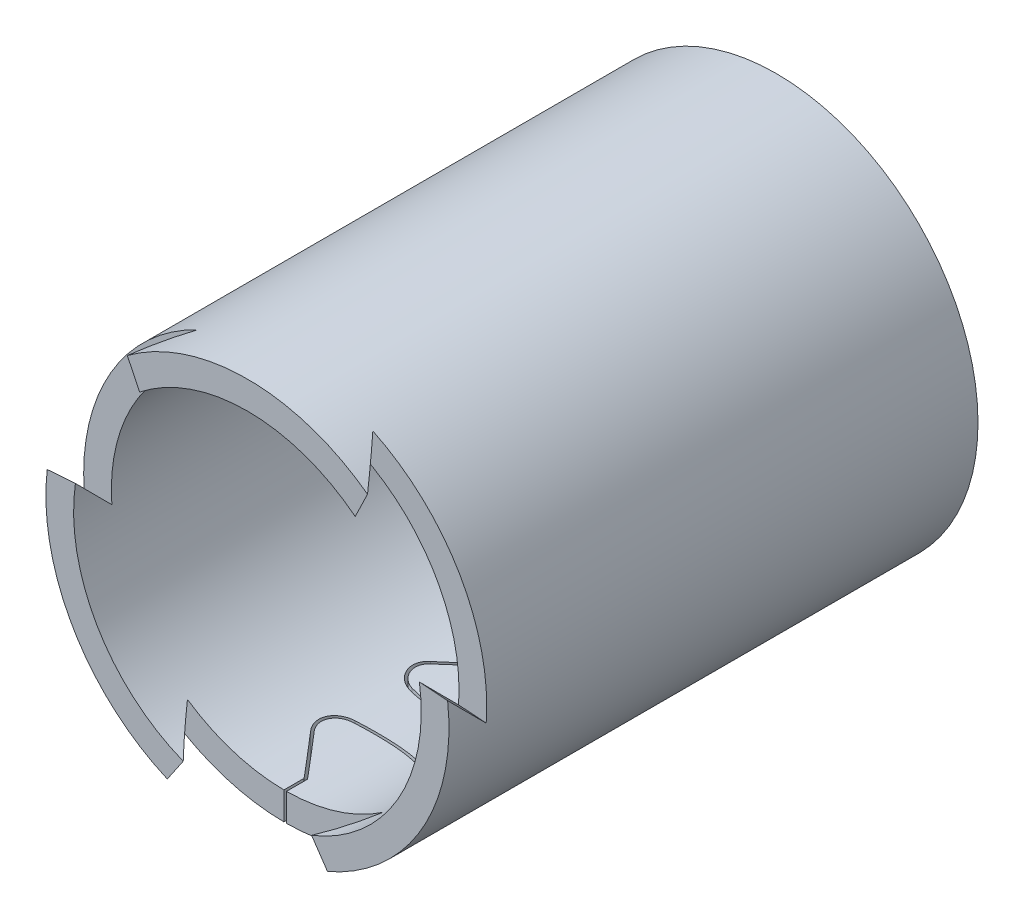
ISO-10303-21;
HEADER;
FILE_DESCRIPTION(('STEP AP214'),'2;1');
FILE_NAME('part.step','',(''),(''),'','','');
FILE_SCHEMA(('AUTOMOTIVE_DESIGN { 1 0 10303 214 1 1 1 1 }'));
ENDSEC;
DATA;
#1=APPLICATION_CONTEXT('core data for automotive mechanical design processes');
#2=APPLICATION_PROTOCOL_DEFINITION('international standard','automotive_design',2000,#1);
#3=PRODUCT_CONTEXT('',#1,'mechanical');
#4=PRODUCT('Part','Part','',(#3));
#5=PRODUCT_RELATED_PRODUCT_CATEGORY('part','',(#4));
#6=PRODUCT_DEFINITION_FORMATION('','',#4);
#7=PRODUCT_DEFINITION_CONTEXT('part definition',#1,'design');
#8=PRODUCT_DEFINITION('design','',#6,#7);
#9=PRODUCT_DEFINITION_SHAPE('','',#8);
#10=(LENGTH_UNIT() NAMED_UNIT(*) SI_UNIT(.MILLI.,.METRE.));
#11=(NAMED_UNIT(*) PLANE_ANGLE_UNIT() SI_UNIT($,.RADIAN.));
#12=(NAMED_UNIT(*) SI_UNIT($,.STERADIAN.) SOLID_ANGLE_UNIT());
#13=UNCERTAINTY_MEASURE_WITH_UNIT(LENGTH_MEASURE(1.E-05),#10,'distance_accuracy_value','');
#14=(GEOMETRIC_REPRESENTATION_CONTEXT(3) GLOBAL_UNCERTAINTY_ASSIGNED_CONTEXT((#13)) GLOBAL_UNIT_ASSIGNED_CONTEXT((#10,
#11,#12)) REPRESENTATION_CONTEXT('',''));
#15=CARTESIAN_POINT('',(0.,0.,0.));
#16=DIRECTION('',(0.,0.,1.));
#17=DIRECTION('',(1.,0.,0.));
#18=AXIS2_PLACEMENT_3D('',#15,#16,#17);
#19=CARTESIAN_POINT('',(-8.032710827,-7.390878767,10.5));
#20=DIRECTION('',(0.,0.,1.));
#21=DIRECTION('',(1.,0.,0.));
#22=AXIS2_PLACEMENT_3D('',#19,#20,#21);
#23=PLANE('',#22);
#24=DIRECTION('',(-0.997277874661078,-0.0737349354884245,0.));
#25=VECTOR('',#24,1.);
#26=CARTESIAN_POINT('',(-6.82725223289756,0.999313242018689,10.5));
#27=LINE('',#26,#25);
#28=CARTESIAN_POINT('',(-6.82725223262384,0.999313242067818,10.5));
#29=VERTEX_POINT('',#28);
#30=CARTESIAN_POINT('',(-7.9473284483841,0.916499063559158,10.5000000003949));
#31=VERTEX_POINT('',#30);
#32=EDGE_CURVE('E281',#29,#31,#27,.T.);
#33=ORIENTED_EDGE('',*,*,#32,.T.);
#34=CARTESIAN_POINT('',(0.,0.,10.5));
#35=DIRECTION('',(0.,0.,-1.));
#36=DIRECTION('',(-1.,0.,0.));
#37=AXIS2_PLACEMENT_3D('',#34,#35,#36);
#38=CIRCLE('',#37,8.);
#39=CARTESIAN_POINT('',(-3.17995275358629,-7.34083785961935,10.5));
#40=VERTEX_POINT('',#39);
#41=EDGE_CURVE('E284',#31,#40,#38,.F.);
#42=ORIENTED_EDGE('',*,*,#41,.T.);
#43=DIRECTION('',(0.562495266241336,0.826800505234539,0.));
#44=VECTOR('',#43,1.);
#45=CARTESIAN_POINT('',(-3.17995275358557,-7.34083785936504,10.5));
#46=LINE('',#45,#44);
#47=CARTESIAN_POINT('',(-2.54819546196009,-6.41223049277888,10.5));
#48=VERTEX_POINT('',#47);
#49=EDGE_CURVE('E21',#40,#48,#46,.T.);
#50=ORIENTED_EDGE('',*,*,#49,.T.);
#51=CARTESIAN_POINT('',(0.,0.,10.5));
#52=DIRECTION('',(0.,0.,-1.));
#53=DIRECTION('',(-1.,0.,0.));
#54=AXIS2_PLACEMENT_3D('',#51,#52,#53);
#55=CIRCLE('',#54,6.9);
#56=EDGE_CURVE('E270',#29,#48,#55,.F.);
#57=ORIENTED_EDGE('',*,*,#56,.F.);
#58=EDGE_LOOP('',(#33,#42,#50,#57));
#59=FACE_BOUND('',#58,.T.);
#60=ADVANCED_FACE('F17',(#59),#23,.T.);
#61=CARTESIAN_POINT('',(-4.714716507,-7.350653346,9.236577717));
#62=DIRECTION('',(-0.584636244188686,0.397744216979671,0.707106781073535));
#63=DIRECTION('',(0.770691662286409,0.,0.637208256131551));
#64=AXIS2_PLACEMENT_3D('',#61,#62,#63);
#65=PLANE('',#64);
#66=CARTESIAN_POINT('',(0.,0.,8.99999999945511));
#67=DIRECTION('',(-0.584636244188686,0.397744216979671,0.707106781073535));
#68=DIRECTION('',(-0.584636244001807,0.397744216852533,-0.70710678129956));
#69=AXIS2_PLACEMENT_3D('',#66,#67,#68);
#70=ELLIPSE('',#69,9.75807358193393,6.9);
#71=CARTESIAN_POINT('',(-3.8812173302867,-5.70492349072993,9.0000000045));
#72=VERTEX_POINT('',#71);
#73=EDGE_CURVE('E283',#48,#72,#70,.F.);
#74=ORIENTED_EDGE('',*,*,#73,.F.);
#75=ORIENTED_EDGE('',*,*,#49,.F.);
#76=CARTESIAN_POINT('',(0.,0.,8.99999999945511));
#77=DIRECTION('',(-0.584636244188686,0.397744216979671,0.707106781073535));
#78=DIRECTION('',(-0.584636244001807,0.397744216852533,-0.70710678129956));
#79=AXIS2_PLACEMENT_3D('',#76,#77,#78);
#80=ELLIPSE('',#79,11.313708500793,8.);
#81=CARTESIAN_POINT('',(-4.49996212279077,-6.61440404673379,9.0000000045));
#82=VERTEX_POINT('',#81);
#83=EDGE_CURVE('E655',#40,#82,#80,.F.);
#84=ORIENTED_EDGE('',*,*,#83,.T.);
#85=DIRECTION('',(-0.562495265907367,-0.826800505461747,0.));
#86=VECTOR('',#85,1.);
#87=CARTESIAN_POINT('',(-3.88121733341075,-5.70492348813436,9.));
#88=LINE('',#87,#86);
#89=EDGE_CURVE('E296',#72,#82,#88,.T.);
#90=ORIENTED_EDGE('',*,*,#89,.F.);
#91=EDGE_LOOP('',(#74,#75,#84,#90));
#92=FACE_BOUND('',#91,.T.);
#93=ADVANCED_FACE('F775',(#92),#65,.F.);
#94=CARTESIAN_POINT('',(-4.5266619,-8.01361327,9.));
#95=DIRECTION('',(0.,0.,1.));
#96=DIRECTION('',(1.,0.,0.));
#97=AXIS2_PLACEMENT_3D('',#94,#95,#96);
#98=PLANE('',#97);
#99=ORIENTED_EDGE('',*,*,#89,.T.);
#100=CARTESIAN_POINT('',(0.,0.,9.000000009));
#101=DIRECTION('',(0.,0.,-1.));
#102=DIRECTION('',(-1.,0.,0.));
#103=AXIS2_PLACEMENT_3D('',#100,#101,#102);
#104=CIRCLE('',#103,8.);
#105=CARTESIAN_POINT('',(-0.0499999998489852,-7.99984374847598,9.0000000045));
#106=VERTEX_POINT('',#105);
#107=EDGE_CURVE('E323',#82,#106,#104,.F.);
#108=ORIENTED_EDGE('',*,*,#107,.T.);
#109=DIRECTION('',(0.,1.,0.));
#110=VECTOR('',#109,1.);
#111=CARTESIAN_POINT('',(-0.05,-7.449831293,9.));
#112=LINE('',#111,#110);
#113=CARTESIAN_POINT('',(-0.0500000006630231,-6.89981883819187,9.0000000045));
#114=VERTEX_POINT('',#113);
#115=EDGE_CURVE('E297',#106,#114,#112,.T.);
#116=ORIENTED_EDGE('',*,*,#115,.T.);
#117=CARTESIAN_POINT('',(0.,0.,9.000000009));
#118=DIRECTION('',(0.,0.,-1.));
#119=DIRECTION('',(-1.,0.,0.));
#120=AXIS2_PLACEMENT_3D('',#117,#118,#119);
#121=CIRCLE('',#120,6.9);
#122=EDGE_CURVE('E722',#72,#114,#121,.F.);
#123=ORIENTED_EDGE('',*,*,#122,.F.);
#124=EDGE_LOOP('',(#99,#108,#116,#123));
#125=FACE_BOUND('',#124,.T.);
#126=ADVANCED_FACE('F773',(#125),#98,.T.);
#127=CARTESIAN_POINT('',(-0.05,-7.999843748,8.2));
#128=DIRECTION('',(-1.,0.,0.));
#129=DIRECTION('',(0.,0.,1.));
#130=AXIS2_PLACEMENT_3D('',#127,#128,#129);
#131=PLANE('',#130);
#132=ORIENTED_EDGE('',*,*,#115,.F.);
#133=DIRECTION('',(0.,0.,1.));
#134=VECTOR('',#133,1.);
#135=CARTESIAN_POINT('',(-0.0499999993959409,-7.99984374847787,0.));
#136=LINE('',#135,#134);
#137=CARTESIAN_POINT('',(-0.0499999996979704,-7.99984374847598,8.20000000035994));
#138=VERTEX_POINT('',#137);
#139=EDGE_CURVE('E319',#106,#138,#136,.F.);
#140=ORIENTED_EDGE('',*,*,#139,.T.);
#141=DIRECTION('',(0.,1.,0.));
#142=VECTOR('',#141,1.);
#143=CARTESIAN_POINT('',(-0.05,-7.376824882,8.2));
#144=LINE('',#143,#142);
#145=CARTESIAN_POINT('',(-0.0500000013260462,-6.89981883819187,8.19999999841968));
#146=VERTEX_POINT('',#145);
#147=EDGE_CURVE('E304',#138,#146,#144,.T.);
#148=ORIENTED_EDGE('',*,*,#147,.T.);
#149=DIRECTION('',(0.,0.,1.));
#150=VECTOR('',#149,1.);
#151=CARTESIAN_POINT('',(-0.0500000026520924,-6.89981883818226,0.));
#152=LINE('',#151,#150);
#153=EDGE_CURVE('E312',#114,#146,#152,.F.);
#154=ORIENTED_EDGE('',*,*,#153,.F.);
#155=EDGE_LOOP('',(#132,#140,#148,#154));
#156=FACE_BOUND('',#155,.T.);
#157=ADVANCED_FACE('F771',(#156),#131,.F.);
#158=CARTESIAN_POINT('',(-1.412835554,-8.007319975,6.575835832));
#159=DIRECTION('',(-0.766044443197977,0.,0.642787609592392));
#160=DIRECTION('',(0.642787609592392,0.,0.766044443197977));
#161=AXIS2_PLACEMENT_3D('',#158,#159,#160);
#162=PLANE('',#161);
#163=ORIENTED_EDGE('',*,*,#147,.F.);
#164=CARTESIAN_POINT('',(0.,0.,8.25958767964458));
#165=DIRECTION('',(-0.766044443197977,0.,0.642787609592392));
#166=DIRECTION('',(-0.642787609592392,0.,-0.766044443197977));
#167=AXIS2_PLACEMENT_3D('',#164,#165,#166);
#168=ELLIPSE('',#167,12.4457906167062,8.);
#169=CARTESIAN_POINT('',(-1.41283555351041,-7.87425524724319,6.57583583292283));
#170=VERTEX_POINT('',#169);
#171=EDGE_CURVE('E322',#138,#170,#168,.F.);
#172=ORIENTED_EDGE('',*,*,#171,.T.);
#173=DIRECTION('',(0.,1.,0.));
#174=VECTOR('',#173,1.);
#175=CARTESIAN_POINT('',(-1.41283555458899,-7.32713821,6.57583583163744));
#176=LINE('',#175,#174);
#177=CARTESIAN_POINT('',(-1.41283555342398,-6.75380601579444,6.57583583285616));
#178=VERTEX_POINT('',#177);
#179=EDGE_CURVE('E308',#178,#170,#176,.F.);
#180=ORIENTED_EDGE('',*,*,#179,.F.);
#181=CARTESIAN_POINT('',(0.,0.,8.25958767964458));
#182=DIRECTION('',(-0.766044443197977,0.,0.642787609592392));
#183=DIRECTION('',(-0.642787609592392,0.,-0.766044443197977));
#184=AXIS2_PLACEMENT_3D('',#181,#182,#183);
#185=ELLIPSE('',#184,10.7344944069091,6.9);
#186=EDGE_CURVE('E717',#146,#178,#185,.F.);
#187=ORIENTED_EDGE('',*,*,#186,.F.);
#188=EDGE_LOOP('',(#163,#172,#180,#187));
#189=FACE_BOUND('',#188,.T.);
#190=ADVANCED_FACE('F769',(#189),#162,.F.);
#191=CARTESIAN_POINT('',(-0.8,-7.949863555,6.061605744));
#192=DIRECTION('',(0.,1.,0.));
#193=DIRECTION('',(-1.,0.,0.));
#194=AXIS2_PLACEMENT_3D('',#191,#192,#193);
#195=CYLINDRICAL_SURFACE('',#194,0.799999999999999);
#196=CARTESIAN_POINT('',(-1.4128355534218,-7.8742552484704,6.57583583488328));
#197=CARTESIAN_POINT('',(-1.44144806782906,-7.86911725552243,6.54179474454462));
#198=CARTESIAN_POINT('',(-1.46719259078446,-7.86434066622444,6.50529013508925));
#199=CARTESIAN_POINT('',(-1.51232148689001,-7.85578960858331,6.42844026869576));
#200=CARTESIAN_POINT('',(-1.5317065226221,-7.85201503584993,6.38809541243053));
#201=CARTESIAN_POINT('',(-1.56351340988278,-7.84574319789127,6.30460476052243));
#202=CARTESIAN_POINT('',(-1.57592871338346,-7.84324713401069,6.26145637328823));
#203=CARTESIAN_POINT('',(-1.59337666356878,-7.83972144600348,6.17365355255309));
#204=CARTESIAN_POINT('',(-1.59841283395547,-7.83869112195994,6.12899984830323));
#205=CARTESIAN_POINT('',(-1.6009321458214,-7.83817692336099,6.03999261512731));
#206=CARTESIAN_POINT('',(-1.59850252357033,-7.83867518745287,5.99564164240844));
#207=CARTESIAN_POINT('',(-1.58635754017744,-7.84114197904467,5.90798255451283));
#208=CARTESIAN_POINT('',(-1.57664067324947,-7.84311081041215,5.86467465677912));
#209=CARTESIAN_POINT('',(-1.55025680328,-7.84836815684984,5.7804321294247));
#210=CARTESIAN_POINT('',(-1.53360633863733,-7.85165353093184,5.73949211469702));
#211=CARTESIAN_POINT('',(-1.4938609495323,-7.85931212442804,5.6609904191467));
#212=CARTESIAN_POINT('',(-1.47076659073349,-7.86368524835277,5.62342844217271));
#213=CARTESIAN_POINT('',(-1.41842472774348,-7.87329583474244,5.55216174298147));
#214=CARTESIAN_POINT('',(-1.38909475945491,-7.87854465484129,5.51851914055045));
#215=CARTESIAN_POINT('',(-1.32529025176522,-7.88952796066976,5.4565869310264));
#216=CARTESIAN_POINT('',(-1.29081280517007,-7.89526272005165,5.42830036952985));
#217=CARTESIAN_POINT('',(-1.21703617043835,-7.90697427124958,5.37740936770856));
#218=CARTESIAN_POINT('',(-1.1776642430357,-7.91295352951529,5.35491103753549));
#219=CARTESIAN_POINT('',(-1.09572489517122,-7.92471365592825,5.31690557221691));
#220=CARTESIAN_POINT('',(-1.05316399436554,-7.93049489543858,5.3013846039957));
#221=CARTESIAN_POINT('',(-0.992421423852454,-7.93822457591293,5.28488527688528));
#222=CARTESIAN_POINT('',(-0.975073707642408,-7.94037519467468,5.28079048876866));
#223=CARTESIAN_POINT('',(-0.957611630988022,-7.94247945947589,5.27728529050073));
#224=B_SPLINE_CURVE_WITH_KNOTS('',3,(#196,#197,#198,#199,#200,#201,#202,#203,#204,#205,#206,
#207,#208,#209,#210,#211,#212,#213,#214,#215,#216,#217,#218,#219,#220,#221,#222,#223),
.UNSPECIFIED.,.F.,.F.,(4,2,2,2,2,2,2,2,2,2,2,2,2,4),(0.,0.134139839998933,0.268265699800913,
0.402517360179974,0.536704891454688,0.669330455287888,0.801983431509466,0.934321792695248,
1.06664854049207,1.20084821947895,1.3351239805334,1.47170947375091,1.60802297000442,
1.66184150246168),.UNSPECIFIED.);
#225=CARTESIAN_POINT('',(-0.957611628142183,-7.94247945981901,5.27728529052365));
#226=VERTEX_POINT('',#225);
#227=EDGE_CURVE('E646',#170,#226,#224,.T.);
#228=ORIENTED_EDGE('',*,*,#227,.T.);
#229=DIRECTION('',(0.,1.,0.));
#230=VECTOR('',#229,1.);
#231=CARTESIAN_POINT('',(-0.957611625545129,-7.332877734,5.27728529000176));
#232=LINE('',#231,#230);
#233=CARTESIAN_POINT('',(-0.957611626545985,-6.83322617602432,5.27728528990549));
#234=VERTEX_POINT('',#233);
#235=EDGE_CURVE('E760',#234,#226,#232,.F.);
#236=ORIENTED_EDGE('',*,*,#235,.F.);
#237=CARTESIAN_POINT('',(-1.41283555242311,-6.75380601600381,6.57583583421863));
#238=CARTESIAN_POINT('',(-1.44132915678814,-6.74784082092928,6.54193576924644));
#239=CARTESIAN_POINT('',(-1.46699068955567,-6.74228831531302,6.50557822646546));
#240=CARTESIAN_POINT('',(-1.51202079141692,-6.73233563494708,6.42900699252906));
#241=CARTESIAN_POINT('',(-1.53138855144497,-6.72793560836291,6.38879280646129));
#242=CARTESIAN_POINT('',(-1.5632122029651,-6.72061249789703,6.30553040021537));
#243=CARTESIAN_POINT('',(-1.57566043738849,-6.71769105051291,6.26247909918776));
#244=CARTESIAN_POINT('',(-1.59320277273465,-6.71355259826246,6.17484738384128));
#245=CARTESIAN_POINT('',(-1.59830114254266,-6.71233460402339,6.13026787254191));
#246=CARTESIAN_POINT('',(-1.60095973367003,-6.71170092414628,6.04157622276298));
#247=CARTESIAN_POINT('',(-1.59863734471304,-6.71225717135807,5.99746777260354));
#248=CARTESIAN_POINT('',(-1.5867881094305,-6.71506812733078,5.91027648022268));
#249=CARTESIAN_POINT('',(-1.57725965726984,-6.71732321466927,5.86719386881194));
#250=CARTESIAN_POINT('',(-1.55135077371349,-6.72335373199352,5.78341824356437));
#251=CARTESIAN_POINT('',(-1.53499355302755,-6.72712401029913,5.74271766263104));
#252=CARTESIAN_POINT('',(-1.49593458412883,-6.73591705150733,5.66464142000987));
#253=CARTESIAN_POINT('',(-1.47323325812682,-6.74093973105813,5.62726553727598));
#254=CARTESIAN_POINT('',(-1.42164834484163,-6.75200882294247,5.55611494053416));
#255=CARTESIAN_POINT('',(-1.39265504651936,-6.75807294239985,5.5224225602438));
#256=CARTESIAN_POINT('',(-1.32954898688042,-6.77077051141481,5.46032493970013));
#257=CARTESIAN_POINT('',(-1.29543325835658,-6.77740428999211,5.43192278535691));
#258=CARTESIAN_POINT('',(-1.22217355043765,-6.79100227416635,5.3805641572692));
#259=CARTESIAN_POINT('',(-1.18293177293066,-6.79797057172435,5.35774834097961));
#260=CARTESIAN_POINT('',(-1.10118649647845,-6.81168790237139,5.31909451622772));
#261=CARTESIAN_POINT('',(-1.05868937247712,-6.81843732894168,5.30324325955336));
#262=CARTESIAN_POINT('',(-0.996157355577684,-6.82774127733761,5.28577365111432));
#263=CARTESIAN_POINT('',(-0.976956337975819,-6.83051685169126,5.28116793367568));
#264=CARTESIAN_POINT('',(-0.95761162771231,-6.83322617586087,5.27728528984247));
#265=B_SPLINE_CURVE_WITH_KNOTS('',3,(#237,#238,#239,#240,#241,#242,#243,#244,#245,#246,#247,
#248,#249,#250,#251,#252,#253,#254,#255,#256,#257,#258,#259,#260,#261,#262,#263,#264),
.UNSPECIFIED.,.F.,.F.,(4,2,2,2,2,2,2,2,2,2,2,2,2,4),(0.,0.133907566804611,0.267832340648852,
0.401905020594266,0.535899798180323,0.667785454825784,0.799700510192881,0.931170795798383,
1.06263233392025,1.19660259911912,1.3306507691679,1.46778963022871,1.60466647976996,
1.66442864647),.UNSPECIFIED.);
#266=EDGE_CURVE('E460',#178,#234,#265,.T.);
#267=ORIENTED_EDGE('',*,*,#266,.F.);
#268=ORIENTED_EDGE('',*,*,#179,.T.);
#269=EDGE_LOOP('',(#228,#236,#267,#268));
#270=FACE_BOUND('',#269,.T.);
#271=ADVANCED_FACE('F636',(#270),#195,.F.);
#272=CARTESIAN_POINT('',(-0.05,-8.00955196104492,9.793819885));
#273=DIRECTION('',(0.,1.,0.));
#274=DIRECTION('',(0.,0.,1.));
#275=AXIS2_PLACEMENT_3D('',#272,#273,#274);
#276=CYLINDRICAL_SURFACE('',#275,4.606825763);
#277=CARTESIAN_POINT('',(-0.957611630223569,-7.94247945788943,5.27728529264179));
#278=CARTESIAN_POINT('',(-0.844680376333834,-7.95611691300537,5.25457116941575));
#279=CARTESIAN_POINT('',(-0.730606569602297,-7.96740619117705,5.23607417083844));
#280=CARTESIAN_POINT('',(-0.501022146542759,-7.98511996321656,5.20767195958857));
#281=CARTESIAN_POINT('',(-0.385511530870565,-7.99154445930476,5.19776674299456));
#282=CARTESIAN_POINT('',(-0.157200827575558,-7.99924891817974,5.18686317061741));
#283=CARTESIAN_POINT('',(-0.0444172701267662,-8.00067022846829,5.18561910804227));
#284=CARTESIAN_POINT('',(0.180883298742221,-7.99874779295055,5.19140405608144));
#285=CARTESIAN_POINT('',(0.293400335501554,-7.99540451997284,5.19843224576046));
#286=CARTESIAN_POINT('',(0.524450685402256,-7.98368085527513,5.22138476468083));
#287=CARTESIAN_POINT('',(0.642915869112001,-7.97499606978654,5.23784221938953));
#288=CARTESIAN_POINT('',(0.877775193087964,-7.95257432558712,5.27980665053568));
#289=CARTESIAN_POINT('',(0.994168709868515,-7.93883587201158,5.30531630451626));
#290=CARTESIAN_POINT('',(1.22761488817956,-7.90615354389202,5.3660064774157));
#291=CARTESIAN_POINT('',(1.34457418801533,-7.88706022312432,5.40146465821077));
#292=CARTESIAN_POINT('',(1.57453693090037,-7.84439839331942,5.48121431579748));
#293=CARTESIAN_POINT('',(1.68754233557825,-7.82083214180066,5.52550133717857));
#294=CARTESIAN_POINT('',(1.79821436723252,-7.79528223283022,5.57399201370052));
#295=B_SPLINE_CURVE_WITH_KNOTS('',3,(#277,#278,#279,#280,#281,#282,#283,#284,#285,#286,#287,
#288,#289,#290,#291,#292,#293,#294),.UNSPECIFIED.,.F.,.F.,(4,2,2,2,2,2,2,2,4),(0.,
0.347904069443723,0.695807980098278,1.03380051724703,1.37175951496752,1.73103370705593,
2.09041425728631,2.46104143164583,2.83148204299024),.UNSPECIFIED.);
#296=CARTESIAN_POINT('',(1.79821436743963,-7.79528223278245,5.57399201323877));
#297=VERTEX_POINT('',#296);
#298=EDGE_CURVE('E640',#226,#297,#295,.T.);
#299=ORIENTED_EDGE('',*,*,#298,.T.);
#300=DIRECTION('',(0.,-1.,0.));
#301=VECTOR('',#300,1.);
#302=CARTESIAN_POINT('',(1.7982143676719,-7.132219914,5.5739920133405));
#303=LINE('',#302,#301);
#304=CARTESIAN_POINT('',(1.79821436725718,-6.66156326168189,5.57399201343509));
#305=VERTEX_POINT('',#304);
#306=EDGE_CURVE('E758',#297,#305,#303,.F.);
#307=ORIENTED_EDGE('',*,*,#306,.T.);
#308=CARTESIAN_POINT('',(-0.957611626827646,-6.83322617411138,5.27728529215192));
#309=CARTESIAN_POINT('',(-0.850459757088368,-6.84826309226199,5.25573347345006));
#310=CARTESIAN_POINT('',(-0.742191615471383,-6.86084597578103,5.23796277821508));
#311=CARTESIAN_POINT('',(-0.524193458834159,-6.88092497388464,5.21015182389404));
#312=CARTESIAN_POINT('',(-0.414463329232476,-6.88842068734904,5.20011217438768));
#313=CARTESIAN_POINT('',(-0.194505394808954,-6.89813642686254,5.18794470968));
#314=CARTESIAN_POINT('',(-0.084278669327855,-6.90036488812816,5.1858042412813));
#315=CARTESIAN_POINT('',(0.136010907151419,-6.89953814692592,5.18943346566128));
#316=CARTESIAN_POINT('',(0.246073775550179,-6.89648355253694,5.19520224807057));
#317=CARTESIAN_POINT('',(0.465304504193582,-6.88516877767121,5.21458157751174));
#318=CARTESIAN_POINT('',(0.574471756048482,-6.87690531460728,5.22819706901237));
#319=CARTESIAN_POINT('',(0.791123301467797,-6.85536143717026,5.26310247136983));
#320=CARTESIAN_POINT('',(0.898606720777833,-6.84207850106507,5.28439623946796));
#321=CARTESIAN_POINT('',(1.11091939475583,-6.81082612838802,5.33433757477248));
#322=CARTESIAN_POINT('',(1.21575340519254,-6.79286585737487,5.36297075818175));
#323=CARTESIAN_POINT('',(1.42237788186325,-6.75262281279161,5.42728238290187));
#324=CARTESIAN_POINT('',(1.52416882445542,-6.73034071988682,5.46295971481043));
#325=CARTESIAN_POINT('',(1.65349482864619,-6.69901994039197,5.51340610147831));
#326=CARTESIAN_POINT('',(1.68267863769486,-6.69174799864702,5.52513672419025));
#327=CARTESIAN_POINT('',(1.74069967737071,-6.6768899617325,5.54915002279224));
#328=CARTESIAN_POINT('',(1.76953723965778,-6.66930420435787,5.56143210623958));
#329=CARTESIAN_POINT('',(1.79821436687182,-6.66156326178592,5.57399201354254));
#330=B_SPLINE_CURVE_WITH_KNOTS('',3,(#308,#309,#310,#311,#312,#313,#314,#315,#316,#317,#318,
#319,#320,#321,#322,#323,#324,#325,#326,#327,#328,#329),.UNSPECIFIED.,.F.,.F.,(4,2,2,2,2,2,2,2,
2,2,4),(0.,0.330902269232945,0.661830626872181,0.992228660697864,1.32258866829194,
1.65315707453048,1.98389177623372,2.31398319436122,2.64402266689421,2.7408661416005,
2.83760795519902),.UNSPECIFIED.);
#331=EDGE_CURVE('E453',#234,#305,#330,.T.);
#332=ORIENTED_EDGE('',*,*,#331,.F.);
#333=ORIENTED_EDGE('',*,*,#235,.T.);
#334=EDGE_LOOP('',(#299,#307,#332,#333));
#335=FACE_BOUND('',#334,.T.);
#336=ADVANCED_FACE('F631',(#335),#276,.F.);
#337=CARTESIAN_POINT('',(2.4,-7.80323898,4.2));
#338=DIRECTION('',(0.,1.,0.));
#339=DIRECTION('',(-1.,0.,0.));
#340=AXIS2_PLACEMENT_3D('',#337,#338,#339);
#341=CYLINDRICAL_SURFACE('',#340,1.5);
#342=CARTESIAN_POINT('',(1.79821436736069,-7.7952822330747,5.57399201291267));
#343=CARTESIAN_POINT('',(1.83773265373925,-7.78616714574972,5.59129841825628));
#344=CARTESIAN_POINT('',(1.87787621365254,-7.77658863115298,5.60684876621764));
#345=CARTESIAN_POINT('',(1.959150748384,-7.7565122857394,5.63439795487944));
#346=CARTESIAN_POINT('',(2.00028193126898,-7.74601425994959,5.64639603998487));
#347=CARTESIAN_POINT('',(2.12395223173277,-7.7133653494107,5.67680008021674));
#348=CARTESIAN_POINT('',(2.20752561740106,-7.68988678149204,5.68994397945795));
#349=CARTESIAN_POINT('',(2.327373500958,-7.65407086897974,5.69868830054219));
#350=CARTESIAN_POINT('',(2.36371730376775,-7.6429257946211,5.70000354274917));
#351=CARTESIAN_POINT('',(2.48956164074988,-7.60334332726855,5.69999125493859));
#352=CARTESIAN_POINT('',(2.5787509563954,-7.57354549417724,5.69194689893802));
#353=CARTESIAN_POINT('',(2.75370066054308,-7.51171088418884,5.66042425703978));
#354=CARTESIAN_POINT('',(2.83945190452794,-7.47966868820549,5.63690737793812));
#355=CARTESIAN_POINT('',(3.00500126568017,-7.41470498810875,5.57540797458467));
#356=CARTESIAN_POINT('',(3.08481240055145,-7.38178563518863,5.53745826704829));
#357=CARTESIAN_POINT('',(3.23669168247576,-7.31646548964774,5.44808332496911));
#358=CARTESIAN_POINT('',(3.30876228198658,-7.28406453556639,5.39666237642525));
#359=CARTESIAN_POINT('',(3.44456077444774,-7.22085289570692,5.28029430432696));
#360=CARTESIAN_POINT('',(3.50810737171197,-7.19008329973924,5.21511213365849));
#361=CARTESIAN_POINT('',(3.62309228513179,-7.13283509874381,5.07314318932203));
#362=CARTESIAN_POINT('',(3.67453346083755,-7.10635548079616,4.99635916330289));
#363=CARTESIAN_POINT('',(3.76022192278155,-7.06136913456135,4.83824835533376));
#364=CARTESIAN_POINT('',(3.79535102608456,-7.04246401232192,4.7575162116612));
#365=CARTESIAN_POINT('',(3.85112201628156,-7.01212420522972,4.5898967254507));
#366=CARTESIAN_POINT('',(3.8717814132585,-7.00068049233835,4.50301696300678));
#367=CARTESIAN_POINT('',(3.89579284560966,-6.98734275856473,4.33700276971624));
#368=CARTESIAN_POINT('',(3.90093703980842,-6.98446052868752,4.25820363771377));
#369=CARTESIAN_POINT('',(3.89878337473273,-6.98566335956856,4.10083981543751));
#370=CARTESIAN_POINT('',(3.89148936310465,-6.98974626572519,4.02227506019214));
#371=CARTESIAN_POINT('',(3.86567745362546,-7.00405111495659,3.87256573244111));
#372=CARTESIAN_POINT('',(3.84786481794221,-7.01388696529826,3.80125972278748));
#373=CARTESIAN_POINT('',(3.80240180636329,-7.03863667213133,3.66280215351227));
#374=CARTESIAN_POINT('',(3.774749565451,-7.05355149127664,3.59565138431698));
#375=CARTESIAN_POINT('',(3.70884906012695,-7.08843404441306,3.46333626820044));
#376=CARTESIAN_POINT('',(3.67010341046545,-7.10863378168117,3.39848214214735));
#377=CARTESIAN_POINT('',(3.58402358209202,-7.15241953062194,3.27604380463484));
#378=CARTESIAN_POINT('',(3.536686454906,-7.17600670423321,3.21846210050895));
#379=CARTESIAN_POINT('',(3.42880899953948,-7.22822575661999,3.10531546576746));
#380=CARTESIAN_POINT('',(3.36737990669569,-7.25712635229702,3.0507212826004));
#381=CARTESIAN_POINT('',(3.23684173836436,-7.31628287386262,2.95245075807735));
#382=CARTESIAN_POINT('',(3.16772519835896,-7.34654009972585,2.90878516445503));
#383=CARTESIAN_POINT('',(3.01701201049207,-7.40978301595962,2.82990798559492));
#384=CARTESIAN_POINT('',(2.93485243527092,-7.44277514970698,2.79577444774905));
#385=CARTESIAN_POINT('',(2.76544353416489,-7.50736284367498,2.74250102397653));
#386=CARTESIAN_POINT('',(2.67820629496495,-7.53896142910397,2.72332698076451));
#387=CARTESIAN_POINT('',(2.55831498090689,-7.57998235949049,2.7080425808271));
#388=CARTESIAN_POINT('',(2.52682284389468,-7.59053845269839,2.7050352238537));
#389=CARTESIAN_POINT('',(2.46357930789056,-7.6112998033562,2.70101303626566));
#390=CARTESIAN_POINT('',(2.43182779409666,-7.62150489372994,2.69999914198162));
#391=CARTESIAN_POINT('',(2.31631451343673,-7.65782974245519,2.70000225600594));
#392=CARTESIAN_POINT('',(2.23210168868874,-7.68278827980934,2.70701982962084));
#393=CARTESIAN_POINT('',(2.06515523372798,-7.7293362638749,2.7354052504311));
#394=CARTESIAN_POINT('',(1.98242115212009,-7.75092675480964,2.75676863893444));
#395=CARTESIAN_POINT('',(1.8843362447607,-7.77493451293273,2.79129944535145));
#396=CARTESIAN_POINT('',(1.8669405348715,-7.77912920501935,2.79778955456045));
#397=CARTESIAN_POINT('',(1.83239618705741,-7.78733821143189,2.81141479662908));
#398=CARTESIAN_POINT('',(1.8152471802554,-7.79135281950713,2.81854881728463));
#399=CARTESIAN_POINT('',(1.79821436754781,-7.79528223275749,2.82600798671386));
#400=B_SPLINE_CURVE_WITH_KNOTS('',3,(#342,#343,#344,#345,#346,#347,#348,#349,#350,#351,#352,
#353,#354,#355,#356,#357,#358,#359,#360,#361,#362,#363,#364,#365,#366,#367,#368,#369,#370,#371,
#372,#373,#374,#375,#376,#377,#378,#379,#380,#381,#382,#383,#384,#385,#386,#387,#388,#389,#390,
#391,#392,#393,#394,#395,#396,#397,#398,#399),.UNSPECIFIED.,.F.,.F.,(4,2,2,2,2,2,2,2,2,2,2,2,2,
2,2,2,2,2,2,2,2,2,2,2,2,2,2,2,4),(0.,0.132176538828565,0.264381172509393,0.526291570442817,
0.640356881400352,0.921920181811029,1.2041884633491,1.48581873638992,1.76735951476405,
2.05416726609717,2.34090719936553,2.60950822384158,2.87778364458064,3.11358809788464,
3.34931962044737,3.57079874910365,3.79231987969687,4.02597345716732,4.25970737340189,
4.51997104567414,4.78048967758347,5.06386850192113,5.34659837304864,5.44660128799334,
5.54665116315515,5.80971442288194,6.07269596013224,6.12979319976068,6.1867936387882),.UNSPECIFIED.);
#401=CARTESIAN_POINT('',(1.79821436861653,-7.79528223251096,2.82600798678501));
#402=VERTEX_POINT('',#401);
#403=EDGE_CURVE('E618',#297,#402,#400,.T.);
#404=ORIENTED_EDGE('',*,*,#403,.T.);
#405=DIRECTION('',(0.,1.,0.));
#406=VECTOR('',#405,1.);
#407=CARTESIAN_POINT('',(1.79821436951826,-7.331062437,2.82600798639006));
#408=LINE('',#407,#406);
#409=CARTESIAN_POINT('',(1.79821436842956,-6.66156326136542,2.82600798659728));
#410=VERTEX_POINT('',#409);
#411=EDGE_CURVE('E755',#410,#402,#408,.F.);
#412=ORIENTED_EDGE('',*,*,#411,.F.);
#413=CARTESIAN_POINT('',(1.79821436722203,-6.6615632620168,5.57399201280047));
#414=CARTESIAN_POINT('',(1.83797436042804,-6.65083181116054,5.59140474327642));
#415=CARTESIAN_POINT('',(1.87833326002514,-6.63955330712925,5.60702410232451));
#416=CARTESIAN_POINT('',(1.95996608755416,-6.61591568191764,5.63465354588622));
#417=CARTESIAN_POINT('',(2.00124011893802,-6.60355643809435,5.64666322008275));
#418=CARTESIAN_POINT('',(2.12521019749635,-6.56512553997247,5.67704579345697));
#419=CARTESIAN_POINT('',(2.20881740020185,-6.5374969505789,5.69010192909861));
#420=CARTESIAN_POINT('',(2.32816990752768,-6.49546851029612,5.69871806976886));
#421=CARTESIAN_POINT('',(2.36413061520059,-6.48246701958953,5.70000345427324));
#422=CARTESIAN_POINT('',(2.49157224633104,-6.43517948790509,5.69999118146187));
#423=CARTESIAN_POINT('',(2.58254930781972,-6.39919442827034,5.69158237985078));
#424=CARTESIAN_POINT('',(2.76056003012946,-6.32445217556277,5.65884681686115));
#425=CARTESIAN_POINT('',(2.84758273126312,-6.28568796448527,5.6344783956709));
#426=CARTESIAN_POINT('',(3.01516056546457,-6.20703956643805,5.5709764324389));
#427=CARTESIAN_POINT('',(3.09573458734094,-6.16715914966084,5.53188808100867));
#428=CARTESIAN_POINT('',(3.24886012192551,-6.08788544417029,5.43992590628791));
#429=CARTESIAN_POINT('',(3.32141149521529,-6.04849216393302,5.38705184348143));
#430=CARTESIAN_POINT('',(3.45877343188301,-5.97103769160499,5.26658421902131));
#431=CARTESIAN_POINT('',(3.52327676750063,-5.93305489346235,5.1985874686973));
#432=CARTESIAN_POINT('',(3.63948832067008,-5.86248647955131,5.05001773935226));
#433=CARTESIAN_POINT('',(3.69121482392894,-5.82989317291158,4.96946300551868));
#434=CARTESIAN_POINT('',(3.76822274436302,-5.78031584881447,4.81904956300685));
#435=CARTESIAN_POINT('',(3.79688203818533,-5.76146607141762,4.75152835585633));
#436=CARTESIAN_POINT('',(3.84426950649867,-5.7299569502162,4.61172546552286));
#437=CARTESIAN_POINT('',(3.86300705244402,-5.71729176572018,4.5394483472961));
#438=CARTESIAN_POINT('',(3.88960747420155,-5.69922995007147,4.39165197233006));
#439=CARTESIAN_POINT('',(3.89741935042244,-5.69386740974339,4.31611919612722));
#440=CARTESIAN_POINT('',(3.90149471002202,-5.69107613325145,4.16459300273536));
#441=CARTESIAN_POINT('',(3.8977596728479,-5.69364638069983,4.08859964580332));
#442=CARTESIAN_POINT('',(3.8797159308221,-5.70595341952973,3.94442543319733));
#443=CARTESIAN_POINT('',(3.86623194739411,-5.71513101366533,3.87608961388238));
#444=CARTESIAN_POINT('',(3.83032040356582,-5.73926036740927,3.7428953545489));
#445=CARTESIAN_POINT('',(3.80789089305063,-5.75421338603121,3.67803767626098));
#446=CARTESIAN_POINT('',(3.75354012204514,-5.78982245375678,3.54956588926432));
#447=CARTESIAN_POINT('',(3.72115849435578,-5.81075049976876,3.48622380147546));
#448=CARTESIAN_POINT('',(3.64860408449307,-5.85657993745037,3.36577093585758));
#449=CARTESIAN_POINT('',(3.60842814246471,-5.8814829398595,3.30866269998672));
#450=CARTESIAN_POINT('',(3.51464000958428,-5.93807537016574,3.19305748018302));
#451=CARTESIAN_POINT('',(3.45991230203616,-5.97021998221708,3.13568840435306));
#452=CARTESIAN_POINT('',(3.34282506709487,-6.03655994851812,3.03069501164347));
#453=CARTESIAN_POINT('',(3.28045803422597,-6.07075730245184,2.98308040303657));
#454=CARTESIAN_POINT('',(3.14025651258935,-6.14458254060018,2.89236006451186));
#455=CARTESIAN_POINT('',(3.06147581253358,-6.18430726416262,2.85078913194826));
#456=CARTESIAN_POINT('',(2.89750519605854,-6.26280265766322,2.78212520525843));
#457=CARTESIAN_POINT('',(2.81232429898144,-6.30157457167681,2.75501225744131));
#458=CARTESIAN_POINT('',(2.67209137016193,-6.3618597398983,2.72388901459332));
#459=CARTESIAN_POINT('',(2.61841547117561,-6.38414556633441,2.71498407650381));
#460=CARTESIAN_POINT('',(2.50992176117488,-6.4275739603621,2.70303760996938));
#461=CARTESIAN_POINT('',(2.45510340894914,-6.44871596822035,2.69999892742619));
#462=CARTESIAN_POINT('',(2.31654290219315,-6.50011754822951,2.70000162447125));
#463=CARTESIAN_POINT('',(2.23243192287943,-6.52947091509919,2.70697606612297));
#464=CARTESIAN_POINT('',(2.06539329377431,-6.58421271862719,2.7353524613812));
#465=CARTESIAN_POINT('',(1.98246427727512,-6.60960614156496,2.75673608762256));
#466=CARTESIAN_POINT('',(1.88412286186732,-6.63780201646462,2.79137836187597));
#467=CARTESIAN_POINT('',(1.86678337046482,-6.64269844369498,2.79784996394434));
#468=CARTESIAN_POINT('',(1.83233105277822,-6.65228378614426,2.81144207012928));
#469=CARTESIAN_POINT('',(1.81521795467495,-6.65697296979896,2.81856169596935));
#470=CARTESIAN_POINT('',(1.79821436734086,-6.6615632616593,2.82600798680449));
#471=B_SPLINE_CURVE_WITH_KNOTS('',3,(#413,#414,#415,#416,#417,#418,#419,#420,#421,#422,#423,
#424,#425,#426,#427,#428,#429,#430,#431,#432,#433,#434,#435,#436,#437,#438,#439,#440,#441,#442,
#443,#444,#445,#446,#447,#448,#449,#450,#451,#452,#453,#454,#455,#456,#457,#458,#459,#460,#461,
#462,#463,#464,#465,#466,#467,#468,#469,#470),.UNSPECIFIED.,.F.,.F.,(4,2,2,2,2,2,2,2,2,2,2,2,2,
2,2,2,2,2,2,2,2,2,2,2,2,2,2,2,4),(0.,0.134028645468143,0.26807252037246,0.533624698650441,
0.648363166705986,0.941283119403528,1.23497075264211,1.52776401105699,1.82056235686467,
2.12237854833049,2.42376025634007,2.6500330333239,2.87609170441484,3.10320210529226,
3.33028340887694,3.54011572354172,3.74999380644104,3.97160005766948,4.1932963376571,
4.44896089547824,4.70487868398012,4.99619714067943,5.28711249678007,5.46322060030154,
5.63941411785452,5.90626876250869,6.17278462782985,6.23021096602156,6.28756060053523),.UNSPECIFIED.);
#472=EDGE_CURVE('E446',#305,#410,#471,.T.);
#473=ORIENTED_EDGE('',*,*,#472,.F.);
#474=ORIENTED_EDGE('',*,*,#306,.F.);
#475=EDGE_LOOP('',(#404,#412,#473,#474));
#476=FACE_BOUND('',#475,.T.);
#477=ADVANCED_FACE('F626',(#476),#341,.T.);
#478=CARTESIAN_POINT('',(-0.05,-8.006843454,-1.393819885));
#479=DIRECTION('',(0.,1.,0.));
#480=DIRECTION('',(0.,0.,1.));
#481=AXIS2_PLACEMENT_3D('',#478,#479,#480);
#482=CYLINDRICAL_SURFACE('',#481,4.606825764);
#483=DIRECTION('',(0.,1.,0.));
#484=VECTOR('',#483,1.);
#485=CARTESIAN_POINT('',(-0.957611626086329,-7.32713821,3.12271471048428));
#486=LINE('',#485,#484);
#487=CARTESIAN_POINT('',(-0.957611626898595,-6.83322617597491,3.12271471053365));
#488=VERTEX_POINT('',#487);
#489=CARTESIAN_POINT('',(-0.95761162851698,-7.94247945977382,3.12271470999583));
#490=VERTEX_POINT('',#489);
#491=EDGE_CURVE('E753',#488,#490,#486,.F.);
#492=ORIENTED_EDGE('',*,*,#491,.F.);
#493=CARTESIAN_POINT('',(1.79821436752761,-6.66156326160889,2.82600798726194));
#494=CARTESIAN_POINT('',(1.69779735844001,-6.68868499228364,2.87000225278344));
#495=CARTESIAN_POINT('',(1.59534041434,-6.71389112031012,2.91059122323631));
#496=CARTESIAN_POINT('',(1.38682022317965,-6.76003621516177,2.98460611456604));
#497=CARTESIAN_POINT('',(1.28075343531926,-6.78097084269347,3.01802475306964));
#498=CARTESIAN_POINT('',(1.06613829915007,-6.81800335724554,3.07713320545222));
#499=CARTESIAN_POINT('',(0.957602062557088,-6.83412093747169,3.10285448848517));
#500=CARTESIAN_POINT('',(0.738406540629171,-6.86126349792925,3.14641492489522));
#501=CARTESIAN_POINT('',(0.627748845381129,-6.87229214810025,3.16425975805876));
#502=CARTESIAN_POINT('',(0.422629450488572,-6.88768663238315,3.18967136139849));
#503=CARTESIAN_POINT('',(0.328370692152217,-6.89282977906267,3.19841645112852));
#504=CARTESIAN_POINT('',(0.139413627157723,-6.89923960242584,3.21008402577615));
#505=CARTESIAN_POINT('',(0.04471551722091,-6.9005078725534,3.21300890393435));
#506=CARTESIAN_POINT('',(-0.202547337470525,-6.89870909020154,3.21300100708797));
#507=CARTESIAN_POINT('',(-0.355139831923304,-6.89252212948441,3.20540120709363));
#508=CARTESIAN_POINT('',(-0.582456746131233,-6.87579588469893,3.18277032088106));
#509=CARTESIAN_POINT('',(-0.658085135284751,-6.86896281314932,3.17333102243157));
#510=CARTESIAN_POINT('',(-0.808514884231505,-6.85288416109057,3.15076772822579));
#511=CARTESIAN_POINT('',(-0.883316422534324,-6.8436391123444,3.13764454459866));
#512=CARTESIAN_POINT('',(-0.957611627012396,-6.83322617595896,3.12271471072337));
#513=B_SPLINE_CURVE_WITH_KNOTS('',3,(#493,#494,#495,#496,#497,#498,#499,#500,#501,#502,#503,
#504,#505,#506,#507,#508,#509,#510,#511,#512),.UNSPECIFIED.,.F.,.F.,(4,2,2,2,2,2,2,2,2,4),(0.,
0.338765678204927,0.677873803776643,1.0155759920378,1.35303426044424,1.63718401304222,
1.92121690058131,2.37867583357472,2.60813037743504,2.83753437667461),.UNSPECIFIED.);
#514=EDGE_CURVE('E439',#410,#488,#513,.T.);
#515=ORIENTED_EDGE('',*,*,#514,.F.);
#516=ORIENTED_EDGE('',*,*,#411,.T.);
#517=CARTESIAN_POINT('',(1.7982143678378,-7.79528223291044,2.82600798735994));
#518=CARTESIAN_POINT('',(1.69367283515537,-7.81941360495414,2.87180953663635));
#519=CARTESIAN_POINT('',(1.58705465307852,-7.84177807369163,2.91386217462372));
#520=CARTESIAN_POINT('',(1.37020467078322,-7.88255393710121,2.99013425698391));
#521=CARTESIAN_POINT('',(1.25996954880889,-7.90096157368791,3.02434625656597));
#522=CARTESIAN_POINT('',(1.03714486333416,-7.93328187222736,3.08437374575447));
#523=CARTESIAN_POINT('',(0.924568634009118,-7.94721504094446,3.11022754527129));
#524=CARTESIAN_POINT('',(0.697394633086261,-7.97036125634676,3.15344292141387));
#525=CARTESIAN_POINT('',(0.582798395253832,-7.97957773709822,3.17081067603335));
#526=CARTESIAN_POINT('',(0.381762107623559,-7.99134857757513,3.19354165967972));
#527=CARTESIAN_POINT('',(0.295599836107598,-7.99500286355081,3.20083732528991));
#528=CARTESIAN_POINT('',(0.122964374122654,-7.99952132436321,3.21056990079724));
#529=CARTESIAN_POINT('',(0.0364912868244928,-8.00038635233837,3.21300829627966));
#530=CARTESIAN_POINT('',(-0.202427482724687,-7.99888749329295,3.21300161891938));
#531=CARTESIAN_POINT('',(-0.354911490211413,-7.99355933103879,3.20541653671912));
#532=CARTESIAN_POINT('',(-0.582198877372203,-7.97915140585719,3.18279970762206));
#533=CARTESIAN_POINT('',(-0.657831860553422,-7.97326606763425,3.17336535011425));
#534=CARTESIAN_POINT('',(-0.808336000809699,-7.95941580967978,3.15079820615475));
#535=CARTESIAN_POINT('',(-0.883207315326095,-7.9514513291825,3.13766620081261));
#536=CARTESIAN_POINT('',(-0.957611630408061,-7.94247945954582,3.122714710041));
#537=B_SPLINE_CURVE_WITH_KNOTS('',3,(#517,#518,#519,#520,#521,#522,#523,#524,#525,#526,#527,
#528,#529,#530,#531,#532,#533,#534,#535,#536),.UNSPECIFIED.,.F.,.F.,(4,2,2,2,2,2,2,2,2,4),(0.,
0.349918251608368,0.700167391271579,1.04878761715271,1.39715366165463,1.65661756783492,
1.91600210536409,2.37312713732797,2.60236568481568,2.83155584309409),.UNSPECIFIED.);
#538=EDGE_CURVE('E612',#402,#490,#537,.T.);
#539=ORIENTED_EDGE('',*,*,#538,.T.);
#540=EDGE_LOOP('',(#492,#515,#516,#539));
#541=FACE_BOUND('',#540,.T.);
#542=ADVANCED_FACE('F623',(#541),#482,.F.);
#543=CARTESIAN_POINT('',(-0.8,-7.949863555,2.338394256));
#544=DIRECTION('',(0.,1.,0.));
#545=DIRECTION('',(-1.,0.,0.));
#546=AXIS2_PLACEMENT_3D('',#543,#544,#545);
#547=CYLINDRICAL_SURFACE('',#546,0.8);
#548=CARTESIAN_POINT('',(-0.95761163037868,-7.94247945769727,3.12271470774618));
#549=CARTESIAN_POINT('',(-1.00212471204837,-7.93712479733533,3.11380488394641));
#550=CARTESIAN_POINT('',(-1.04581259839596,-7.9314657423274,3.10105153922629));
#551=CARTESIAN_POINT('',(-1.13035830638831,-7.91985219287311,3.06839470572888));
#552=CARTESIAN_POINT('',(-1.17121783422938,-7.91389788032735,3.0484955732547));
#553=CARTESIAN_POINT('',(-1.24899765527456,-7.9019978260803,3.00206386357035));
#554=CARTESIAN_POINT('',(-1.28591657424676,-7.89605208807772,2.97552898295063));
#555=CARTESIAN_POINT('',(-1.35476515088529,-7.88453091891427,2.91657082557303));
#556=CARTESIAN_POINT('',(-1.38669568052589,-7.87895542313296,2.88414858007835));
#557=CARTESIAN_POINT('',(-1.44463449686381,-7.86853864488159,2.81431796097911));
#558=CARTESIAN_POINT('',(-1.47064690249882,-7.86369685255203,2.77691308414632));
#559=CARTESIAN_POINT('',(-1.51599704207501,-7.85508038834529,2.69813514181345));
#560=CARTESIAN_POINT('',(-1.53533440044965,-7.85130577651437,2.65676185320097));
#561=CARTESIAN_POINT('',(-1.56649243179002,-7.84514829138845,2.57185688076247));
#562=CARTESIAN_POINT('',(-1.57841736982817,-7.84274615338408,2.52836487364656));
#563=CARTESIAN_POINT('',(-1.59479999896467,-7.83943135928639,2.43994912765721));
#564=CARTESIAN_POINT('',(-1.59925961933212,-7.83851831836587,2.39502576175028));
#565=CARTESIAN_POINT('',(-1.60055976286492,-7.83825290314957,2.30581449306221));
#566=CARTESIAN_POINT('',(-1.59752566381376,-7.83887484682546,2.26152843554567));
#567=CARTESIAN_POINT('',(-1.58419356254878,-7.84157995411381,2.17408733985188));
#568=CARTESIAN_POINT('',(-1.57389211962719,-7.84366380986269,2.13093284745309));
#569=CARTESIAN_POINT('',(-1.54636207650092,-7.84913752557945,2.04702986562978));
#570=CARTESIAN_POINT('',(-1.52913901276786,-7.85252634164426,2.00627948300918));
#571=CARTESIAN_POINT('',(-1.48830240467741,-7.86036795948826,1.92830969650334));
#572=CARTESIAN_POINT('',(-1.46470172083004,-7.86481861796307,1.89108338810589));
#573=CARTESIAN_POINT('',(-1.43006531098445,-7.87114873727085,1.84523581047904));
#574=CARTESIAN_POINT('',(-1.42158111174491,-7.87268603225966,1.83458351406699));
#575=CARTESIAN_POINT('',(-1.41283555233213,-7.8742552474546,1.82416416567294));
#576=B_SPLINE_CURVE_WITH_KNOTS('',3,(#548,#549,#550,#551,#552,#553,#554,#555,#556,#557,#558,
#559,#560,#561,#562,#563,#564,#565,#566,#567,#568,#569,#570,#571,#572,#573,#574,#575),
.UNSPECIFIED.,.F.,.F.,(4,2,2,2,2,2,2,2,2,2,2,2,2,4),(0.,0.13694342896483,0.273803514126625,
0.410711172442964,0.54759487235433,0.684383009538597,0.821178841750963,0.956004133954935,
1.09079457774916,1.22334516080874,1.3559585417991,1.48846605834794,1.62070834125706,
1.661802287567),.UNSPECIFIED.);
#577=CARTESIAN_POINT('',(-1.41283555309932,-7.87425524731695,1.82416416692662));
#578=VERTEX_POINT('',#577);
#579=EDGE_CURVE('E606',#490,#578,#576,.T.);
#580=ORIENTED_EDGE('',*,*,#579,.T.);
#581=DIRECTION('',(0.,1.,0.));
#582=VECTOR('',#581,1.);
#583=CARTESIAN_POINT('',(-1.412835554,-7.376824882,1.824164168));
#584=LINE('',#583,#582);
#585=CARTESIAN_POINT('',(-1.41283555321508,-6.75380601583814,1.82416416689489));
#586=VERTEX_POINT('',#585);
#587=EDGE_CURVE('E752',#578,#586,#584,.T.);
#588=ORIENTED_EDGE('',*,*,#587,.T.);
#589=CARTESIAN_POINT('',(-0.95761162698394,-6.83322617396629,3.12271470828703));
#590=CARTESIAN_POINT('',(-1.00225997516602,-6.82698343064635,3.11377635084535));
#591=CARTESIAN_POINT('',(-1.0460646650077,-6.82038434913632,3.10097685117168));
#592=CARTESIAN_POINT('',(-1.13081475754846,-6.80683826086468,3.06819570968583));
#593=CARTESIAN_POINT('',(-1.1717617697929,-6.79989145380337,3.04821815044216));
#594=CARTESIAN_POINT('',(-1.24968967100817,-6.78600464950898,3.00160260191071));
#595=CARTESIAN_POINT('',(-1.28666935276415,-6.7790646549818,2.97496259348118));
#596=CARTESIAN_POINT('',(-1.35561933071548,-6.76561365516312,2.91575931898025));
#597=CARTESIAN_POINT('',(-1.38759044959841,-6.75910257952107,2.88319702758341));
#598=CARTESIAN_POINT('',(-1.44557852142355,-6.74693879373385,2.81304932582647));
#599=CARTESIAN_POINT('',(-1.47160079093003,-6.74128531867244,2.77546844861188));
#600=CARTESIAN_POINT('',(-1.51692972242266,-6.73123060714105,2.69629365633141));
#601=CARTESIAN_POINT('',(-1.53623628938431,-6.72682938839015,2.6546996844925));
#602=CARTESIAN_POINT('',(-1.56719152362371,-6.71968450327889,2.56954257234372));
#603=CARTESIAN_POINT('',(-1.57898219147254,-6.71691018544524,2.52603365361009));
#604=CARTESIAN_POINT('',(-1.59509737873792,-6.71310168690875,2.43758844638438));
#605=CARTESIAN_POINT('',(-1.59942410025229,-6.71206699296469,2.3926525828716));
#606=CARTESIAN_POINT('',(-1.60045659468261,-6.71182080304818,2.30369990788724));
#607=CARTESIAN_POINT('',(-1.59733092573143,-6.71256898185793,2.25968505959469));
#608=CARTESIAN_POINT('',(-1.58390846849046,-6.71574870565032,2.17280450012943));
#609=CARTESIAN_POINT('',(-1.57360840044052,-6.71818102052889,2.1299393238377));
#610=CARTESIAN_POINT('',(-1.54618958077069,-6.72454417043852,2.04663513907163));
#611=CARTESIAN_POINT('',(-1.52907902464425,-6.72847320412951,2.00619328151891));
#612=CARTESIAN_POINT('',(-1.48858071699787,-6.73754809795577,1.9288130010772));
#613=CARTESIAN_POINT('',(-1.46520509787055,-6.74269160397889,1.89186799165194));
#614=CARTESIAN_POINT('',(-1.43060218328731,-6.75007049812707,1.84591025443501));
#615=CARTESIAN_POINT('',(-1.42185748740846,-6.75191865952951,1.8349127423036));
#616=CARTESIAN_POINT('',(-1.41283555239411,-6.75380601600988,1.82416416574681));
#617=B_SPLINE_CURVE_WITH_KNOTS('',3,(#589,#590,#591,#592,#593,#594,#595,#596,#597,#598,#599,
#600,#601,#602,#603,#604,#605,#606,#607,#608,#609,#610,#611,#612,#613,#614,#615,#616),
.UNSPECIFIED.,.F.,.F.,(4,2,2,2,2,2,2,2,2,2,2,2,2,4),(0.,0.137688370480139,0.275298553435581,
0.412950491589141,0.550579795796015,0.688085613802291,0.825593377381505,0.960419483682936,
1.09520580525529,1.22697255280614,1.35879957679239,1.49046844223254,1.62188414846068,
1.6643766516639),.UNSPECIFIED.);
#618=EDGE_CURVE('E431',#488,#586,#617,.T.);
#619=ORIENTED_EDGE('',*,*,#618,.F.);
#620=ORIENTED_EDGE('',*,*,#491,.T.);
#621=EDGE_LOOP('',(#580,#588,#619,#620));
#622=FACE_BOUND('',#621,.T.);
#623=ADVANCED_FACE('F593',(#622),#547,.F.);
#624=CARTESIAN_POINT('',(-0.05,-8.007319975,0.2));
#625=DIRECTION('',(-0.766044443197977,0.,-0.642787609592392));
#626=DIRECTION('',(-0.642787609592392,0.,0.766044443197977));
#627=AXIS2_PLACEMENT_3D('',#624,#625,#626);
#628=PLANE('',#627);
#629=ORIENTED_EDGE('',*,*,#587,.F.);
#630=CARTESIAN_POINT('',(0.,0.,0.140412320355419));
#631=DIRECTION('',(-0.766044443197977,0.,-0.642787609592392));
#632=DIRECTION('',(0.642787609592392,0.,-0.766044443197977));
#633=AXIS2_PLACEMENT_3D('',#630,#631,#632);
#634=ELLIPSE('',#633,12.4457906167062,8.);
#635=CARTESIAN_POINT('',(-0.0499999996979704,-7.99984374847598,0.199999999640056));
#636=VERTEX_POINT('',#635);
#637=EDGE_CURVE('E318',#578,#636,#634,.F.);
#638=ORIENTED_EDGE('',*,*,#637,.T.);
#639=DIRECTION('',(0.,1.,0.));
#640=VECTOR('',#639,1.);
#641=CARTESIAN_POINT('',(-0.05,-7.449831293,0.2));
#642=LINE('',#641,#640);
#643=CARTESIAN_POINT('',(-0.0500000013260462,-6.89981883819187,0.200000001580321));
#644=VERTEX_POINT('',#643);
#645=EDGE_CURVE('E750',#636,#644,#642,.T.);
#646=ORIENTED_EDGE('',*,*,#645,.T.);
#647=CARTESIAN_POINT('',(0.,0.,0.140412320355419));
#648=DIRECTION('',(-0.766044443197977,0.,-0.642787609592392));
#649=DIRECTION('',(0.642787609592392,0.,-0.766044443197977));
#650=AXIS2_PLACEMENT_3D('',#647,#648,#649);
#651=ELLIPSE('',#650,10.7344944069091,6.9);
#652=EDGE_CURVE('E705',#586,#644,#651,.F.);
#653=ORIENTED_EDGE('',*,*,#652,.F.);
#654=EDGE_LOOP('',(#629,#638,#646,#653));
#655=FACE_BOUND('',#654,.T.);
#656=ADVANCED_FACE('F788',(#655),#628,.F.);
#657=CARTESIAN_POINT('',(-0.05,-7.999843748,-0.2));
#658=DIRECTION('',(-1.,0.,0.));
#659=DIRECTION('',(0.,0.,1.));
#660=AXIS2_PLACEMENT_3D('',#657,#658,#659);
#661=PLANE('',#660);
#662=ORIENTED_EDGE('',*,*,#645,.F.);
#663=DIRECTION('',(0.,0.,1.));
#664=VECTOR('',#663,1.);
#665=CARTESIAN_POINT('',(-0.0499999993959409,-7.99984374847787,0.));
#666=LINE('',#665,#664);
#667=CARTESIAN_POINT('',(-0.0499999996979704,-7.99984374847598,-0.199999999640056));
#668=VERTEX_POINT('',#667);
#669=EDGE_CURVE('E314',#636,#668,#666,.F.);
#670=ORIENTED_EDGE('',*,*,#669,.T.);
#671=DIRECTION('',(0.,1.,0.));
#672=VECTOR('',#671,1.);
#673=CARTESIAN_POINT('',(-0.05,-7.376824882,-0.2));
#674=LINE('',#673,#672);
#675=CARTESIAN_POINT('',(-0.0500000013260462,-6.89981883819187,-0.200000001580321));
#676=VERTEX_POINT('',#675);
#677=EDGE_CURVE('E748',#668,#676,#674,.T.);
#678=ORIENTED_EDGE('',*,*,#677,.T.);
#679=DIRECTION('',(0.,0.,1.));
#680=VECTOR('',#679,1.);
#681=CARTESIAN_POINT('',(-0.0500000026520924,-6.89981883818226,0.));
#682=LINE('',#681,#680);
#683=EDGE_CURVE('E702',#644,#676,#682,.F.);
#684=ORIENTED_EDGE('',*,*,#683,.F.);
#685=EDGE_LOOP('',(#662,#670,#678,#684));
#686=FACE_BOUND('',#685,.T.);
#687=ADVANCED_FACE('F791',(#686),#661,.F.);
#688=CARTESIAN_POINT('',(-1.412835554,-8.007319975,-1.824164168));
#689=DIRECTION('',(-0.766044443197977,0.,0.642787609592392));
#690=DIRECTION('',(0.642787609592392,0.,0.766044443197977));
#691=AXIS2_PLACEMENT_3D('',#688,#689,#690);
#692=PLANE('',#691);
#693=ORIENTED_EDGE('',*,*,#677,.F.);
#694=CARTESIAN_POINT('',(0.,0.,-0.140412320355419));
#695=DIRECTION('',(-0.766044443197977,0.,0.642787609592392));
#696=DIRECTION('',(-0.642787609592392,0.,-0.766044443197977));
#697=AXIS2_PLACEMENT_3D('',#694,#695,#696);
#698=ELLIPSE('',#697,12.4457906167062,8.);
#699=CARTESIAN_POINT('',(-1.41283555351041,-7.87425524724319,-1.82416416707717));
#700=VERTEX_POINT('',#699);
#701=EDGE_CURVE('E317',#668,#700,#698,.F.);
#702=ORIENTED_EDGE('',*,*,#701,.T.);
#703=DIRECTION('',(0.,1.,0.));
#704=VECTOR('',#703,1.);
#705=CARTESIAN_POINT('',(-1.41283555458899,-7.32713821,-1.82416416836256));
#706=LINE('',#705,#704);
#707=CARTESIAN_POINT('',(-1.41283555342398,-6.75380601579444,-1.82416416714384));
#708=VERTEX_POINT('',#707);
#709=EDGE_CURVE('E747',#708,#700,#706,.F.);
#710=ORIENTED_EDGE('',*,*,#709,.F.);
#711=CARTESIAN_POINT('',(0.,0.,-0.140412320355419));
#712=DIRECTION('',(-0.766044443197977,0.,0.642787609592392));
#713=DIRECTION('',(-0.642787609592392,0.,-0.766044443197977));
#714=AXIS2_PLACEMENT_3D('',#711,#712,#713);
#715=ELLIPSE('',#714,10.7344944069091,6.9);
#716=EDGE_CURVE('E699',#676,#708,#715,.F.);
#717=ORIENTED_EDGE('',*,*,#716,.F.);
#718=EDGE_LOOP('',(#693,#702,#710,#717));
#719=FACE_BOUND('',#718,.T.);
#720=ADVANCED_FACE('F591',(#719),#692,.F.);
#721=CARTESIAN_POINT('',(-0.8,-7.949863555,-2.338394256));
#722=DIRECTION('',(0.,1.,0.));
#723=DIRECTION('',(-1.,0.,0.));
#724=AXIS2_PLACEMENT_3D('',#721,#722,#723);
#725=CYLINDRICAL_SURFACE('',#724,0.800000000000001);
#726=CARTESIAN_POINT('',(-1.4128355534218,-7.8742552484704,-1.82416416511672));
#727=CARTESIAN_POINT('',(-1.44144806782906,-7.86911725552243,-1.85820525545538));
#728=CARTESIAN_POINT('',(-1.46719259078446,-7.86434066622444,-1.89470986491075));
#729=CARTESIAN_POINT('',(-1.51232148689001,-7.85578960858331,-1.97155973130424));
#730=CARTESIAN_POINT('',(-1.5317065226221,-7.85201503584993,-2.01190458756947));
#731=CARTESIAN_POINT('',(-1.56351340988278,-7.84574319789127,-2.09539523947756));
#732=CARTESIAN_POINT('',(-1.57592871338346,-7.84324713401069,-2.13854362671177));
#733=CARTESIAN_POINT('',(-1.59337666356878,-7.83972144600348,-2.22634644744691));
#734=CARTESIAN_POINT('',(-1.59841283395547,-7.83869112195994,-2.27100015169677));
#735=CARTESIAN_POINT('',(-1.6009321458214,-7.83817692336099,-2.36000738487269));
#736=CARTESIAN_POINT('',(-1.59850252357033,-7.83867518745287,-2.40435835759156));
#737=CARTESIAN_POINT('',(-1.58635754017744,-7.84114197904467,-2.49201744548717));
#738=CARTESIAN_POINT('',(-1.57664067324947,-7.84311081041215,-2.53532534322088));
#739=CARTESIAN_POINT('',(-1.55025680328,-7.84836815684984,-2.6195678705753));
#740=CARTESIAN_POINT('',(-1.53360633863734,-7.85165353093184,-2.66050788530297));
#741=CARTESIAN_POINT('',(-1.49386094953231,-7.85931212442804,-2.7390095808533));
#742=CARTESIAN_POINT('',(-1.4707665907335,-7.86368524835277,-2.77657155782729));
#743=CARTESIAN_POINT('',(-1.41842472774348,-7.87329583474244,-2.84783825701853));
#744=CARTESIAN_POINT('',(-1.38909475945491,-7.87854465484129,-2.88148085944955));
#745=CARTESIAN_POINT('',(-1.32529025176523,-7.88952796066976,-2.9434130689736));
#746=CARTESIAN_POINT('',(-1.29081280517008,-7.89526272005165,-2.97169963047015));
#747=CARTESIAN_POINT('',(-1.21703617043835,-7.90697427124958,-3.02259063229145));
#748=CARTESIAN_POINT('',(-1.1776642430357,-7.91295352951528,-3.04508896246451));
#749=CARTESIAN_POINT('',(-1.09572489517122,-7.92471365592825,-3.08309442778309));
#750=CARTESIAN_POINT('',(-1.05316399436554,-7.93049489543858,-3.0986153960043));
#751=CARTESIAN_POINT('',(-0.992421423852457,-7.93822457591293,-3.11511472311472));
#752=CARTESIAN_POINT('',(-0.97507370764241,-7.94037519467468,-3.11920951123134));
#753=CARTESIAN_POINT('',(-0.957611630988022,-7.94247945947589,-3.12271470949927));
#754=B_SPLINE_CURVE_WITH_KNOTS('',3,(#726,#727,#728,#729,#730,#731,#732,#733,#734,#735,#736,
#737,#738,#739,#740,#741,#742,#743,#744,#745,#746,#747,#748,#749,#750,#751,#752,#753),
.UNSPECIFIED.,.F.,.F.,(4,2,2,2,2,2,2,2,2,2,2,2,2,4),(0.,0.134139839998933,0.268265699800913,
0.402517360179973,0.536704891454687,0.669330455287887,0.801983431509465,0.934321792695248,
1.06664854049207,1.20084821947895,1.3351239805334,1.47170947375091,1.60802297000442,
1.66184150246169),.UNSPECIFIED.);
#755=CARTESIAN_POINT('',(-0.957611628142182,-7.94247945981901,-3.12271470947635));
#756=VERTEX_POINT('',#755);
#757=EDGE_CURVE('E596',#700,#756,#754,.T.);
#758=ORIENTED_EDGE('',*,*,#757,.T.);
#759=DIRECTION('',(0.,1.,0.));
#760=VECTOR('',#759,1.);
#761=CARTESIAN_POINT('',(-0.957611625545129,-7.332877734,-3.12271470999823));
#762=LINE('',#761,#760);
#763=CARTESIAN_POINT('',(-0.957611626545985,-6.83322617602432,-3.12271471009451));
#764=VERTEX_POINT('',#763);
#765=EDGE_CURVE('E745',#764,#756,#762,.F.);
#766=ORIENTED_EDGE('',*,*,#765,.F.);
#767=CARTESIAN_POINT('',(-1.41283555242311,-6.75380601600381,-1.82416416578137));
#768=CARTESIAN_POINT('',(-1.44132915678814,-6.74784082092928,-1.85806423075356));
#769=CARTESIAN_POINT('',(-1.46699068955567,-6.74228831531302,-1.89442177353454));
#770=CARTESIAN_POINT('',(-1.51202079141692,-6.73233563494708,-1.97099300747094));
#771=CARTESIAN_POINT('',(-1.53138855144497,-6.72793560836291,-2.01120719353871));
#772=CARTESIAN_POINT('',(-1.56321220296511,-6.72061249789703,-2.09446959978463));
#773=CARTESIAN_POINT('',(-1.57566043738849,-6.71769105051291,-2.13752090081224));
#774=CARTESIAN_POINT('',(-1.59320277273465,-6.71355259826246,-2.22515261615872));
#775=CARTESIAN_POINT('',(-1.59830114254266,-6.71233460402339,-2.26973212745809));
#776=CARTESIAN_POINT('',(-1.60095973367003,-6.71170092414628,-2.35842377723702));
#777=CARTESIAN_POINT('',(-1.59863734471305,-6.71225717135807,-2.40253222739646));
#778=CARTESIAN_POINT('',(-1.5867881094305,-6.71506812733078,-2.48972351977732));
#779=CARTESIAN_POINT('',(-1.57725965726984,-6.71732321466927,-2.53280613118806));
#780=CARTESIAN_POINT('',(-1.55135077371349,-6.72335373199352,-2.61658175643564));
#781=CARTESIAN_POINT('',(-1.53499355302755,-6.72712401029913,-2.65728233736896));
#782=CARTESIAN_POINT('',(-1.49593458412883,-6.73591705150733,-2.73535857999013));
#783=CARTESIAN_POINT('',(-1.47323325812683,-6.74093973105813,-2.77273446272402));
#784=CARTESIAN_POINT('',(-1.42164834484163,-6.75200882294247,-2.84388505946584));
#785=CARTESIAN_POINT('',(-1.39265504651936,-6.75807294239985,-2.8775774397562));
#786=CARTESIAN_POINT('',(-1.32954898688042,-6.77077051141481,-2.93967506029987));
#787=CARTESIAN_POINT('',(-1.29543325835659,-6.77740428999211,-2.96807721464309));
#788=CARTESIAN_POINT('',(-1.22217355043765,-6.79100227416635,-3.0194358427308));
#789=CARTESIAN_POINT('',(-1.18293177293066,-6.79797057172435,-3.04225165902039));
#790=CARTESIAN_POINT('',(-1.10118649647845,-6.81168790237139,-3.08090548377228));
#791=CARTESIAN_POINT('',(-1.05868937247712,-6.81843732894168,-3.09675674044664));
#792=CARTESIAN_POINT('',(-0.996157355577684,-6.82774127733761,-3.11422634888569));
#793=CARTESIAN_POINT('',(-0.97695633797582,-6.83051685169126,-3.11883206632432));
#794=CARTESIAN_POINT('',(-0.95761162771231,-6.83322617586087,-3.12271471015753));
#795=B_SPLINE_CURVE_WITH_KNOTS('',3,(#767,#768,#769,#770,#771,#772,#773,#774,#775,#776,#777,
#778,#779,#780,#781,#782,#783,#784,#785,#786,#787,#788,#789,#790,#791,#792,#793,#794),
.UNSPECIFIED.,.F.,.F.,(4,2,2,2,2,2,2,2,2,2,2,2,2,4),(0.,0.133907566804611,0.267832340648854,
0.401905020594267,0.535899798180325,0.667785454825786,0.799700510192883,0.931170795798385,
1.06263233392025,1.19660259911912,1.3306507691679,1.46778963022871,1.60466647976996,
1.66442864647),.UNSPECIFIED.);
#796=EDGE_CURVE('E423',#708,#764,#795,.T.);
#797=ORIENTED_EDGE('',*,*,#796,.F.);
#798=ORIENTED_EDGE('',*,*,#709,.T.);
#799=EDGE_LOOP('',(#758,#766,#797,#798));
#800=FACE_BOUND('',#799,.T.);
#801=ADVANCED_FACE('F586',(#800),#725,.F.);
#802=CARTESIAN_POINT('',(-0.05,-8.00955196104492,1.393819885));
#803=DIRECTION('',(0.,1.,0.));
#804=DIRECTION('',(0.,0.,1.));
#805=AXIS2_PLACEMENT_3D('',#802,#803,#804);
#806=CYLINDRICAL_SURFACE('',#805,4.606825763);
#807=CARTESIAN_POINT('',(-0.957611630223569,-7.94247945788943,-3.12271470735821));
#808=CARTESIAN_POINT('',(-0.844680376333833,-7.95611691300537,-3.14542883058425));
#809=CARTESIAN_POINT('',(-0.730606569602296,-7.96740619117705,-3.16392582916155));
#810=CARTESIAN_POINT('',(-0.501022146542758,-7.98511996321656,-3.19232804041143));
#811=CARTESIAN_POINT('',(-0.385511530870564,-7.99154445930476,-3.20223325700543));
#812=CARTESIAN_POINT('',(-0.157200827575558,-7.99924891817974,-3.21313682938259));
#813=CARTESIAN_POINT('',(-0.0444172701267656,-8.00067022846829,-3.21438089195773));
#814=CARTESIAN_POINT('',(0.180883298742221,-7.99874779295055,-3.20859594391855));
#815=CARTESIAN_POINT('',(0.293400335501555,-7.99540451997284,-3.20156775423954));
#816=CARTESIAN_POINT('',(0.524450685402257,-7.98368085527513,-3.17861523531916));
#817=CARTESIAN_POINT('',(0.642915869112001,-7.97499606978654,-3.16215778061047));
#818=CARTESIAN_POINT('',(0.877775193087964,-7.95257432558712,-3.12019334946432));
#819=CARTESIAN_POINT('',(0.994168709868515,-7.93883587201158,-3.09468369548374));
#820=CARTESIAN_POINT('',(1.22761488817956,-7.90615354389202,-3.0339935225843));
#821=CARTESIAN_POINT('',(1.34457418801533,-7.88706022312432,-2.99853534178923));
#822=CARTESIAN_POINT('',(1.57453693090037,-7.84439839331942,-2.91878568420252));
#823=CARTESIAN_POINT('',(1.68754233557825,-7.82083214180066,-2.87449866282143));
#824=CARTESIAN_POINT('',(1.79821436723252,-7.79528223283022,-2.82600798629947));
#825=B_SPLINE_CURVE_WITH_KNOTS('',3,(#807,#808,#809,#810,#811,#812,#813,#814,#815,#816,#817,
#818,#819,#820,#821,#822,#823,#824),.UNSPECIFIED.,.F.,.F.,(4,2,2,2,2,2,2,2,4),(0.,
0.347904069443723,0.695807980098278,1.03380051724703,1.37175951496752,1.73103370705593,
2.09041425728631,2.46104143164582,2.83148204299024),.UNSPECIFIED.);
#826=CARTESIAN_POINT('',(1.79821436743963,-7.79528223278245,-2.82600798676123));
#827=VERTEX_POINT('',#826);
#828=EDGE_CURVE('E573',#756,#827,#825,.T.);
#829=ORIENTED_EDGE('',*,*,#828,.T.);
#830=DIRECTION('',(0.,-1.,0.));
#831=VECTOR('',#830,1.);
#832=CARTESIAN_POINT('',(1.7982143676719,-7.132219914,-2.8260079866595));
#833=LINE('',#832,#831);
#834=CARTESIAN_POINT('',(1.79821436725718,-6.66156326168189,-2.82600798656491));
#835=VERTEX_POINT('',#834);
#836=EDGE_CURVE('E743',#827,#835,#833,.F.);
#837=ORIENTED_EDGE('',*,*,#836,.T.);
#838=CARTESIAN_POINT('',(-0.957611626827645,-6.83322617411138,-3.12271470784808));
#839=CARTESIAN_POINT('',(-0.850459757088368,-6.84826309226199,-3.14426652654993));
#840=CARTESIAN_POINT('',(-0.742191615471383,-6.86084597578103,-3.16203722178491));
#841=CARTESIAN_POINT('',(-0.524193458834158,-6.88092497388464,-3.18984817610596));
#842=CARTESIAN_POINT('',(-0.414463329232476,-6.88842068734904,-3.19988782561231));
#843=CARTESIAN_POINT('',(-0.194505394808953,-6.89813642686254,-3.21205529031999));
#844=CARTESIAN_POINT('',(-0.0842786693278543,-6.90036488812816,-3.21419575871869));
#845=CARTESIAN_POINT('',(0.136010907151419,-6.89953814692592,-3.21056653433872));
#846=CARTESIAN_POINT('',(0.246073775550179,-6.89648355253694,-3.20479775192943));
#847=CARTESIAN_POINT('',(0.465304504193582,-6.88516877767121,-3.18541842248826));
#848=CARTESIAN_POINT('',(0.574471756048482,-6.87690531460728,-3.17180293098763));
#849=CARTESIAN_POINT('',(0.791123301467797,-6.85536143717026,-3.13689752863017));
#850=CARTESIAN_POINT('',(0.898606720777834,-6.84207850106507,-3.11560376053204));
#851=CARTESIAN_POINT('',(1.11091939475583,-6.81082612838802,-3.06566242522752));
#852=CARTESIAN_POINT('',(1.21575340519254,-6.79286585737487,-3.03702924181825));
#853=CARTESIAN_POINT('',(1.42237788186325,-6.75262281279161,-2.97271761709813));
#854=CARTESIAN_POINT('',(1.52416882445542,-6.73034071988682,-2.93704028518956));
#855=CARTESIAN_POINT('',(1.65349482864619,-6.69901994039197,-2.88659389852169));
#856=CARTESIAN_POINT('',(1.68267863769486,-6.69174799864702,-2.87486327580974));
#857=CARTESIAN_POINT('',(1.74069967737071,-6.6768899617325,-2.85084997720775));
#858=CARTESIAN_POINT('',(1.76953723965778,-6.66930420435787,-2.83856789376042));
#859=CARTESIAN_POINT('',(1.79821436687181,-6.66156326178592,-2.82600798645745));
#860=B_SPLINE_CURVE_WITH_KNOTS('',3,(#838,#839,#840,#841,#842,#843,#844,#845,#846,#847,#848,
#849,#850,#851,#852,#853,#854,#855,#856,#857,#858,#859),.UNSPECIFIED.,.F.,.F.,(4,2,2,2,2,2,2,2,
2,2,4),(0.,0.330902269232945,0.66183062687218,0.992228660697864,1.32258866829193,
1.65315707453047,1.98389177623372,2.31398319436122,2.6440226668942,2.7408661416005,
2.83760795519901),.UNSPECIFIED.);
#861=EDGE_CURVE('E416',#764,#835,#860,.T.);
#862=ORIENTED_EDGE('',*,*,#861,.F.);
#863=ORIENTED_EDGE('',*,*,#765,.T.);
#864=EDGE_LOOP('',(#829,#837,#862,#863));
#865=FACE_BOUND('',#864,.T.);
#866=ADVANCED_FACE('F581',(#865),#806,.F.);
#867=CARTESIAN_POINT('',(2.4,-7.80323898,-4.2));
#868=DIRECTION('',(0.,1.,0.));
#869=DIRECTION('',(-1.,0.,0.));
#870=AXIS2_PLACEMENT_3D('',#867,#868,#869);
#871=CYLINDRICAL_SURFACE('',#870,1.5);
#872=CARTESIAN_POINT('',(1.79821436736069,-7.7952822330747,-2.82600798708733));
#873=CARTESIAN_POINT('',(1.83773265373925,-7.78616714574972,-2.80870158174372));
#874=CARTESIAN_POINT('',(1.87787621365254,-7.77658863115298,-2.79315123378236));
#875=CARTESIAN_POINT('',(1.959150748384,-7.7565122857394,-2.76560204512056));
#876=CARTESIAN_POINT('',(2.00028193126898,-7.74601425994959,-2.75360396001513));
#877=CARTESIAN_POINT('',(2.12395223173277,-7.7133653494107,-2.72319991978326));
#878=CARTESIAN_POINT('',(2.20752561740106,-7.68988678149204,-2.71005602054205));
#879=CARTESIAN_POINT('',(2.327373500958,-7.65407086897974,-2.70131169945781));
#880=CARTESIAN_POINT('',(2.36371730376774,-7.6429257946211,-2.69999645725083));
#881=CARTESIAN_POINT('',(2.48956164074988,-7.60334332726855,-2.70000874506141));
#882=CARTESIAN_POINT('',(2.5787509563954,-7.57354549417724,-2.70805310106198));
#883=CARTESIAN_POINT('',(2.75370066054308,-7.51171088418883,-2.73957574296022));
#884=CARTESIAN_POINT('',(2.83945190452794,-7.47966868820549,-2.76309262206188));
#885=CARTESIAN_POINT('',(3.00500126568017,-7.41470498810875,-2.82459202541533));
#886=CARTESIAN_POINT('',(3.08481240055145,-7.38178563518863,-2.86254173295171));
#887=CARTESIAN_POINT('',(3.23669168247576,-7.31646548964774,-2.95191667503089));
#888=CARTESIAN_POINT('',(3.30876228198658,-7.28406453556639,-3.00333762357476));
#889=CARTESIAN_POINT('',(3.44456077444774,-7.22085289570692,-3.11970569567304));
#890=CARTESIAN_POINT('',(3.50810737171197,-7.19008329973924,-3.18488786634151));
#891=CARTESIAN_POINT('',(3.6230922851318,-7.13283509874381,-3.32685681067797));
#892=CARTESIAN_POINT('',(3.67453346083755,-7.10635548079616,-3.40364083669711));
#893=CARTESIAN_POINT('',(3.76022192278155,-7.06136913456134,-3.56175164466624));
#894=CARTESIAN_POINT('',(3.79535102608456,-7.04246401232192,-3.6424837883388));
#895=CARTESIAN_POINT('',(3.85112201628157,-7.01212420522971,-3.8101032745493));
#896=CARTESIAN_POINT('',(3.8717814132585,-7.00068049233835,-3.89698303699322));
#897=CARTESIAN_POINT('',(3.89579284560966,-6.98734275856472,-4.06299723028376));
#898=CARTESIAN_POINT('',(3.90093703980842,-6.98446052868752,-4.14179636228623));
#899=CARTESIAN_POINT('',(3.89878337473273,-6.98566335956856,-4.29916018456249));
#900=CARTESIAN_POINT('',(3.89148936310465,-6.98974626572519,-4.37772493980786));
#901=CARTESIAN_POINT('',(3.86567745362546,-7.00405111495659,-4.52743426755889));
#902=CARTESIAN_POINT('',(3.84786481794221,-7.01388696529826,-4.59874027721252));
#903=CARTESIAN_POINT('',(3.80240180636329,-7.03863667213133,-4.73719784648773));
#904=CARTESIAN_POINT('',(3.774749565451,-7.05355149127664,-4.80434861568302));
#905=CARTESIAN_POINT('',(3.70884906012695,-7.08843404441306,-4.93666373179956));
#906=CARTESIAN_POINT('',(3.67010341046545,-7.10863378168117,-5.00151785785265));
#907=CARTESIAN_POINT('',(3.58402358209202,-7.15241953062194,-5.12395619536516));
#908=CARTESIAN_POINT('',(3.536686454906,-7.17600670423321,-5.18153789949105));
#909=CARTESIAN_POINT('',(3.42880899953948,-7.22822575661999,-5.29468453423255));
#910=CARTESIAN_POINT('',(3.36737990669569,-7.25712635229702,-5.34927871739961));
#911=CARTESIAN_POINT('',(3.23684173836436,-7.31628287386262,-5.44754924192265));
#912=CARTESIAN_POINT('',(3.16772519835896,-7.34654009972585,-5.49121483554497));
#913=CARTESIAN_POINT('',(3.01701201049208,-7.40978301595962,-5.57009201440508));
#914=CARTESIAN_POINT('',(2.93485243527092,-7.44277514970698,-5.60422555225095));
#915=CARTESIAN_POINT('',(2.76544353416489,-7.50736284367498,-5.65749897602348));
#916=CARTESIAN_POINT('',(2.67820629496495,-7.53896142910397,-5.67667301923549));
#917=CARTESIAN_POINT('',(2.55831498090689,-7.57998235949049,-5.6919574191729));
#918=CARTESIAN_POINT('',(2.52682284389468,-7.59053845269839,-5.6949647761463));
#919=CARTESIAN_POINT('',(2.46357930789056,-7.6112998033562,-5.69898696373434));
#920=CARTESIAN_POINT('',(2.43182779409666,-7.62150489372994,-5.70000085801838));
#921=CARTESIAN_POINT('',(2.31631451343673,-7.65782974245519,-5.69999774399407));
#922=CARTESIAN_POINT('',(2.23210168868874,-7.68278827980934,-5.69298017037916));
#923=CARTESIAN_POINT('',(2.06515523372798,-7.7293362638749,-5.6645947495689));
#924=CARTESIAN_POINT('',(1.98242115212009,-7.75092675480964,-5.64323136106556));
#925=CARTESIAN_POINT('',(1.8843362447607,-7.77493451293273,-5.60870055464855));
#926=CARTESIAN_POINT('',(1.8669405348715,-7.77912920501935,-5.60221044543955));
#927=CARTESIAN_POINT('',(1.83239618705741,-7.78733821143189,-5.58858520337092));
#928=CARTESIAN_POINT('',(1.8152471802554,-7.79135281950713,-5.58145118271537));
#929=CARTESIAN_POINT('',(1.79821436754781,-7.79528223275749,-5.57399201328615));
#930=B_SPLINE_CURVE_WITH_KNOTS('',3,(#872,#873,#874,#875,#876,#877,#878,#879,#880,#881,#882,
#883,#884,#885,#886,#887,#888,#889,#890,#891,#892,#893,#894,#895,#896,#897,#898,#899,#900,#901,
#902,#903,#904,#905,#906,#907,#908,#909,#910,#911,#912,#913,#914,#915,#916,#917,#918,#919,#920,
#921,#922,#923,#924,#925,#926,#927,#928,#929),.UNSPECIFIED.,.F.,.F.,(4,2,2,2,2,2,2,2,2,2,2,2,2,
2,2,2,2,2,2,2,2,2,2,2,2,2,2,2,4),(0.,0.132176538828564,0.264381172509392,0.526291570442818,
0.640356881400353,0.921920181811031,1.2041884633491,1.48581873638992,1.76735951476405,
2.05416726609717,2.34090719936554,2.60950822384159,2.87778364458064,3.11358809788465,
3.34931962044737,3.57079874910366,3.79231987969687,4.02597345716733,4.2597073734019,
4.51997104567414,4.78048967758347,5.06386850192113,5.34659837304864,5.44660128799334,
5.54665116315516,5.80971442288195,6.07269596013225,6.12979319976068,6.18679363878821),.UNSPECIFIED.);
#931=CARTESIAN_POINT('',(1.79821436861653,-7.79528223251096,-5.57399201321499));
#932=VERTEX_POINT('',#931);
#933=EDGE_CURVE('E567',#827,#932,#930,.T.);
#934=ORIENTED_EDGE('',*,*,#933,.T.);
#935=DIRECTION('',(0.,1.,0.));
#936=VECTOR('',#935,1.);
#937=CARTESIAN_POINT('',(1.79821436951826,-7.331062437,-5.57399201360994));
#938=LINE('',#937,#936);
#939=CARTESIAN_POINT('',(1.79821436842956,-6.66156326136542,-5.57399201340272));
#940=VERTEX_POINT('',#939);
#941=EDGE_CURVE('E740',#940,#932,#938,.F.);
#942=ORIENTED_EDGE('',*,*,#941,.F.);
#943=CARTESIAN_POINT('',(1.79821436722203,-6.6615632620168,-2.82600798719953));
#944=CARTESIAN_POINT('',(1.83797436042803,-6.65083181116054,-2.80859525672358));
#945=CARTESIAN_POINT('',(1.87833326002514,-6.63955330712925,-2.79297589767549));
#946=CARTESIAN_POINT('',(1.95996608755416,-6.61591568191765,-2.76534645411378));
#947=CARTESIAN_POINT('',(2.00124011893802,-6.60355643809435,-2.75333677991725));
#948=CARTESIAN_POINT('',(2.12521019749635,-6.56512553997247,-2.72295420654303));
#949=CARTESIAN_POINT('',(2.20881740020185,-6.53749695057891,-2.70989807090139));
#950=CARTESIAN_POINT('',(2.32816990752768,-6.49546851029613,-2.70128193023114));
#951=CARTESIAN_POINT('',(2.36413061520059,-6.48246701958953,-2.69999654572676));
#952=CARTESIAN_POINT('',(2.49157224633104,-6.43517948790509,-2.70000881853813));
#953=CARTESIAN_POINT('',(2.58254930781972,-6.39919442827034,-2.70841762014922));
#954=CARTESIAN_POINT('',(2.76056003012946,-6.32445217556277,-2.74115318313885));
#955=CARTESIAN_POINT('',(2.84758273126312,-6.28568796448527,-2.7655216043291));
#956=CARTESIAN_POINT('',(3.01516056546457,-6.20703956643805,-2.8290235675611));
#957=CARTESIAN_POINT('',(3.09573458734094,-6.16715914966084,-2.86811191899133));
#958=CARTESIAN_POINT('',(3.24886012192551,-6.08788544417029,-2.96007409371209));
#959=CARTESIAN_POINT('',(3.32141149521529,-6.04849216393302,-3.01294815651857));
#960=CARTESIAN_POINT('',(3.45877343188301,-5.97103769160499,-3.13341578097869));
#961=CARTESIAN_POINT('',(3.52327676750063,-5.93305489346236,-3.2014125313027));
#962=CARTESIAN_POINT('',(3.63948832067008,-5.86248647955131,-3.34998226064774));
#963=CARTESIAN_POINT('',(3.69121482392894,-5.82989317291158,-3.43053699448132));
#964=CARTESIAN_POINT('',(3.76822274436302,-5.78031584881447,-3.58095043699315));
#965=CARTESIAN_POINT('',(3.79688203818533,-5.76146607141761,-3.64847164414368));
#966=CARTESIAN_POINT('',(3.84426950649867,-5.7299569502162,-3.78827453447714));
#967=CARTESIAN_POINT('',(3.86300705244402,-5.71729176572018,-3.8605516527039));
#968=CARTESIAN_POINT('',(3.88960747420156,-5.69922995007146,-4.00834802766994));
#969=CARTESIAN_POINT('',(3.89741935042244,-5.69386740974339,-4.08388080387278));
#970=CARTESIAN_POINT('',(3.90149471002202,-5.69107613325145,-4.23540699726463));
#971=CARTESIAN_POINT('',(3.8977596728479,-5.69364638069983,-4.31140035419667));
#972=CARTESIAN_POINT('',(3.8797159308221,-5.70595341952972,-4.45557456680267));
#973=CARTESIAN_POINT('',(3.86623194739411,-5.71513101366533,-4.52391038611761));
#974=CARTESIAN_POINT('',(3.83032040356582,-5.73926036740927,-4.6571046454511));
#975=CARTESIAN_POINT('',(3.80789089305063,-5.75421338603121,-4.72196232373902));
#976=CARTESIAN_POINT('',(3.75354012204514,-5.78982245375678,-4.85043411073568));
#977=CARTESIAN_POINT('',(3.72115849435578,-5.81075049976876,-4.91377619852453));
#978=CARTESIAN_POINT('',(3.64860408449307,-5.85657993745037,-5.03422906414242));
#979=CARTESIAN_POINT('',(3.60842814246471,-5.8814829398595,-5.09133730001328));
#980=CARTESIAN_POINT('',(3.51464000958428,-5.93807537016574,-5.20694251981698));
#981=CARTESIAN_POINT('',(3.45991230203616,-5.97021998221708,-5.26431159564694));
#982=CARTESIAN_POINT('',(3.34282506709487,-6.03655994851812,-5.36930498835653));
#983=CARTESIAN_POINT('',(3.28045803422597,-6.07075730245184,-5.41691959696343));
#984=CARTESIAN_POINT('',(3.14025651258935,-6.14458254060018,-5.50763993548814));
#985=CARTESIAN_POINT('',(3.06147581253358,-6.18430726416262,-5.54921086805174));
#986=CARTESIAN_POINT('',(2.89750519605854,-6.26280265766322,-5.61787479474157));
#987=CARTESIAN_POINT('',(2.81232429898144,-6.30157457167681,-5.64498774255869));
#988=CARTESIAN_POINT('',(2.67209137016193,-6.36185973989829,-5.67611098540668));
#989=CARTESIAN_POINT('',(2.61841547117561,-6.38414556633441,-5.68501592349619));
#990=CARTESIAN_POINT('',(2.50992176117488,-6.4275739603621,-5.69696239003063));
#991=CARTESIAN_POINT('',(2.45510340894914,-6.44871596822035,-5.70000107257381));
#992=CARTESIAN_POINT('',(2.31654290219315,-6.50011754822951,-5.69999837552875));
#993=CARTESIAN_POINT('',(2.23243192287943,-6.52947091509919,-5.69302393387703));
#994=CARTESIAN_POINT('',(2.06539329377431,-6.58421271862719,-5.6646475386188));
#995=CARTESIAN_POINT('',(1.98246427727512,-6.60960614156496,-5.64326391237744));
#996=CARTESIAN_POINT('',(1.88412286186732,-6.63780201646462,-5.60862163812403));
#997=CARTESIAN_POINT('',(1.86678337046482,-6.64269844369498,-5.60215003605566));
#998=CARTESIAN_POINT('',(1.83233105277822,-6.65228378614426,-5.58855792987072));
#999=CARTESIAN_POINT('',(1.81521795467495,-6.65697296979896,-5.58143830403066));
#1000=CARTESIAN_POINT('',(1.79821436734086,-6.6615632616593,-5.57399201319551));
#1001=B_SPLINE_CURVE_WITH_KNOTS('',3,(#943,#944,#945,#946,#947,#948,#949,#950,#951,#952,#953,
#954,#955,#956,#957,#958,#959,#960,#961,#962,#963,#964,#965,#966,#967,#968,#969,#970,#971,#972,
#973,#974,#975,#976,#977,#978,#979,#980,#981,#982,#983,#984,#985,#986,#987,#988,#989,#990,#991,
#992,#993,#994,#995,#996,#997,#998,#999,#1000),.UNSPECIFIED.,.F.,.F.,(4,2,2,2,2,2,2,2,2,2,2,2,2,
2,2,2,2,2,2,2,2,2,2,2,2,2,2,2,4),(0.,0.134028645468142,0.268072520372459,0.533624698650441,
0.648363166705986,0.941283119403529,1.23497075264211,1.52776401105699,1.82056235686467,
2.12237854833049,2.42376025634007,2.6500330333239,2.87609170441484,3.10320210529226,
3.33028340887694,3.54011572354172,3.74999380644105,3.97160005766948,4.1932963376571,
4.44896089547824,4.70487868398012,4.99619714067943,5.28711249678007,5.46322060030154,
5.63941411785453,5.9062687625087,6.17278462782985,6.23021096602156,6.28756060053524),.UNSPECIFIED.);
#1002=EDGE_CURVE('E409',#835,#940,#1001,.T.);
#1003=ORIENTED_EDGE('',*,*,#1002,.F.);
#1004=ORIENTED_EDGE('',*,*,#836,.F.);
#1005=EDGE_LOOP('',(#934,#942,#1003,#1004));
#1006=FACE_BOUND('',#1005,.T.);
#1007=ADVANCED_FACE('F578',(#1006),#871,.T.);
#1008=CARTESIAN_POINT('',(-0.05,-8.006843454,-9.793819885));
#1009=DIRECTION('',(0.,1.,0.));
#1010=DIRECTION('',(0.,0.,1.));
#1011=AXIS2_PLACEMENT_3D('',#1008,#1009,#1010);
#1012=CYLINDRICAL_SURFACE('',#1011,4.606825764);
#1013=DIRECTION('',(0.,1.,0.));
#1014=VECTOR('',#1013,1.);
#1015=CARTESIAN_POINT('',(-0.957611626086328,-7.32713821,-5.27728528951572));
#1016=LINE('',#1015,#1014);
#1017=CARTESIAN_POINT('',(-0.957611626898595,-6.83322617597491,-5.27728528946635));
#1018=VERTEX_POINT('',#1017);
#1019=CARTESIAN_POINT('',(-0.95761162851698,-7.94247945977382,-5.27728529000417));
#1020=VERTEX_POINT('',#1019);
#1021=EDGE_CURVE('E738',#1018,#1020,#1016,.F.);
#1022=ORIENTED_EDGE('',*,*,#1021,.F.);
#1023=CARTESIAN_POINT('',(1.79821436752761,-6.66156326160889,-5.57399201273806));
#1024=CARTESIAN_POINT('',(1.69779735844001,-6.68868499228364,-5.52999774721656));
#1025=CARTESIAN_POINT('',(1.59534041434,-6.71389112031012,-5.48940877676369));
#1026=CARTESIAN_POINT('',(1.38682022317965,-6.76003621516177,-5.41539388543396));
#1027=CARTESIAN_POINT('',(1.28075343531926,-6.78097084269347,-5.38197524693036));
#1028=CARTESIAN_POINT('',(1.06613829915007,-6.81800335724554,-5.32286679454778));
#1029=CARTESIAN_POINT('',(0.957602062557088,-6.83412093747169,-5.29714551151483));
#1030=CARTESIAN_POINT('',(0.738406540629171,-6.86126349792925,-5.25358507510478));
#1031=CARTESIAN_POINT('',(0.627748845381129,-6.87229214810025,-5.23574024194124));
#1032=CARTESIAN_POINT('',(0.422629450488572,-6.88768663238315,-5.21032863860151));
#1033=CARTESIAN_POINT('',(0.328370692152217,-6.89282977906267,-5.20158354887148));
#1034=CARTESIAN_POINT('',(0.139413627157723,-6.89923960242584,-5.18991597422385));
#1035=CARTESIAN_POINT('',(0.0447155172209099,-6.9005078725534,-5.18699109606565));
#1036=CARTESIAN_POINT('',(-0.202547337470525,-6.89870909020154,-5.18699899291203));
#1037=CARTESIAN_POINT('',(-0.355139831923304,-6.89252212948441,-5.19459879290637));
#1038=CARTESIAN_POINT('',(-0.582456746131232,-6.87579588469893,-5.21722967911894));
#1039=CARTESIAN_POINT('',(-0.65808513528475,-6.86896281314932,-5.22666897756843));
#1040=CARTESIAN_POINT('',(-0.808514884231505,-6.85288416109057,-5.24923227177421));
#1041=CARTESIAN_POINT('',(-0.883316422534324,-6.8436391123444,-5.26235545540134));
#1042=CARTESIAN_POINT('',(-0.957611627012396,-6.83322617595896,-5.27728528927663));
#1043=B_SPLINE_CURVE_WITH_KNOTS('',3,(#1023,#1024,#1025,#1026,#1027,#1028,#1029,#1030,#1031,
#1032,#1033,#1034,#1035,#1036,#1037,#1038,#1039,#1040,#1041,#1042),.UNSPECIFIED.,.F.,.F.,(4,2,2,
2,2,2,2,2,2,4),(0.,0.338765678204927,0.677873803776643,1.0155759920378,1.35303426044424,
1.63718401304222,1.92121690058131,2.37867583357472,2.60813037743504,2.83753437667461),.UNSPECIFIED.);
#1044=EDGE_CURVE('E402',#940,#1018,#1043,.T.);
#1045=ORIENTED_EDGE('',*,*,#1044,.F.);
#1046=ORIENTED_EDGE('',*,*,#941,.T.);
#1047=CARTESIAN_POINT('',(1.7982143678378,-7.79528223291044,-5.57399201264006));
#1048=CARTESIAN_POINT('',(1.69367283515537,-7.81941360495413,-5.52819046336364));
#1049=CARTESIAN_POINT('',(1.58705465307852,-7.84177807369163,-5.48613782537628));
#1050=CARTESIAN_POINT('',(1.37020467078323,-7.88255393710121,-5.40986574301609));
#1051=CARTESIAN_POINT('',(1.25996954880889,-7.90096157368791,-5.37565374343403));
#1052=CARTESIAN_POINT('',(1.03714486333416,-7.93328187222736,-5.31562625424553));
#1053=CARTESIAN_POINT('',(0.924568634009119,-7.94721504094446,-5.28977245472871));
#1054=CARTESIAN_POINT('',(0.697394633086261,-7.97036125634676,-5.24655707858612));
#1055=CARTESIAN_POINT('',(0.582798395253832,-7.97957773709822,-5.22918932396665));
#1056=CARTESIAN_POINT('',(0.381762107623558,-7.99134857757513,-5.20645834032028));
#1057=CARTESIAN_POINT('',(0.295599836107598,-7.99500286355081,-5.19916267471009));
#1058=CARTESIAN_POINT('',(0.122964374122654,-7.99952132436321,-5.18943009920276));
#1059=CARTESIAN_POINT('',(0.0364912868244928,-8.00038635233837,-5.18699170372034));
#1060=CARTESIAN_POINT('',(-0.202427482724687,-7.99888749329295,-5.18699838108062));
#1061=CARTESIAN_POINT('',(-0.354911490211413,-7.99355933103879,-5.19458346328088));
#1062=CARTESIAN_POINT('',(-0.582198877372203,-7.97915140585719,-5.21720029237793));
#1063=CARTESIAN_POINT('',(-0.657831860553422,-7.97326606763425,-5.22663464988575));
#1064=CARTESIAN_POINT('',(-0.808336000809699,-7.95941580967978,-5.24920179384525));
#1065=CARTESIAN_POINT('',(-0.883207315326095,-7.9514513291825,-5.26233379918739));
#1066=CARTESIAN_POINT('',(-0.957611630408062,-7.94247945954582,-5.27728528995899));
#1067=B_SPLINE_CURVE_WITH_KNOTS('',3,(#1047,#1048,#1049,#1050,#1051,#1052,#1053,#1054,#1055,
#1056,#1057,#1058,#1059,#1060,#1061,#1062,#1063,#1064,#1065,#1066),.UNSPECIFIED.,.F.,.F.,(4,2,2,
2,2,2,2,2,2,4),(0.,0.349918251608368,0.700167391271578,1.04878761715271,1.39715366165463,
1.65661756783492,1.91600210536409,2.37312713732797,2.60236568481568,2.83155584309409),.UNSPECIFIED.);
#1068=EDGE_CURVE('E560',#932,#1020,#1067,.T.);
#1069=ORIENTED_EDGE('',*,*,#1068,.T.);
#1070=EDGE_LOOP('',(#1022,#1045,#1046,#1069));
#1071=FACE_BOUND('',#1070,.T.);
#1072=ADVANCED_FACE('F547',(#1071),#1012,.F.);
#1073=CARTESIAN_POINT('',(-0.8,-7.949863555,-6.061605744));
#1074=DIRECTION('',(0.,1.,0.));
#1075=DIRECTION('',(-1.,0.,0.));
#1076=AXIS2_PLACEMENT_3D('',#1073,#1074,#1075);
#1077=CYLINDRICAL_SURFACE('',#1076,0.8);
#1078=CARTESIAN_POINT('',(-0.95761163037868,-7.94247945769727,-5.27728529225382));
#1079=CARTESIAN_POINT('',(-1.00212471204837,-7.93712479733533,-5.28619511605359));
#1080=CARTESIAN_POINT('',(-1.04581259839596,-7.9314657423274,-5.29894846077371));
#1081=CARTESIAN_POINT('',(-1.13035830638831,-7.91985219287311,-5.33160529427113));
#1082=CARTESIAN_POINT('',(-1.17121783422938,-7.91389788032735,-5.3515044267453));
#1083=CARTESIAN_POINT('',(-1.24899765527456,-7.9019978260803,-5.39793613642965));
#1084=CARTESIAN_POINT('',(-1.28591657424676,-7.89605208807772,-5.42447101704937));
#1085=CARTESIAN_POINT('',(-1.35476515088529,-7.88453091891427,-5.48342917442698));
#1086=CARTESIAN_POINT('',(-1.38669568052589,-7.87895542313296,-5.51585141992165));
#1087=CARTESIAN_POINT('',(-1.44463449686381,-7.86853864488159,-5.58568203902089));
#1088=CARTESIAN_POINT('',(-1.47064690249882,-7.86369685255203,-5.62308691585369));
#1089=CARTESIAN_POINT('',(-1.51599704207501,-7.85508038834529,-5.70186485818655));
#1090=CARTESIAN_POINT('',(-1.53533440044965,-7.85130577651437,-5.74323814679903));
#1091=CARTESIAN_POINT('',(-1.56649243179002,-7.84514829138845,-5.82814311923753));
#1092=CARTESIAN_POINT('',(-1.57841736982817,-7.84274615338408,-5.87163512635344));
#1093=CARTESIAN_POINT('',(-1.59479999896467,-7.83943135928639,-5.96005087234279));
#1094=CARTESIAN_POINT('',(-1.59925961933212,-7.83851831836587,-6.00497423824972));
#1095=CARTESIAN_POINT('',(-1.60055976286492,-7.83825290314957,-6.09418550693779));
#1096=CARTESIAN_POINT('',(-1.59752566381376,-7.83887484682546,-6.13847156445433));
#1097=CARTESIAN_POINT('',(-1.58419356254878,-7.84157995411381,-6.22591266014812));
#1098=CARTESIAN_POINT('',(-1.57389211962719,-7.84366380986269,-6.26906715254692));
#1099=CARTESIAN_POINT('',(-1.54636207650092,-7.84913752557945,-6.35297013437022));
#1100=CARTESIAN_POINT('',(-1.52913901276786,-7.85252634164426,-6.39372051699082));
#1101=CARTESIAN_POINT('',(-1.48830240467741,-7.86036795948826,-6.47169030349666));
#1102=CARTESIAN_POINT('',(-1.46470172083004,-7.86481861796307,-6.50891661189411));
#1103=CARTESIAN_POINT('',(-1.43006531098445,-7.87114873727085,-6.55476418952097));
#1104=CARTESIAN_POINT('',(-1.42158111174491,-7.87268603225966,-6.56541648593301));
#1105=CARTESIAN_POINT('',(-1.41283555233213,-7.8742552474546,-6.57583583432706));
#1106=B_SPLINE_CURVE_WITH_KNOTS('',3,(#1078,#1079,#1080,#1081,#1082,#1083,#1084,#1085,#1086,
#1087,#1088,#1089,#1090,#1091,#1092,#1093,#1094,#1095,#1096,#1097,#1098,#1099,#1100,#1101,#1102,
#1103,#1104,#1105),.UNSPECIFIED.,.F.,.F.,(4,2,2,2,2,2,2,2,2,2,2,2,2,4),(0.,0.13694342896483,
0.273803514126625,0.410711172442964,0.54759487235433,0.684383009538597,0.821178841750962,
0.956004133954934,1.09079457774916,1.22334516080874,1.3559585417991,1.48846605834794,
1.62070834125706,1.661802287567),.UNSPECIFIED.);
#1107=CARTESIAN_POINT('',(-1.41283555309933,-7.87425524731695,-6.57583583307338));
#1108=VERTEX_POINT('',#1107);
#1109=EDGE_CURVE('E552',#1020,#1108,#1106,.T.);
#1110=ORIENTED_EDGE('',*,*,#1109,.T.);
#1111=DIRECTION('',(0.,1.,0.));
#1112=VECTOR('',#1111,1.);
#1113=CARTESIAN_POINT('',(-1.412835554,-7.376824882,-6.575835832));
#1114=LINE('',#1113,#1112);
#1115=CARTESIAN_POINT('',(-1.41283555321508,-6.75380601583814,-6.57583583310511));
#1116=VERTEX_POINT('',#1115);
#1117=EDGE_CURVE('E736',#1108,#1116,#1114,.T.);
#1118=ORIENTED_EDGE('',*,*,#1117,.T.);
#1119=CARTESIAN_POINT('',(-0.95761162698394,-6.83322617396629,-5.27728529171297));
#1120=CARTESIAN_POINT('',(-1.00225997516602,-6.82698343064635,-5.28622364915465));
#1121=CARTESIAN_POINT('',(-1.0460646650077,-6.82038434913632,-5.29902314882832));
#1122=CARTESIAN_POINT('',(-1.13081475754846,-6.80683826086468,-5.33180429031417));
#1123=CARTESIAN_POINT('',(-1.1717617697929,-6.79989145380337,-5.35178184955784));
#1124=CARTESIAN_POINT('',(-1.24968967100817,-6.78600464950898,-5.3983973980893));
#1125=CARTESIAN_POINT('',(-1.28666935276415,-6.7790646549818,-5.42503740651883));
#1126=CARTESIAN_POINT('',(-1.35561933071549,-6.76561365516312,-5.48424068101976));
#1127=CARTESIAN_POINT('',(-1.38759044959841,-6.75910257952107,-5.51680297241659));
#1128=CARTESIAN_POINT('',(-1.44557852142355,-6.74693879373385,-5.58695067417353));
#1129=CARTESIAN_POINT('',(-1.47160079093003,-6.74128531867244,-5.62453155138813));
#1130=CARTESIAN_POINT('',(-1.51692972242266,-6.73123060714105,-5.70370634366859));
#1131=CARTESIAN_POINT('',(-1.53623628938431,-6.72682938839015,-5.74530031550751));
#1132=CARTESIAN_POINT('',(-1.56719152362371,-6.71968450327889,-5.83045742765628));
#1133=CARTESIAN_POINT('',(-1.57898219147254,-6.71691018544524,-5.87396634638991));
#1134=CARTESIAN_POINT('',(-1.59509737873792,-6.71310168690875,-5.96241155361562));
#1135=CARTESIAN_POINT('',(-1.59942410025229,-6.71206699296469,-6.0073474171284));
#1136=CARTESIAN_POINT('',(-1.60045659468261,-6.71182080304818,-6.09630009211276));
#1137=CARTESIAN_POINT('',(-1.59733092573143,-6.71256898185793,-6.14031494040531));
#1138=CARTESIAN_POINT('',(-1.58390846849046,-6.71574870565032,-6.22719549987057));
#1139=CARTESIAN_POINT('',(-1.57360840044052,-6.71818102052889,-6.27006067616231));
#1140=CARTESIAN_POINT('',(-1.54618958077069,-6.72454417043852,-6.35336486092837));
#1141=CARTESIAN_POINT('',(-1.52907902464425,-6.72847320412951,-6.39380671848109));
#1142=CARTESIAN_POINT('',(-1.48858071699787,-6.73754809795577,-6.4711869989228));
#1143=CARTESIAN_POINT('',(-1.46520509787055,-6.74269160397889,-6.50813200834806));
#1144=CARTESIAN_POINT('',(-1.43060218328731,-6.75007049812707,-6.55408974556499));
#1145=CARTESIAN_POINT('',(-1.42185748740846,-6.75191865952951,-6.5650872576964));
#1146=CARTESIAN_POINT('',(-1.41283555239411,-6.75380601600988,-6.57583583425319));
#1147=B_SPLINE_CURVE_WITH_KNOTS('',3,(#1119,#1120,#1121,#1122,#1123,#1124,#1125,#1126,#1127,
#1128,#1129,#1130,#1131,#1132,#1133,#1134,#1135,#1136,#1137,#1138,#1139,#1140,#1141,#1142,#1143,
#1144,#1145,#1146),.UNSPECIFIED.,.F.,.F.,(4,2,2,2,2,2,2,2,2,2,2,2,2,4),(0.,0.137688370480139,
0.275298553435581,0.412950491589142,0.550579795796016,0.688085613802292,0.825593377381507,
0.960419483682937,1.09520580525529,1.22697255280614,1.35879957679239,1.49046844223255,
1.62188414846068,1.66437665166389),.UNSPECIFIED.);
#1148=EDGE_CURVE('E394',#1018,#1116,#1147,.T.);
#1149=ORIENTED_EDGE('',*,*,#1148,.F.);
#1150=ORIENTED_EDGE('',*,*,#1021,.T.);
#1151=EDGE_LOOP('',(#1110,#1118,#1149,#1150));
#1152=FACE_BOUND('',#1151,.T.);
#1153=ADVANCED_FACE('F542',(#1152),#1077,.F.);
#1154=CARTESIAN_POINT('',(-0.05,-8.007319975,-8.2));
#1155=DIRECTION('',(-0.766044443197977,0.,-0.642787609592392));
#1156=DIRECTION('',(-0.642787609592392,0.,0.766044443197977));
#1157=AXIS2_PLACEMENT_3D('',#1154,#1155,#1156);
#1158=PLANE('',#1157);
#1159=ORIENTED_EDGE('',*,*,#1117,.F.);
#1160=CARTESIAN_POINT('',(0.,0.,-8.25958767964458));
#1161=DIRECTION('',(-0.766044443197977,0.,-0.642787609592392));
#1162=DIRECTION('',(0.642787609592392,0.,-0.766044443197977));
#1163=AXIS2_PLACEMENT_3D('',#1160,#1161,#1162);
#1164=ELLIPSE('',#1163,12.4457906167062,8.);
#1165=CARTESIAN_POINT('',(-0.0499999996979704,-7.99984374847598,-8.20000000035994));
#1166=VERTEX_POINT('',#1165);
#1167=EDGE_CURVE('E559',#1108,#1166,#1164,.F.);
#1168=ORIENTED_EDGE('',*,*,#1167,.T.);
#1169=DIRECTION('',(0.,1.,0.));
#1170=VECTOR('',#1169,1.);
#1171=CARTESIAN_POINT('',(-0.05,-7.449831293,-8.2));
#1172=LINE('',#1171,#1170);
#1173=CARTESIAN_POINT('',(-0.0500000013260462,-6.89981883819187,-8.19999999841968));
#1174=VERTEX_POINT('',#1173);
#1175=EDGE_CURVE('E288',#1166,#1174,#1172,.T.);
#1176=ORIENTED_EDGE('',*,*,#1175,.T.);
#1177=CARTESIAN_POINT('',(0.,0.,-8.25958767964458));
#1178=DIRECTION('',(-0.766044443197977,0.,-0.642787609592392));
#1179=DIRECTION('',(0.642787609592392,0.,-0.766044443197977));
#1180=AXIS2_PLACEMENT_3D('',#1177,#1178,#1179);
#1181=ELLIPSE('',#1180,10.7344944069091,6.9);
#1182=EDGE_CURVE('E687',#1116,#1174,#1181,.F.);
#1183=ORIENTED_EDGE('',*,*,#1182,.F.);
#1184=EDGE_LOOP('',(#1159,#1168,#1176,#1183));
#1185=FACE_BOUND('',#1184,.T.);
#1186=ADVANCED_FACE('F546',(#1185),#1158,.F.);
#1187=CARTESIAN_POINT('',(-0.05,-7.999843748,-10.5));
#1188=DIRECTION('',(-1.,0.,0.));
#1189=DIRECTION('',(0.,0.,1.));
#1190=AXIS2_PLACEMENT_3D('',#1187,#1188,#1189);
#1191=PLANE('',#1190);
#1192=ORIENTED_EDGE('',*,*,#1175,.F.);
#1193=DIRECTION('',(0.,0.,1.));
#1194=VECTOR('',#1193,1.);
#1195=CARTESIAN_POINT('',(-0.0499999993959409,-7.99984374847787,0.));
#1196=LINE('',#1195,#1194);
#1197=CARTESIAN_POINT('',(-0.0499999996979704,-7.99984374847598,-10.5));
#1198=VERTEX_POINT('',#1197);
#1199=EDGE_CURVE('E726',#1166,#1198,#1196,.F.);
#1200=ORIENTED_EDGE('',*,*,#1199,.T.);
#1201=DIRECTION('',(0.,-1.,0.));
#1202=VECTOR('',#1201,1.);
#1203=CARTESIAN_POINT('',(-0.05,-7.449831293,-10.5));
#1204=LINE('',#1203,#1202);
#1205=CARTESIAN_POINT('',(-0.0500000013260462,-6.89981883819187,-10.5));
#1206=VERTEX_POINT('',#1205);
#1207=EDGE_CURVE('E293',#1206,#1198,#1204,.T.);
#1208=ORIENTED_EDGE('',*,*,#1207,.F.);
#1209=DIRECTION('',(0.,0.,1.));
#1210=VECTOR('',#1209,1.);
#1211=CARTESIAN_POINT('',(-0.0500000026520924,-6.89981883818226,0.));
#1212=LINE('',#1211,#1210);
#1213=EDGE_CURVE('E276',#1174,#1206,#1212,.F.);
#1214=ORIENTED_EDGE('',*,*,#1213,.F.);
#1215=EDGE_LOOP('',(#1192,#1200,#1208,#1214));
#1216=FACE_BOUND('',#1215,.T.);
#1217=ADVANCED_FACE('F801',(#1216),#1191,.F.);
#1218=CARTESIAN_POINT('',(-8.007036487,0.965098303,10.552869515));
#1219=DIRECTION('',(0.0521384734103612,-0.705181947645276,0.707106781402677));
#1220=DIRECTION('',(0.,-0.708069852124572,-0.706142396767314));
#1221=AXIS2_PLACEMENT_3D('',#1218,#1219,#1220);
#1222=PLANE('',#1221);
#1223=ORIENTED_EDGE('',*,*,#32,.F.);
#1224=CARTESIAN_POINT('',(0.,0.,9.00000000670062));
#1225=DIRECTION('',(0.0521384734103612,-0.705181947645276,0.707106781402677));
#1226=DIRECTION('',(0.0521384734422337,-0.705181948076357,-0.707106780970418));
#1227=AXIS2_PLACEMENT_3D('',#1224,#1225,#1226);
#1228=ELLIPSE('',#1227,9.75807357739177,6.9);
#1229=CARTESIAN_POINT('',(-6.88121733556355,-0.50877106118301,9.0000000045));
#1230=VERTEX_POINT('',#1229);
#1231=EDGE_CURVE('E267',#1230,#29,#1228,.F.);
#1232=ORIENTED_EDGE('',*,*,#1231,.F.);
#1233=DIRECTION('',(0.997277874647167,0.0737349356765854,0.));
#1234=VECTOR('',#1233,1.);
#1235=CARTESIAN_POINT('',(-7.97822299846,-0.589879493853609,9.));
#1236=LINE('',#1235,#1234);
#1237=CARTESIAN_POINT('',(-7.97822299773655,-0.589879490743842,9.0000000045));
#1238=VERTEX_POINT('',#1237);
#1239=EDGE_CURVE('E662',#1238,#1230,#1236,.T.);
#1240=ORIENTED_EDGE('',*,*,#1239,.F.);
#1241=CARTESIAN_POINT('',(0.,0.,9.00000000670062));
#1242=DIRECTION('',(0.0521384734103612,-0.705181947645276,0.707106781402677));
#1243=DIRECTION('',(0.0521384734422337,-0.705181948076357,-0.707106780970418));
#1244=AXIS2_PLACEMENT_3D('',#1241,#1242,#1243);
#1245=ELLIPSE('',#1244,11.3137084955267,8.);
#1246=EDGE_CURVE('E262',#1238,#31,#1245,.F.);
#1247=ORIENTED_EDGE('',*,*,#1246,.T.);
#1248=EDGE_LOOP('',(#1223,#1232,#1240,#1247));
#1249=FACE_BOUND('',#1248,.T.);
#1250=ADVANCED_FACE('F286',(#1249),#1222,.F.);
#1251=CARTESIAN_POINT('',(2.814214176,5.402169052,9.185530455));
#1252=DIRECTION('',(-0.636774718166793,0.30743773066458,0.707106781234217));
#1253=DIRECTION('',(0.743096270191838,0.,0.669184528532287));
#1254=AXIS2_PLACEMENT_3D('',#1251,#1252,#1253);
#1255=PLANE('',#1254);
#1256=CARTESIAN_POINT('',(0.,0.,8.99999999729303));
#1257=DIRECTION('',(-0.636774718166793,0.30743773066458,0.707106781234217));
#1258=DIRECTION('',(-0.636774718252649,0.307437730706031,-0.707106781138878));
#1259=AXIS2_PLACEMENT_3D('',#1256,#1257,#1258);
#1260=ELLIPSE('',#1259,9.75807357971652,6.9);
#1261=CARTESIAN_POINT('',(3.00000000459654,6.21369455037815,9.0000000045));
#1262=VERTEX_POINT('',#1261);
#1263=CARTESIAN_POINT('',(4.27905677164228,5.41291724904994,10.500000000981));
#1264=VERTEX_POINT('',#1263);
#1265=EDGE_CURVE('E681',#1262,#1264,#1260,.F.);
#1266=ORIENTED_EDGE('',*,*,#1265,.F.);
#1267=DIRECTION('',(-0.434782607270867,-0.900535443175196,0.));
#1268=VECTOR('',#1267,1.);
#1269=CARTESIAN_POINT('',(3.47826086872,7.20428353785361,9.));
#1270=LINE('',#1269,#1268);
#1271=CARTESIAN_POINT('',(3.47826087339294,7.20428353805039,9.00000000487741));
#1272=VERTEX_POINT('',#1271);
#1273=EDGE_CURVE('E658',#1272,#1262,#1270,.T.);
#1274=ORIENTED_EDGE('',*,*,#1273,.F.);
#1275=CARTESIAN_POINT('',(0.,0.,8.99999999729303));
#1276=DIRECTION('',(-0.636774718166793,0.30743773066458,0.707106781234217));
#1277=DIRECTION('',(-0.636774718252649,0.307437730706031,-0.707106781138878));
#1278=AXIS2_PLACEMENT_3D('',#1275,#1276,#1277);
#1279=ELLIPSE('',#1278,11.3137084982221,8.);
#1280=CARTESIAN_POINT('',(4.76737569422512,6.42433879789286,10.5));
#1281=VERTEX_POINT('',#1280);
#1282=EDGE_CURVE('E1054',#1272,#1281,#1279,.F.);
#1283=ORIENTED_EDGE('',*,*,#1282,.T.);
#1284=DIRECTION('',(0.434782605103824,0.900535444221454,0.));
#1285=VECTOR('',#1284,1.);
#1286=CARTESIAN_POINT('',(4.27905677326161,5.41291725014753,10.5));
#1287=LINE('',#1286,#1285);
#1288=EDGE_CURVE('E287',#1264,#1281,#1287,.T.);
#1289=ORIENTED_EDGE('',*,*,#1288,.F.);
#1290=EDGE_LOOP('',(#1266,#1274,#1283,#1289));
#1291=FACE_BOUND('',#1290,.T.);
#1292=ADVANCED_FACE('F807',(#1291),#1255,.F.);
#1293=CARTESIAN_POINT('',(-4.824584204,5.397394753,10.5));
#1294=DIRECTION('',(0.,0.,1.));
#1295=DIRECTION('',(1.,0.,0.));
#1296=AXIS2_PLACEMENT_3D('',#1293,#1294,#1295);
#1297=PLANE('',#1296);
#1298=DIRECTION('',(0.434782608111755,-0.900535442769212,0.));
#1299=VECTOR('',#1298,1.);
#1300=CARTESIAN_POINT('',(-4.76737569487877,6.42433879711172,10.5));
#1301=LINE('',#1300,#1299);
#1302=CARTESIAN_POINT('',(-4.76737569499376,6.42433879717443,10.5));
#1303=VERTEX_POINT('',#1302);
#1304=CARTESIAN_POINT('',(-4.27905677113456,5.4129172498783,10.5));
#1305=VERTEX_POINT('',#1304);
#1306=EDGE_CURVE('E290',#1303,#1305,#1301,.T.);
#1307=ORIENTED_EDGE('',*,*,#1306,.T.);
#1308=CARTESIAN_POINT('',(0.,0.,10.5));
#1309=DIRECTION('',(0.,0.,-1.));
#1310=DIRECTION('',(-1.,0.,0.));
#1311=AXIS2_PLACEMENT_3D('',#1308,#1309,#1310);
#1312=CIRCLE('',#1311,6.9);
#1313=EDGE_CURVE('E669',#1264,#1305,#1312,.F.);
#1314=ORIENTED_EDGE('',*,*,#1313,.F.);
#1315=ORIENTED_EDGE('',*,*,#1288,.T.);
#1316=CARTESIAN_POINT('',(0.,0.,10.5));
#1317=DIRECTION('',(0.,0.,-1.));
#1318=DIRECTION('',(-1.,0.,0.));
#1319=AXIS2_PLACEMENT_3D('',#1316,#1317,#1318);
#1320=CIRCLE('',#1319,8.);
#1321=EDGE_CURVE('E671',#1281,#1303,#1320,.F.);
#1322=ORIENTED_EDGE('',*,*,#1321,.T.);
#1323=EDGE_LOOP('',(#1307,#1314,#1315,#1322));
#1324=FACE_BOUND('',#1323,.T.);
#1325=ADVANCED_FACE('F668',(#1324),#1297,.T.);
#1326=CARTESIAN_POINT('',(-4.556709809,5.402169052,10.754709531));
#1327=DIRECTION('',(0.636774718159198,0.307437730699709,0.707106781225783));
#1328=DIRECTION('',(0.743096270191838,0.,-0.669184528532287));
#1329=AXIS2_PLACEMENT_3D('',#1326,#1327,#1328);
#1330=PLANE('',#1329);
#1331=CARTESIAN_POINT('',(0.,0.,8.99999999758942));
#1332=DIRECTION('',(0.636774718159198,0.307437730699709,0.707106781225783));
#1333=DIRECTION('',(0.636774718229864,0.307437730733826,-0.707106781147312));
#1334=AXIS2_PLACEMENT_3D('',#1331,#1332,#1333);
#1335=ELLIPSE('',#1334,9.75807357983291,6.9);
#1336=CARTESIAN_POINT('',(-3.00000000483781,6.21369455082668,9.00000000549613));
#1337=VERTEX_POINT('',#1336);
#1338=EDGE_CURVE('E676',#1305,#1337,#1335,.F.);
#1339=ORIENTED_EDGE('',*,*,#1338,.F.);
#1340=ORIENTED_EDGE('',*,*,#1306,.F.);
#1341=CARTESIAN_POINT('',(0.,0.,8.99999999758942));
#1342=DIRECTION('',(0.636774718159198,0.307437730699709,0.707106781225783));
#1343=DIRECTION('',(0.636774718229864,0.307437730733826,-0.707106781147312));
#1344=AXIS2_PLACEMENT_3D('',#1341,#1342,#1343);
#1345=ELLIPSE('',#1344,11.313708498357,8.);
#1346=CARTESIAN_POINT('',(-3.47826087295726,7.20428353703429,9.0000000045));
#1347=VERTEX_POINT('',#1346);
#1348=EDGE_CURVE('E1051',#1303,#1347,#1345,.F.);
#1349=ORIENTED_EDGE('',*,*,#1348,.T.);
#1350=DIRECTION('',(-0.434782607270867,0.900535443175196,0.));
#1351=VECTOR('',#1350,1.);
#1352=CARTESIAN_POINT('',(-3.00000000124,6.21369455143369,9.));
#1353=LINE('',#1352,#1351);
#1354=EDGE_CURVE('E660',#1337,#1347,#1353,.T.);
#1355=ORIENTED_EDGE('',*,*,#1354,.F.);
#1356=EDGE_LOOP('',(#1339,#1340,#1349,#1355));
#1357=FACE_BOUND('',#1356,.T.);
#1358=ADVANCED_FACE('F677',(#1357),#1330,.F.);
#1359=CARTESIAN_POINT('',(-8.03,-0.636644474,9.));
#1360=DIRECTION('',(0.,0.,1.));
#1361=DIRECTION('',(1.,0.,0.));
#1362=AXIS2_PLACEMENT_3D('',#1359,#1360,#1361);
#1363=PLANE('',#1362);
#1364=CARTESIAN_POINT('',(0.,0.,9.000000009));
#1365=DIRECTION('',(0.,0.,-1.));
#1366=DIRECTION('',(-1.,0.,0.));
#1367=AXIS2_PLACEMENT_3D('',#1364,#1365,#1366);
#1368=CIRCLE('',#1367,6.9);
#1369=EDGE_CURVE('E273',#1337,#1230,#1368,.F.);
#1370=ORIENTED_EDGE('',*,*,#1369,.F.);
#1371=ORIENTED_EDGE('',*,*,#1354,.T.);
#1372=CARTESIAN_POINT('',(0.,0.,9.000000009));
#1373=DIRECTION('',(0.,0.,-1.));
#1374=DIRECTION('',(-1.,0.,0.));
#1375=AXIS2_PLACEMENT_3D('',#1372,#1373,#1374);
#1376=CIRCLE('',#1375,8.);
#1377=EDGE_CURVE('E1049',#1347,#1238,#1376,.F.);
#1378=ORIENTED_EDGE('',*,*,#1377,.T.);
#1379=ORIENTED_EDGE('',*,*,#1239,.T.);
#1380=EDGE_LOOP('',(#1370,#1371,#1378,#1379));
#1381=FACE_BOUND('',#1380,.T.);
#1382=ADVANCED_FACE('F815',(#1381),#1363,.T.);
#1383=CARTESIAN_POINT('',(2.97,-0.636644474,9.));
#1384=DIRECTION('',(0.,0.,1.));
#1385=DIRECTION('',(1.,0.,0.));
#1386=AXIS2_PLACEMENT_3D('',#1383,#1384,#1385);
#1387=PLANE('',#1386);
#1388=CARTESIAN_POINT('',(0.,0.,9.000000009));
#1389=DIRECTION('',(0.,0.,-1.));
#1390=DIRECTION('',(-1.,0.,0.));
#1391=AXIS2_PLACEMENT_3D('',#1388,#1389,#1390);
#1392=CIRCLE('',#1391,6.9);
#1393=CARTESIAN_POINT('',(6.88121733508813,-0.508771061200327,9.0000000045));
#1394=VERTEX_POINT('',#1393);
#1395=EDGE_CURVE('E275',#1394,#1262,#1392,.F.);
#1396=ORIENTED_EDGE('',*,*,#1395,.F.);
#1397=DIRECTION('',(0.99727787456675,-0.0737349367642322,0.));
#1398=VECTOR('',#1397,1.);
#1399=CARTESIAN_POINT('',(6.88121733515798,-0.508771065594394,9.));
#1400=LINE('',#1399,#1398);
#1401=CARTESIAN_POINT('',(7.97822299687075,-0.589879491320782,9.0000000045));
#1402=VERTEX_POINT('',#1401);
#1403=EDGE_CURVE('E679',#1394,#1402,#1400,.T.);
#1404=ORIENTED_EDGE('',*,*,#1403,.T.);
#1405=CARTESIAN_POINT('',(0.,0.,9.000000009));
#1406=DIRECTION('',(0.,0.,-1.));
#1407=DIRECTION('',(-1.,0.,0.));
#1408=AXIS2_PLACEMENT_3D('',#1405,#1406,#1407);
#1409=CIRCLE('',#1408,8.);
#1410=EDGE_CURVE('E1026',#1402,#1272,#1409,.F.);
#1411=ORIENTED_EDGE('',*,*,#1410,.T.);
#1412=ORIENTED_EDGE('',*,*,#1273,.T.);
#1413=EDGE_LOOP('',(#1396,#1404,#1411,#1412));
#1414=FACE_BOUND('',#1413,.T.);
#1415=ADVANCED_FACE('F818',(#1414),#1387,.T.);
#1416=CARTESIAN_POINT('',(6.820215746,1.008853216,10.50899517));
#1417=DIRECTION('',(-0.0521384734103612,-0.70518194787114,0.707106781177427));
#1418=DIRECTION('',(0.,-0.708069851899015,-0.706142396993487));
#1419=AXIS2_PLACEMENT_3D('',#1416,#1417,#1418);
#1420=PLANE('',#1419);
#1421=CARTESIAN_POINT('',(0.,0.,9.00000000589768));
#1422=DIRECTION('',(-0.0521384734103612,-0.70518194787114,0.707106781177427));
#1423=DIRECTION('',(-0.0521384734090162,-0.705181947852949,-0.707106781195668));
#1424=AXIS2_PLACEMENT_3D('',#1421,#1422,#1423);
#1425=ELLIPSE('',#1424,9.75807358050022,6.9);
#1426=CARTESIAN_POINT('',(6.82725223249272,0.999313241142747,10.4999999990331));
#1427=VERTEX_POINT('',#1426);
#1428=EDGE_CURVE('E1036',#1427,#1394,#1425,.F.);
#1429=ORIENTED_EDGE('',*,*,#1428,.F.);
#1430=DIRECTION('',(-0.997277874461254,0.0737349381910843,0.));
#1431=VECTOR('',#1430,1.);
#1432=CARTESIAN_POINT('',(7.94732844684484,0.916499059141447,10.5));
#1433=LINE('',#1432,#1431);
#1434=CARTESIAN_POINT('',(7.94732844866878,0.916499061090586,10.4999999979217));
#1435=VERTEX_POINT('',#1434);
#1436=EDGE_CURVE('E1043',#1435,#1427,#1433,.T.);
#1437=ORIENTED_EDGE('',*,*,#1436,.F.);
#1438=CARTESIAN_POINT('',(0.,0.,9.00000000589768));
#1439=DIRECTION('',(-0.0521384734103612,-0.70518194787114,0.707106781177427));
#1440=DIRECTION('',(-0.0521384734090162,-0.705181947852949,-0.707106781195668));
#1441=AXIS2_PLACEMENT_3D('',#1438,#1439,#1440);
#1442=ELLIPSE('',#1441,11.3137084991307,8.);
#1443=EDGE_CURVE('E881',#1435,#1402,#1442,.F.);
#1444=ORIENTED_EDGE('',*,*,#1443,.T.);
#1445=ORIENTED_EDGE('',*,*,#1403,.F.);
#1446=EDGE_LOOP('',(#1429,#1437,#1444,#1445));
#1447=FACE_BOUND('',#1446,.T.);
#1448=ADVANCED_FACE('F822',(#1447),#1420,.F.);
#1449=CARTESIAN_POINT('',(-8.096,-8.095842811,-10.5));
#1450=DIRECTION('',(0.,0.,1.));
#1451=DIRECTION('',(1.,0.,0.));
#1452=AXIS2_PLACEMENT_3D('',#1449,#1450,#1451);
#1453=PLANE('',#1452);
#1454=CARTESIAN_POINT('',(0.,0.,-10.5));
#1455=DIRECTION('',(0.,0.,-1.));
#1456=DIRECTION('',(-1.,0.,0.));
#1457=AXIS2_PLACEMENT_3D('',#1454,#1455,#1456);
#1458=CIRCLE('',#1457,6.9);
#1459=CARTESIAN_POINT('',(0.0500000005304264,-6.89981883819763,-10.5));
#1460=VERTEX_POINT('',#1459);
#1461=EDGE_CURVE('E1033',#1206,#1460,#1458,.T.);
#1462=ORIENTED_EDGE('',*,*,#1461,.F.);
#1463=ORIENTED_EDGE('',*,*,#1207,.T.);
#1464=CARTESIAN_POINT('',(0.,0.,-10.5));
#1465=DIRECTION('',(0.,0.,-1.));
#1466=DIRECTION('',(-1.,0.,0.));
#1467=AXIS2_PLACEMENT_3D('',#1464,#1465,#1466);
#1468=CIRCLE('',#1467,8.);
#1469=CARTESIAN_POINT('',(0.0499999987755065,-7.99984374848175,-10.5));
#1470=VERTEX_POINT('',#1469);
#1471=EDGE_CURVE('E885',#1198,#1470,#1468,.T.);
#1472=ORIENTED_EDGE('',*,*,#1471,.T.);
#1473=DIRECTION('',(0.,1.,0.));
#1474=VECTOR('',#1473,1.);
#1475=CARTESIAN_POINT('',(0.05,-7.449831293,-10.5));
#1476=LINE('',#1475,#1474);
#1477=EDGE_CURVE('E1024',#1470,#1460,#1476,.T.);
#1478=ORIENTED_EDGE('',*,*,#1477,.T.);
#1479=EDGE_LOOP('',(#1462,#1463,#1472,#1478));
#1480=FACE_BOUND('',#1479,.T.);
#1481=ADVANCED_FACE('F826',(#1480),#1453,.F.);
#1482=CARTESIAN_POINT('',(0.05,-7.999843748,-8.163602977));
#1483=DIRECTION('',(1.,0.,0.));
#1484=DIRECTION('',(0.,0.,-1.));
#1485=AXIS2_PLACEMENT_3D('',#1482,#1483,#1484);
#1486=PLANE('',#1485);
#1487=ORIENTED_EDGE('',*,*,#1477,.F.);
#1488=DIRECTION('',(0.,0.,-1.));
#1489=VECTOR('',#1488,1.);
#1490=CARTESIAN_POINT('',(0.049999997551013,-7.9998437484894,0.));
#1491=LINE('',#1490,#1489);
#1492=CARTESIAN_POINT('',(0.0499999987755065,-7.99984374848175,-8.16360297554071));
#1493=VERTEX_POINT('',#1492);
#1494=EDGE_CURVE('E1021',#1470,#1493,#1491,.F.);
#1495=ORIENTED_EDGE('',*,*,#1494,.T.);
#1496=DIRECTION('',(0.,1.,0.));
#1497=VECTOR('',#1496,1.);
#1498=CARTESIAN_POINT('',(0.05,-7.384689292,-8.163602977));
#1499=LINE('',#1498,#1497);
#1500=CARTESIAN_POINT('',(0.0500000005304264,-6.89981883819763,-8.16360297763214));
#1501=VERTEX_POINT('',#1500);
#1502=EDGE_CURVE('E1020',#1493,#1501,#1499,.T.);
#1503=ORIENTED_EDGE('',*,*,#1502,.T.);
#1504=DIRECTION('',(0.,0.,-1.));
#1505=VECTOR('',#1504,1.);
#1506=CARTESIAN_POINT('',(0.0500000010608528,-6.89981883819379,0.));
#1507=LINE('',#1506,#1505);
#1508=EDGE_CURVE('E1031',#1460,#1501,#1507,.F.);
#1509=ORIENTED_EDGE('',*,*,#1508,.F.);
#1510=EDGE_LOOP('',(#1487,#1495,#1503,#1509));
#1511=FACE_BOUND('',#1510,.T.);
#1512=ADVANCED_FACE('F830',(#1511),#1486,.F.);
#1513=CARTESIAN_POINT('',(-1.33623111,-8.007383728,-6.511557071));
#1514=DIRECTION('',(0.766044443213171,0.,0.642787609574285));
#1515=DIRECTION('',(0.642787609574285,0.,-0.766044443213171));
#1516=AXIS2_PLACEMENT_3D('',#1513,#1514,#1515);
#1517=PLANE('',#1516);
#1518=ORIENTED_EDGE('',*,*,#1502,.F.);
#1519=CARTESIAN_POINT('',(0.,0.,-8.10401529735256));
#1520=DIRECTION('',(0.766044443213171,0.,0.642787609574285));
#1521=DIRECTION('',(0.642787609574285,0.,-0.766044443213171));
#1522=AXIS2_PLACEMENT_3D('',#1519,#1520,#1521);
#1523=ELLIPSE('',#1522,12.4457906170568,8.);
#1524=CARTESIAN_POINT('',(-1.33623111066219,-7.88761601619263,-6.51155707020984));
#1525=VERTEX_POINT('',#1524);
#1526=EDGE_CURVE('E535',#1493,#1525,#1523,.F.);
#1527=ORIENTED_EDGE('',*,*,#1526,.T.);
#1528=DIRECTION('',(0.,-1.,0.));
#1529=VECTOR('',#1528,1.);
#1530=CARTESIAN_POINT('',(-1.33623111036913,-7.3394403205,-6.51155707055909));
#1531=LINE('',#1530,#1529);
#1532=CARTESIAN_POINT('',(-1.33623111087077,-6.76937858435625,-6.51155706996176));
#1533=VERTEX_POINT('',#1532);
#1534=EDGE_CURVE('E1017',#1525,#1533,#1531,.F.);
#1535=ORIENTED_EDGE('',*,*,#1534,.T.);
#1536=CARTESIAN_POINT('',(0.,0.,-8.10401529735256));
#1537=DIRECTION('',(0.766044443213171,0.,0.642787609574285));
#1538=DIRECTION('',(0.642787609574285,0.,-0.766044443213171));
#1539=AXIS2_PLACEMENT_3D('',#1536,#1537,#1538);
#1540=ELLIPSE('',#1539,10.7344944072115,6.9);
#1541=EDGE_CURVE('E1032',#1501,#1533,#1540,.F.);
#1542=ORIENTED_EDGE('',*,*,#1541,.F.);
#1543=EDGE_LOOP('',(#1518,#1527,#1535,#1542));
#1544=FACE_BOUND('',#1543,.T.);
#1545=ADVANCED_FACE('F540',(#1544),#1517,.F.);
#1546=CARTESIAN_POINT('',(-0.8,-7.952094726,-6.061605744));
#1547=DIRECTION('',(0.,1.,0.));
#1548=DIRECTION('',(0.,0.,1.));
#1549=AXIS2_PLACEMENT_3D('',#1546,#1547,#1548);
#1550=CYLINDRICAL_SURFACE('',#1549,0.7);
#1551=ORIENTED_EDGE('',*,*,#1534,.F.);
#1552=CARTESIAN_POINT('',(-1.33623111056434,-7.88761601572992,-6.51155706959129));
#1553=CARTESIAN_POINT('',(-1.36129675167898,-7.88336639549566,-6.48173612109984));
#1554=CARTESIAN_POINT('',(-1.38384402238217,-7.879426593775,-6.44975757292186));
#1555=CARTESIAN_POINT('',(-1.42335612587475,-7.87238686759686,-6.38244461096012));
#1556=CARTESIAN_POINT('',(-1.44032203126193,-7.86928678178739,-6.3471108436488));
#1557=CARTESIAN_POINT('',(-1.46814797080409,-7.86414266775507,-6.27400250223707));
#1558=CARTESIAN_POINT('',(-1.47900263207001,-7.86209956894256,-6.23622581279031));
#1559=CARTESIAN_POINT('',(-1.49424591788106,-7.8592169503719,-6.15936119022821));
#1560=CARTESIAN_POINT('',(-1.49863737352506,-7.8583769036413,-6.12027383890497));
#1561=CARTESIAN_POINT('',(-1.50080906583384,-7.85796239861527,-6.04230532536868));
#1562=CARTESIAN_POINT('',(-1.49865562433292,-7.85837524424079,-6.00342606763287));
#1563=CARTESIAN_POINT('',(-1.48794934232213,-7.86040940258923,-5.92658431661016));
#1564=CARTESIAN_POINT('',(-1.4793952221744,-7.86203095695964,-5.88862200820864));
#1565=CARTESIAN_POINT('',(-1.45617570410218,-7.86636449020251,-5.81476772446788));
#1566=CARTESIAN_POINT('',(-1.44152263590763,-7.86907426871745,-5.77887173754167));
#1567=CARTESIAN_POINT('',(-1.40654761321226,-7.87540082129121,-5.71005223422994));
#1568=CARTESIAN_POINT('',(-1.38622620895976,-7.8790175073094,-5.67712842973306));
#1569=CARTESIAN_POINT('',(-1.34021549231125,-7.88697487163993,-5.61474118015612));
#1570=CARTESIAN_POINT('',(-1.31446351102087,-7.89132387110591,-5.58532503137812));
#1571=CARTESIAN_POINT('',(-1.25845610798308,-7.90044881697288,-5.53119513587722));
#1572=CARTESIAN_POINT('',(-1.22819817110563,-7.90522500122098,-5.50648403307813));
#1573=CARTESIAN_POINT('',(-1.16352640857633,-7.91500425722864,-5.4620965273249));
#1574=CARTESIAN_POINT('',(-1.12905574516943,-7.92000969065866,-5.44250354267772));
#1575=CARTESIAN_POINT('',(-1.05734349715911,-7.92990066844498,-5.40943458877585));
#1576=CARTESIAN_POINT('',(-1.02010760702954,-7.9347864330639,-5.39594643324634));
#1577=CARTESIAN_POINT('',(-0.967431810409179,-7.9413033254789,-5.38175483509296));
#1578=CARTESIAN_POINT('',(-0.952717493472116,-7.94308278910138,-5.3782977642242));
#1579=CARTESIAN_POINT('',(-0.937910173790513,-7.94483004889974,-5.37532534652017));
#1580=B_SPLINE_CURVE_WITH_KNOTS('',3,(#1552,#1553,#1554,#1555,#1556,#1557,#1558,#1559,#1560,
#1561,#1562,#1563,#1564,#1565,#1566,#1567,#1568,#1569,#1570,#1571,#1572,#1573,#1574,#1575,#1576,
#1577,#1578,#1579),.UNSPECIFIED.,.F.,.F.,(4,2,2,2,2,2,2,2,2,2,2,2,2,4),(0.,0.117424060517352,
0.234825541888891,0.352330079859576,0.469783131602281,0.58604997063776,0.702340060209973,
0.818396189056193,0.934441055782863,1.05190655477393,1.16943786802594,1.28877963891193,
1.40788212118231,1.45350617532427),.UNSPECIFIED.);
#1581=CARTESIAN_POINT('',(-0.93791017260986,-7.94483004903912,-5.37532534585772));
#1582=VERTEX_POINT('',#1581);
#1583=EDGE_CURVE('E529',#1525,#1582,#1580,.T.);
#1584=ORIENTED_EDGE('',*,*,#1583,.T.);
#1585=DIRECTION('',(0.,-1.,0.));
#1586=VECTOR('',#1585,1.);
#1587=CARTESIAN_POINT('',(-0.937910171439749,-7.417900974,-5.37532534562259));
#1588=LINE('',#1587,#1586);
#1589=CARTESIAN_POINT('',(-0.937910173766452,-6.83595819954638,-5.37532534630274));
#1590=VERTEX_POINT('',#1589);
#1591=EDGE_CURVE('E1014',#1582,#1590,#1588,.F.);
#1592=ORIENTED_EDGE('',*,*,#1591,.T.);
#1593=CARTESIAN_POINT('',(-1.33623111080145,-6.76937858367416,-6.51155706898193));
#1594=CARTESIAN_POINT('',(-1.36120283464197,-6.76444571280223,-6.48184761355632));
#1595=CARTESIAN_POINT('',(-1.38368465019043,-6.75986745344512,-6.44998508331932));
#1596=CARTESIAN_POINT('',(-1.42311869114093,-6.75167779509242,-6.38289230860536));
#1597=CARTESIAN_POINT('',(-1.44007088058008,-6.74806640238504,-6.34766204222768));
#1598=CARTESIAN_POINT('',(-1.46790978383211,-6.74206511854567,-6.27473537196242));
#1599=CARTESIAN_POINT('',(-1.47879027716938,-6.73967648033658,-6.23703648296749));
#1600=CARTESIAN_POINT('',(-1.49410816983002,-6.73629750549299,-6.1603097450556));
#1601=CARTESIAN_POINT('',(-1.49854895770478,-6.73530643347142,-6.12128260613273));
#1602=CARTESIAN_POINT('',(-1.50083199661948,-6.73479801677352,-6.04356085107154));
#1603=CARTESIAN_POINT('',(-1.49876347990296,-6.73526074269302,-6.00486896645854));
#1604=CARTESIAN_POINT('',(-1.48829001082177,-6.73758273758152,-5.92838827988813));
#1605=CARTESIAN_POINT('',(-1.47988370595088,-6.73944230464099,-5.89059967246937));
#1606=CARTESIAN_POINT('',(-1.45703539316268,-6.74441864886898,-5.81710329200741));
#1607=CARTESIAN_POINT('',(-1.44261062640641,-6.74753183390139,-5.78138990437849));
#1608=CARTESIAN_POINT('',(-1.40816929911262,-6.75480329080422,-5.71289426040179));
#1609=CARTESIAN_POINT('',(-1.38815317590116,-6.75896148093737,-5.68011177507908));
#1610=CARTESIAN_POINT('',(-1.34273129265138,-6.76813244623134,-5.6178114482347));
#1611=CARTESIAN_POINT('',(-1.31724200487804,-6.77315819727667,-5.58835644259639));
#1612=CARTESIAN_POINT('',(-1.2617804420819,-6.78370881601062,-5.53409780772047));
#1613=CARTESIAN_POINT('',(-1.23180561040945,-6.78923396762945,-5.50929684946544));
#1614=CARTESIAN_POINT('',(-1.16754053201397,-6.80058349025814,-5.46454680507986));
#1615=CARTESIAN_POINT('',(-1.13317416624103,-6.80641167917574,-5.44470808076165));
#1616=CARTESIAN_POINT('',(-1.06162099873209,-6.81793690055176,-5.41113655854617));
#1617=CARTESIAN_POINT('',(-1.02443976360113,-6.82363416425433,-5.39739206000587));
#1618=CARTESIAN_POINT('',(-0.970363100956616,-6.83144678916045,-5.38244808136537));
#1619=CARTESIAN_POINT('',(-0.954194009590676,-6.83372516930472,-5.37859381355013));
#1620=CARTESIAN_POINT('',(-0.937910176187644,-6.83595819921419,-5.37532534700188));
#1621=B_SPLINE_CURVE_WITH_KNOTS('',3,(#1593,#1594,#1595,#1596,#1597,#1598,#1599,#1600,#1601,
#1602,#1603,#1604,#1605,#1606,#1607,#1608,#1609,#1610,#1611,#1612,#1613,#1614,#1615,#1616,#1617,
#1618,#1619,#1620),.UNSPECIFIED.,.F.,.F.,(4,2,2,2,2,2,2,2,2,2,2,2,2,4),(0.,0.117236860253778,
0.23447448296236,0.351831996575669,0.469127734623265,0.584822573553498,0.700542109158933,
0.815932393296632,0.931313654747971,1.04859988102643,1.16595321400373,1.28572180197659,
1.40525943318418,1.45554728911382),.UNSPECIFIED.);
#1622=EDGE_CURVE('E384',#1533,#1590,#1621,.T.);
#1623=ORIENTED_EDGE('',*,*,#1622,.F.);
#1624=EDGE_LOOP('',(#1551,#1584,#1592,#1623));
#1625=FACE_BOUND('',#1624,.T.);
#1626=ADVANCED_FACE('F537',(#1625),#1550,.T.);
#1627=CARTESIAN_POINT('',(-0.05,-8.00926055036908,-9.793819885));
#1628=DIRECTION('',(0.,1.,0.));
#1629=DIRECTION('',(0.,0.,1.));
#1630=AXIS2_PLACEMENT_3D('',#1627,#1628,#1629);
#1631=CYLINDRICAL_SURFACE('',#1630,4.506825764);
#1632=CARTESIAN_POINT('',(-0.937910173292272,-7.94483004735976,-5.37532534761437));
#1633=CARTESIAN_POINT('',(-0.865233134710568,-7.95341100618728,-5.36072063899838));
#1634=CARTESIAN_POINT('',(-0.792103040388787,-7.96103111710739,-5.34789143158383));
#1635=CARTESIAN_POINT('',(-0.645133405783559,-7.97428662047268,-5.32584276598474));
#1636=CARTESIAN_POINT('',(-0.571293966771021,-7.97992229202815,-5.316622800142));
#1637=CARTESIAN_POINT('',(-0.348829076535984,-7.99377049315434,-5.29444482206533));
#1638=CARTESIAN_POINT('',(-0.199401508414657,-7.99890699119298,-5.28699784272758));
#1639=CARTESIAN_POINT('',(0.0644163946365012,-8.00056114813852,-5.28699127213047));
#1640=CARTESIAN_POINT('',(0.178817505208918,-7.9988154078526,-5.29135387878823));
#1641=CARTESIAN_POINT('',(0.406831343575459,-7.99046273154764,-5.30875010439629));
#1642=CARTESIAN_POINT('',(0.520443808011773,-7.98385424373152,-5.32178649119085));
#1643=CARTESIAN_POINT('',(0.745918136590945,-7.96595225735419,-5.3563657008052));
#1644=CARTESIAN_POINT('',(0.857780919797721,-7.95466131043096,-5.37790389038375));
#1645=CARTESIAN_POINT('',(1.07905481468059,-7.92767690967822,-5.42923395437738));
#1646=CARTESIAN_POINT('',(1.18846598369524,-7.9119835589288,-5.45902563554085));
#1647=CARTESIAN_POINT('',(1.37519196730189,-7.88132244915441,-5.51747273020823));
#1648=CARTESIAN_POINT('',(1.45324441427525,-7.86728908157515,-5.54428964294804));
#1649=CARTESIAN_POINT('',(1.60724775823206,-7.83727674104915,-5.60195195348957));
#1650=CARTESIAN_POINT('',(1.68320319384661,-7.82130245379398,-5.63278766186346));
#1651=CARTESIAN_POINT('',(1.75809532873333,-7.80442828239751,-5.6655914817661));
#1652=B_SPLINE_CURVE_WITH_KNOTS('',3,(#1632,#1633,#1634,#1635,#1636,#1637,#1638,#1639,#1640,
#1641,#1642,#1643,#1644,#1645,#1646,#1647,#1648,#1649,#1650,#1651),.UNSPECIFIED.,.F.,.F.,(4,2,2,
2,2,2,2,2,2,4),(0.,0.223811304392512,0.447591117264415,0.895593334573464,1.23868758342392,
1.58189136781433,1.9249083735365,2.26791734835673,2.51892449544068,2.76933728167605),.UNSPECIFIED.);
#1653=CARTESIAN_POINT('',(1.75809532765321,-7.80442828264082,-5.66559148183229));
#1654=VERTEX_POINT('',#1653);
#1655=EDGE_CURVE('E519',#1582,#1654,#1652,.T.);
#1656=ORIENTED_EDGE('',*,*,#1655,.T.);
#1657=DIRECTION('',(0.,1.,0.));
#1658=VECTOR('',#1657,1.);
#1659=CARTESIAN_POINT('',(1.75809532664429,-7.1367929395,-5.6655914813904));
#1660=LINE('',#1659,#1658);
#1661=CARTESIAN_POINT('',(1.7580953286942,-6.6722635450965,-5.66559148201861));
#1662=VERTEX_POINT('',#1661);
#1663=EDGE_CURVE('E1011',#1662,#1654,#1660,.F.);
#1664=ORIENTED_EDGE('',*,*,#1663,.F.);
#1665=CARTESIAN_POINT('',(-0.937910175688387,-6.83595819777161,-5.37532534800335));
#1666=CARTESIAN_POINT('',(-0.865322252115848,-6.84591871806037,-5.36073841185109));
#1667=CARTESIAN_POINT('',(-0.792245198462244,-6.85476492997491,-5.34791558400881));
#1668=CARTESIAN_POINT('',(-0.64531965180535,-6.87015427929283,-5.32586788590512));
#1669=CARTESIAN_POINT('',(-0.571471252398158,-6.87669769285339,-5.31664258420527));
#1670=CARTESIAN_POINT('',(-0.348989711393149,-6.89276983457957,-5.29445663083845));
#1671=CARTESIAN_POINT('',(-0.199482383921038,-6.89873185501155,-5.28699847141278));
#1672=CARTESIAN_POINT('',(0.0608996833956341,-6.90062526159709,-5.28699089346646));
#1673=CARTESIAN_POINT('',(0.171785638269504,-6.89874845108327,-5.29109026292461));
#1674=CARTESIAN_POINT('',(0.392786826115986,-6.88969808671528,-5.30743067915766));
#1675=CARTESIAN_POINT('',(0.50290182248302,-6.88252297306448,-5.31967412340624));
#1676=CARTESIAN_POINT('',(0.721450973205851,-6.86305668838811,-5.35213682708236));
#1677=CARTESIAN_POINT('',(0.829885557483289,-6.85076684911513,-5.37235401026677));
#1678=CARTESIAN_POINT('',(1.0443643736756,-6.82136492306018,-5.42050031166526));
#1679=CARTESIAN_POINT('',(1.15040854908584,-6.80425272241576,-5.44842961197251));
#1680=CARTESIAN_POINT('',(1.34117840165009,-6.76896865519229,-5.50613692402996));
#1681=CARTESIAN_POINT('',(1.42639430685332,-6.75150311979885,-5.53474130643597));
#1682=CARTESIAN_POINT('',(1.59421308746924,-6.71385728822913,-5.59667452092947));
#1683=CARTESIAN_POINT('',(1.67682225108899,-6.69368425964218,-5.62999071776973));
#1684=CARTESIAN_POINT('',(1.75809533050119,-6.67226354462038,-5.66559148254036));
#1685=B_SPLINE_CURVE_WITH_KNOTS('',3,(#1665,#1666,#1667,#1668,#1669,#1670,#1671,#1672,#1673,
#1674,#1675,#1676,#1677,#1678,#1679,#1680,#1681,#1682,#1683,#1684),.UNSPECIFIED.,.F.,.F.,(4,2,2,
2,2,2,2,2,2,4),(0.,0.224050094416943,0.448073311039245,0.896310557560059,1.22885388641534,
1.56149515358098,1.89404986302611,2.22661242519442,2.50112633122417,2.7749175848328),.UNSPECIFIED.);
#1686=EDGE_CURVE('E496',#1590,#1662,#1685,.T.);
#1687=ORIENTED_EDGE('',*,*,#1686,.F.);
#1688=ORIENTED_EDGE('',*,*,#1591,.F.);
#1689=EDGE_LOOP('',(#1656,#1664,#1687,#1688));
#1690=FACE_BOUND('',#1689,.T.);
#1691=ADVANCED_FACE('F505',(#1690),#1631,.T.);
#1692=CARTESIAN_POINT('',(2.4,-7.812439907,-4.2));
#1693=DIRECTION('',(0.,1.,0.));
#1694=DIRECTION('',(-1.,0.,0.));
#1695=AXIS2_PLACEMENT_3D('',#1692,#1693,#1694);
#1696=CYLINDRICAL_SURFACE('',#1695,1.6);
#1697=DIRECTION('',(0.,-1.,0.));
#1698=VECTOR('',#1697,1.);
#1699=CARTESIAN_POINT('',(1.75809532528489,-7.3386881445,-2.73440851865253));
#1700=LINE('',#1699,#1698);
#1701=CARTESIAN_POINT('',(1.75809532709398,-7.8044282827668,-2.73440851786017));
#1702=VERTEX_POINT('',#1701);
#1703=CARTESIAN_POINT('',(1.75809532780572,-6.6722635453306,-2.73440851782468));
#1704=VERTEX_POINT('',#1703);
#1705=EDGE_CURVE('E1008',#1702,#1704,#1700,.F.);
#1706=ORIENTED_EDGE('',*,*,#1705,.T.);
#1707=CARTESIAN_POINT('',(1.75809532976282,-6.67226354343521,-5.6655914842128));
#1708=CARTESIAN_POINT('',(1.80031288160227,-6.66114431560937,-5.68408921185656));
#1709=CARTESIAN_POINT('',(1.84319349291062,-6.64941255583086,-5.70068925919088));
#1710=CARTESIAN_POINT('',(1.92991688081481,-6.62475928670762,-5.73006934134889));
#1711=CARTESIAN_POINT('',(1.97375975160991,-6.61183766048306,-5.74284900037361));
#1712=CARTESIAN_POINT('',(2.06166835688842,-6.58495437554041,-5.76446976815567));
#1713=CARTESIAN_POINT('',(2.10572920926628,-6.57100225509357,-5.77334273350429));
#1714=CARTESIAN_POINT('',(2.19407706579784,-6.54203194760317,-5.78732274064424));
#1715=CARTESIAN_POINT('',(2.23836395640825,-6.52701425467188,-5.7924315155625));
#1716=CARTESIAN_POINT('',(2.32179852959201,-6.49776768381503,-5.79857189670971));
#1717=CARTESIAN_POINT('',(2.36095610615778,-6.48364427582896,-5.80000215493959));
#1718=CARTESIAN_POINT('',(2.49775452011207,-6.43288717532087,-5.79999460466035));
#1719=CARTESIAN_POINT('',(2.59479642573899,-6.39433956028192,-5.79101004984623));
#1720=CARTESIAN_POINT('',(2.78456949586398,-6.31402078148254,-5.75610534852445));
#1721=CARTESIAN_POINT('',(2.87728862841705,-6.27224139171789,-5.73014064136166));
#1722=CARTESIAN_POINT('',(3.05571332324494,-6.18727256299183,-5.6625682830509));
#1723=CARTESIAN_POINT('',(3.14144141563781,-6.14408833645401,-5.62101351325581));
#1724=CARTESIAN_POINT('',(3.30433602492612,-6.05804070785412,-5.52332914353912));
#1725=CARTESIAN_POINT('',(3.38150185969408,-6.01517733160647,-5.46719838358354));
#1726=CARTESIAN_POINT('',(3.52813391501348,-5.93040523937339,-5.33892923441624));
#1727=CARTESIAN_POINT('',(3.59720189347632,-5.88859290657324,-5.26626862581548));
#1728=CARTESIAN_POINT('',(3.72165611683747,-5.81073687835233,-5.10739659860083));
#1729=CARTESIAN_POINT('',(3.77706268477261,-5.77468464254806,-5.0212056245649));
#1730=CARTESIAN_POINT('',(3.85910010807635,-5.72006297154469,-4.86098632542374));
#1731=CARTESIAN_POINT('',(3.88946712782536,-5.69938367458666,-4.78958317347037));
#1732=CARTESIAN_POINT('',(3.93980781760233,-5.66470246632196,-4.641674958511));
#1733=CARTESIAN_POINT('',(3.95979185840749,-5.65069389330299,-4.56517507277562));
#1734=CARTESIAN_POINT('',(3.98834398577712,-5.63057982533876,-4.40862003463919));
#1735=CARTESIAN_POINT('',(3.99685392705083,-5.62451458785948,-4.32854888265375));
#1736=CARTESIAN_POINT('',(4.00169377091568,-5.62107275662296,-4.16784938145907));
#1737=CARTESIAN_POINT('',(3.99802554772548,-5.62369482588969,-4.08722111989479));
#1738=CARTESIAN_POINT('',(3.97956290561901,-5.63677077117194,-3.93466197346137));
#1739=CARTESIAN_POINT('',(3.96569878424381,-5.64656953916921,-3.86255748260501));
#1740=CARTESIAN_POINT('',(3.92865216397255,-5.67240670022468,-3.72197197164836));
#1741=CARTESIAN_POINT('',(3.90546745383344,-5.68844657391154,-3.65349181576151));
#1742=CARTESIAN_POINT('',(3.849171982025,-5.72669994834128,-3.51763745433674));
#1743=CARTESIAN_POINT('',(3.81556422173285,-5.74921713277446,-3.45055686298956));
#1744=CARTESIAN_POINT('',(3.74020909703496,-5.79852245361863,-3.32287822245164));
#1745=CARTESIAN_POINT('',(3.69845833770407,-5.82531237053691,-3.26228289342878));
#1746=CARTESIAN_POINT('',(3.60051890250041,-5.88643403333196,-3.1389043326));
#1747=CARTESIAN_POINT('',(3.54308657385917,-5.92128394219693,-3.0773651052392));
#1748=CARTESIAN_POINT('',(3.42006906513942,-5.99318052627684,-2.96450900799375));
#1749=CARTESIAN_POINT('',(3.35447574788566,-6.03022937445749,-2.91320247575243));
#1750=CARTESIAN_POINT('',(3.20629097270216,-6.11046538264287,-2.81474823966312));
#1751=CARTESIAN_POINT('',(3.12261671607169,-6.15375740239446,-2.76930790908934));
#1752=CARTESIAN_POINT('',(2.94815862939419,-6.23921184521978,-2.6938349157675));
#1753=CARTESIAN_POINT('',(2.85738413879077,-6.28137565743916,-2.66378239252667));
#1754=CARTESIAN_POINT('',(2.70504658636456,-6.34798418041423,-2.62817546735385));
#1755=CARTESIAN_POINT('',(2.64496404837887,-6.37326170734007,-2.61767965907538));
#1756=CARTESIAN_POINT('',(2.52337314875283,-6.42237390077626,-2.60358982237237));
#1757=CARTESIAN_POINT('',(2.4618641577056,-6.44620791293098,-2.59999890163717));
#1758=CARTESIAN_POINT('',(2.31145306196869,-6.50200576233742,-2.60000157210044));
#1759=CARTESIAN_POINT('',(2.22217851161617,-6.5330422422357,-2.60736195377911));
#1760=CARTESIAN_POINT('',(2.04481365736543,-6.59070637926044,-2.63734048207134));
#1761=CARTESIAN_POINT('',(1.95672191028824,-6.61733996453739,-2.65993790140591));
#1762=CARTESIAN_POINT('',(1.85173686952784,-6.64691410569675,-2.69673151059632));
#1763=CARTESIAN_POINT('',(1.83283436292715,-6.65215006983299,-2.70376055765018));
#1764=CARTESIAN_POINT('',(1.79527931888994,-6.6623830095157,-2.71854193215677));
#1765=CARTESIAN_POINT('',(1.77662648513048,-6.66738029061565,-2.72629329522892));
#1766=CARTESIAN_POINT('',(1.75809533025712,-6.67226354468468,-2.73440851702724));
#1767=B_SPLINE_CURVE_WITH_KNOTS('',3,(#1707,#1708,#1709,#1710,#1711,#1712,#1713,#1714,#1715,
#1716,#1717,#1718,#1719,#1720,#1721,#1722,#1723,#1724,#1725,#1726,#1727,#1728,#1729,#1730,#1731,
#1732,#1733,#1734,#1735,#1736,#1737,#1738,#1739,#1740,#1741,#1742,#1743,#1744,#1745,#1746,#1747,
#1748,#1749,#1750,#1751,#1752,#1753,#1754,#1755,#1756,#1757,#1758,#1759,#1760,#1761,#1762,#1763,
#1764,#1765,#1766),.UNSPECIFIED.,.F.,.F.,(4,2,2,2,2,2,2,2,2,2,2,2,2,2,2,2,2,2,2,2,2,2,2,2,2,2,2,
2,2,4),(0.,0.142188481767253,0.284390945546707,0.425411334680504,0.566366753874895,
0.69124123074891,1.00389046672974,1.31736349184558,1.62978269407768,1.94222676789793,
2.2664104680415,2.5901089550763,2.83003411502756,3.06971916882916,3.31061432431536,
3.55147240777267,3.77271807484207,3.99401626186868,4.22812776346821,4.46233707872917,
4.73459795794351,5.00713251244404,5.31955006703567,5.63156337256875,5.82927833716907,
6.02708226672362,6.31020150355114,6.59293638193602,6.65543492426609,6.71785118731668),.UNSPECIFIED.);
#1768=EDGE_CURVE('E491',#1662,#1704,#1767,.T.);
#1769=ORIENTED_EDGE('',*,*,#1768,.F.);
#1770=ORIENTED_EDGE('',*,*,#1663,.T.);
#1771=CARTESIAN_POINT('',(1.75809532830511,-7.80442828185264,-5.66559148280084));
#1772=CARTESIAN_POINT('',(1.80010185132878,-7.79496943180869,-5.68399641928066));
#1773=CARTESIAN_POINT('',(1.84280189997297,-7.7849904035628,-5.70053937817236));
#1774=CARTESIAN_POINT('',(1.92924454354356,-7.76401810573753,-5.72985853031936));
#1775=CARTESIAN_POINT('',(1.97298734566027,-7.75302463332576,-5.7426339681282));
#1776=CARTESIAN_POINT('',(2.0607881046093,-7.73014867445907,-5.76427768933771));
#1777=CARTESIAN_POINT('',(2.10484043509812,-7.71827432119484,-5.77317751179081));
#1778=CARTESIAN_POINT('',(2.19326668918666,-7.69361314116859,-5.78721859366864));
#1779=CARTESIAN_POINT('',(2.23764044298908,-7.68082676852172,-5.7923617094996));
#1780=CARTESIAN_POINT('',(2.32136884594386,-7.6559088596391,-5.79855478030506));
#1781=CARTESIAN_POINT('',(2.36072295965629,-7.64386708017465,-5.80000222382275));
#1782=CARTESIAN_POINT('',(2.49560975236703,-7.60144230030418,-5.79999458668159));
#1783=CARTESIAN_POINT('',(2.59076281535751,-7.56952406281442,-5.79139913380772));
#1784=CARTESIAN_POINT('',(2.77734186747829,-7.50308196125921,-5.75776857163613));
#1785=CARTESIAN_POINT('',(2.86875786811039,-7.46855173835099,-5.73269212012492));
#1786=CARTESIAN_POINT('',(3.04515828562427,-7.39837786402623,-5.66717302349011));
#1787=CARTESIAN_POINT('',(3.13015806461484,-7.36273718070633,-5.6267685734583));
#1788=CARTESIAN_POINT('',(3.29189223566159,-7.29186175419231,-5.53166446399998));
#1789=CARTESIAN_POINT('',(3.36862901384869,-7.25662689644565,-5.47696894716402));
#1790=CARTESIAN_POINT('',(3.51355685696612,-7.18759412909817,-5.35295011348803));
#1791=CARTESIAN_POINT('',(3.58151065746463,-7.15384793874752,-5.28331917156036));
#1792=CARTESIAN_POINT('',(3.70448040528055,-7.09095231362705,-5.13158738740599));
#1793=CARTESIAN_POINT('',(3.75949914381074,-7.061801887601,-5.04948924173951));
#1794=CARTESIAN_POINT('',(3.85114426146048,-7.0122208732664,-4.88032228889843));
#1795=CARTESIAN_POINT('',(3.88871337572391,-6.99135558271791,-4.79389567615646));
#1796=CARTESIAN_POINT('',(3.94829474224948,-6.95788467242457,-4.61436111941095));
#1797=CARTESIAN_POINT('',(3.9703276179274,-6.94526810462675,-4.52126221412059));
#1798=CARTESIAN_POINT('',(3.99569114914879,-6.93070215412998,-4.34400345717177));
#1799=CARTESIAN_POINT('',(4.00105577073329,-6.92759347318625,-4.26022595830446));
#1800=CARTESIAN_POINT('',(3.99860149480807,-6.92901085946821,-4.09294042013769));
#1801=CARTESIAN_POINT('',(3.99078673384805,-6.93353453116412,-4.00943230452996));
#1802=CARTESIAN_POINT('',(3.96334695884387,-6.94925193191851,-3.85068967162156));
#1803=CARTESIAN_POINT('',(3.94451826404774,-6.95999546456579,-3.77526932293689));
#1804=CARTESIAN_POINT('',(3.89656304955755,-6.98695559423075,-3.62882684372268));
#1805=CARTESIAN_POINT('',(3.86743448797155,-7.00317327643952,-3.5578055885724));
#1806=CARTESIAN_POINT('',(3.79794957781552,-7.04110995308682,-3.41755607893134));
#1807=CARTESIAN_POINT('',(3.75703358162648,-7.06309642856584,-3.34867901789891));
#1808=CARTESIAN_POINT('',(3.66615367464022,-7.11069244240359,-3.21859388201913));
#1809=CARTESIAN_POINT('',(3.61618648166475,-7.13630329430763,-3.15738860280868));
#1810=CARTESIAN_POINT('',(3.50194644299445,-7.19311518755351,-3.03663126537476));
#1811=CARTESIAN_POINT('',(3.43667568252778,-7.22461806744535,-2.97816439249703));
#1812=CARTESIAN_POINT('',(3.29789465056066,-7.28901560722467,-2.87282842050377));
#1813=CARTESIAN_POINT('',(3.22437619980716,-7.3219116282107,-2.82597098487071));
#1814=CARTESIAN_POINT('',(3.06370772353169,-7.39066996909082,-2.74106785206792));
#1815=CARTESIAN_POINT('',(2.97592603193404,-7.42652982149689,-2.70421198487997));
#1816=CARTESIAN_POINT('',(2.79477118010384,-7.4965748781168,-2.64656728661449));
#1817=CARTESIAN_POINT('',(2.70141140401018,-7.53076375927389,-2.62574153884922));
#1818=CARTESIAN_POINT('',(2.57245952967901,-7.57520738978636,-2.6089487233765));
#1819=CARTESIAN_POINT('',(2.53816627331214,-7.58676658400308,-2.60560320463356));
#1820=CARTESIAN_POINT('',(2.46927858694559,-7.60946636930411,-2.60112783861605));
#1821=CARTESIAN_POINT('',(2.43468402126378,-7.62060675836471,-2.59999904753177));
#1822=CARTESIAN_POINT('',(2.31108570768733,-7.65947389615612,-2.60000244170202));
#1823=CARTESIAN_POINT('',(2.22158354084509,-7.68589942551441,-2.60742933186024));
#1824=CARTESIAN_POINT('',(2.04409533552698,-7.7349949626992,-2.63749524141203));
#1825=CARTESIAN_POINT('',(1.9561088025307,-7.75766621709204,-2.66012919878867));
#1826=CARTESIAN_POINT('',(1.85141688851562,-7.78284279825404,-2.69684895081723));
#1827=CARTESIAN_POINT('',(1.83256496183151,-7.78730238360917,-2.70386357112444));
#1828=CARTESIAN_POINT('',(1.79513150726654,-7.79601620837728,-2.71860314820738));
#1829=CARTESIAN_POINT('',(1.77654957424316,-7.80027078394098,-2.72632687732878));
#1830=CARTESIAN_POINT('',(1.75809532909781,-7.8044282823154,-2.734408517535));
#1831=B_SPLINE_CURVE_WITH_KNOTS('',3,(#1771,#1772,#1773,#1774,#1775,#1776,#1777,#1778,#1779,
#1780,#1781,#1782,#1783,#1784,#1785,#1786,#1787,#1788,#1789,#1790,#1791,#1792,#1793,#1794,#1795,
#1796,#1797,#1798,#1799,#1800,#1801,#1802,#1803,#1804,#1805,#1806,#1807,#1808,#1809,#1810,#1811,
#1812,#1813,#1814,#1815,#1816,#1817,#1818,#1819,#1820,#1821,#1822,#1823,#1824,#1825,#1826,#1827,
#1828,#1829,#1830),.UNSPECIFIED.,.F.,.F.,(4,2,2,2,2,2,2,2,2,2,2,2,2,2,2,2,2,2,2,2,2,2,2,2,2,2,2,
2,2,4),(0.,0.140429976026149,0.280888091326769,0.420180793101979,0.559404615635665,
0.682866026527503,0.983400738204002,1.28469222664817,1.5852378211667,1.88569639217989,
2.19306847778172,2.50037417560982,2.78825557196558,3.07575410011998,3.32642929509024,
3.57702582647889,3.81141887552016,4.04585841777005,4.2940879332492,4.5424076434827,
4.82060831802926,5.09908736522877,5.4029069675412,5.70602477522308,5.81500003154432,
5.92402719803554,6.20352402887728,6.48292786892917,6.5447286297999,6.60642434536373),.UNSPECIFIED.);
#1832=EDGE_CURVE('E511',#1654,#1702,#1831,.T.);
#1833=ORIENTED_EDGE('',*,*,#1832,.T.);
#1834=EDGE_LOOP('',(#1706,#1769,#1770,#1833));
#1835=FACE_BOUND('',#1834,.T.);
#1836=ADVANCED_FACE('F501',(#1835),#1696,.F.);
#1837=CARTESIAN_POINT('',(-0.05,-8.00943650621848,1.393819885));
#1838=DIRECTION('',(0.,1.,0.));
#1839=DIRECTION('',(0.,0.,1.));
#1840=AXIS2_PLACEMENT_3D('',#1837,#1838,#1839);
#1841=CYLINDRICAL_SURFACE('',#1840,4.506825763);
#1842=ORIENTED_EDGE('',*,*,#1705,.F.);
#1843=CARTESIAN_POINT('',(1.75809532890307,-7.80442828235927,-2.73440851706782));
#1844=CARTESIAN_POINT('',(1.65471926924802,-7.82773144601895,-2.77969969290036));
#1845=CARTESIAN_POINT('',(1.54928349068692,-7.84930936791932,-2.82123654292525));
#1846=CARTESIAN_POINT('',(1.33490107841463,-7.88859008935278,-2.89644885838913));
#1847=CARTESIAN_POINT('',(1.22595314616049,-7.90629143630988,-2.93012137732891));
#1848=CARTESIAN_POINT('',(1.00840166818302,-7.93693007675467,-2.98836955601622));
#1849=CARTESIAN_POINT('',(0.899878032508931,-7.94998955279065,-3.01317862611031));
#1850=CARTESIAN_POINT('',(0.680884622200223,-7.9717311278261,-3.05474204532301));
#1851=CARTESIAN_POINT('',(0.570415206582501,-7.98041402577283,-3.07149786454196));
#1852=CARTESIAN_POINT('',(0.344822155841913,-7.99338803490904,-3.09715729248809));
#1853=CARTESIAN_POINT('',(0.229660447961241,-7.99753455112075,-3.10580119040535));
#1854=CARTESIAN_POINT('',(-0.0010770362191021,-8.0008325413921,-3.11421948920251));
#1855=CARTESIAN_POINT('',(-0.116652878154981,-7.99998318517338,-3.11399241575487));
#1856=CARTESIAN_POINT('',(-0.350802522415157,-7.99318710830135,-3.10452691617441));
#1857=CARTESIAN_POINT('',(-0.469360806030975,-7.98708640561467,-3.09501509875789));
#1858=CARTESIAN_POINT('',(-0.704988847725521,-7.96975861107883,-3.06674101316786));
#1859=CARTESIAN_POINT('',(-0.822058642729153,-7.95853164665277,-3.04797897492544));
#1860=CARTESIAN_POINT('',(-0.937910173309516,-7.94483004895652,-3.02467465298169));
#1861=B_SPLINE_CURVE_WITH_KNOTS('',3,(#1843,#1844,#1845,#1846,#1847,#1848,#1849,#1850,#1851,
#1852,#1853,#1854,#1855,#1856,#1857,#1858,#1859,#1860),.UNSPECIFIED.,.F.,.F.,(4,2,2,2,2,2,2,2,
4),(0.,0.345673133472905,0.691475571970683,1.02735028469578,1.36316366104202,1.7093944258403,
2.05568273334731,2.4124849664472,2.76927833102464),.UNSPECIFIED.);
#1862=CARTESIAN_POINT('',(-0.937910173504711,-7.94483004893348,-3.02467465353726));
#1863=VERTEX_POINT('',#1862);
#1864=EDGE_CURVE('E518',#1702,#1863,#1861,.T.);
#1865=ORIENTED_EDGE('',*,*,#1864,.T.);
#1866=DIRECTION('',(0.,-1.,0.));
#1867=VECTOR('',#1866,1.);
#1868=CARTESIAN_POINT('',(-0.937910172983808,-7.3394403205,-3.02467465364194));
#1869=LINE('',#1868,#1867);
#1870=CARTESIAN_POINT('',(-0.937910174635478,-6.83595819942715,-3.02467465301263));
#1871=VERTEX_POINT('',#1870);
#1872=EDGE_CURVE('E1005',#1863,#1871,#1869,.F.);
#1873=ORIENTED_EDGE('',*,*,#1872,.T.);
#1874=CARTESIAN_POINT('',(1.75809532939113,-6.67226354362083,-2.7344085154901));
#1875=CARTESIAN_POINT('',(1.65874027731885,-6.69845826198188,-2.77793775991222));
#1876=CARTESIAN_POINT('',(1.55736448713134,-6.72278174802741,-2.81805016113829));
#1877=CARTESIAN_POINT('',(1.35111253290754,-6.76724276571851,-2.89107297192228));
#1878=CARTESIAN_POINT('',(1.24623486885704,-6.7873784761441,-2.92398024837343));
#1879=CARTESIAN_POINT('',(1.03678051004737,-6.8224654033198,-2.98131746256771));
#1880=CARTESIAN_POINT('',(0.932288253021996,-6.83755341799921,-3.00597109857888));
#1881=CARTESIAN_POINT('',(0.721272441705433,-6.86302091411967,-3.04782220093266));
#1882=CARTESIAN_POINT('',(0.614749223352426,-6.87340116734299,-3.065020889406));
#1883=CARTESIAN_POINT('',(0.389489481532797,-6.89001490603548,-3.09310312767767));
#1884=CARTESIAN_POINT('',(0.270610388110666,-6.89572078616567,-3.10316886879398));
#1885=CARTESIAN_POINT('',(0.0322631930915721,-6.9009551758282,-3.11383498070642));
#1886=CARTESIAN_POINT('',(-0.0872050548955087,-6.90048206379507,-3.11443286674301));
#1887=CARTESIAN_POINT('',(-0.329647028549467,-6.89322114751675,-3.10600892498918));
#1888=CARTESIAN_POINT('',(-0.452603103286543,-6.88622092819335,-3.09666200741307));
#1889=CARTESIAN_POINT('',(-0.696815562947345,-6.86582752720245,-3.06805178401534));
#1890=CARTESIAN_POINT('',(-0.818072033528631,-6.85243466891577,-3.0487889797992));
#1891=CARTESIAN_POINT('',(-0.937910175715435,-6.83595819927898,-3.02467465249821));
#1892=B_SPLINE_CURVE_WITH_KNOTS('',3,(#1874,#1875,#1876,#1877,#1878,#1879,#1880,#1881,#1882,
#1883,#1884,#1885,#1886,#1887,#1888,#1889,#1890,#1891),.UNSPECIFIED.,.F.,.F.,(4,2,2,2,2,2,2,2,
4),(0.,0.334726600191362,0.669598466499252,0.994475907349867,1.31930006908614,1.67708185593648,
2.03495753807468,2.40490201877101,2.77482778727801),.UNSPECIFIED.);
#1893=EDGE_CURVE('E485',#1704,#1871,#1892,.T.);
#1894=ORIENTED_EDGE('',*,*,#1893,.F.);
#1895=EDGE_LOOP('',(#1842,#1865,#1873,#1894));
#1896=FACE_BOUND('',#1895,.T.);
#1897=ADVANCED_FACE('F504',(#1896),#1841,.T.);
#1898=CARTESIAN_POINT('',(-0.8,-7.952094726,-2.338394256));
#1899=DIRECTION('',(0.,1.,0.));
#1900=DIRECTION('',(0.,0.,1.));
#1901=AXIS2_PLACEMENT_3D('',#1898,#1899,#1900);
#1902=CYLINDRICAL_SURFACE('',#1901,0.700000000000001);
#1903=ORIENTED_EDGE('',*,*,#1872,.F.);
#1904=CARTESIAN_POINT('',(-0.937910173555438,-7.94483004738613,-3.02467465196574));
#1905=CARTESIAN_POINT('',(-0.976828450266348,-7.94024498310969,-3.01688510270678));
#1906=CARTESIAN_POINT('',(-1.01503212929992,-7.93543575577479,-3.00573562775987));
#1907=CARTESIAN_POINT('',(-1.08897560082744,-7.92562194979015,-2.97718313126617));
#1908=CARTESIAN_POINT('',(-1.1247168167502,-7.92061748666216,-2.95978375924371));
#1909=CARTESIAN_POINT('',(-1.19276156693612,-7.9106583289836,-2.91917976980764));
#1910=CARTESIAN_POINT('',(-1.22506376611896,-7.90570365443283,-2.89597290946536));
#1911=CARTESIAN_POINT('',(-1.28530443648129,-7.89613331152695,-2.84440844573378));
#1912=CARTESIAN_POINT('',(-1.31324375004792,-7.89151757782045,-2.8160518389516));
#1913=CARTESIAN_POINT('',(-1.36392485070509,-7.88291643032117,-2.7550005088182));
#1914=CARTESIAN_POINT('',(-1.38667344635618,-7.87893019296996,-2.72231155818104));
#1915=CARTESIAN_POINT('',(-1.42634030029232,-7.87184609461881,-2.65347455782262));
#1916=CARTESIAN_POINT('',(-1.44325814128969,-7.86874829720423,-2.6173262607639));
#1917=CARTESIAN_POINT('',(-1.47055074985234,-7.86369327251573,-2.5431010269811));
#1918=CARTESIAN_POINT('',(-1.48100802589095,-7.86172168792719,-2.50505541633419));
#1919=CARTESIAN_POINT('',(-1.49539094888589,-7.85899868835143,-2.42771329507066));
#1920=CARTESIAN_POINT('',(-1.49931819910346,-7.85824697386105,-2.38841709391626));
#1921=CARTESIAN_POINT('',(-1.50051030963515,-7.8580194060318,-2.31029079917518));
#1922=CARTESIAN_POINT('',(-1.49787062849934,-7.85852527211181,-2.27146217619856));
#1923=CARTESIAN_POINT('',(-1.48620844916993,-7.86073908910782,-2.1947910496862));
#1924=CARTESIAN_POINT('',(-1.47718288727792,-7.86244761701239,-2.15694902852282));
#1925=CARTESIAN_POINT('',(-1.45303840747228,-7.86694535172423,-2.08336347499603));
#1926=CARTESIAN_POINT('',(-1.43792309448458,-7.86973391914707,-2.04761871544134));
#1927=CARTESIAN_POINT('',(-1.40206811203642,-7.87620047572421,-1.97922993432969));
#1928=CARTESIAN_POINT('',(-1.38133994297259,-7.8798766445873,-1.94657975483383));
#1929=CARTESIAN_POINT('',(-1.35105555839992,-7.88509353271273,-1.90656494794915));
#1930=CARTESIAN_POINT('',(-1.34375391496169,-7.8863415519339,-1.89740552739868));
#1931=CARTESIAN_POINT('',(-1.33623111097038,-7.88761601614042,-1.88844293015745));
#1932=B_SPLINE_CURVE_WITH_KNOTS('',3,(#1904,#1905,#1906,#1907,#1908,#1909,#1910,#1911,#1912,
#1913,#1914,#1915,#1916,#1917,#1918,#1919,#1920,#1921,#1922,#1923,#1924,#1925,#1926,#1927,#1928,
#1929,#1930,#1931),.UNSPECIFIED.,.F.,.F.,(4,2,2,2,2,2,2,2,2,2,2,2,2,4),(0.,0.119699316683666,
0.239328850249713,0.359004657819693,0.478657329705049,0.598152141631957,0.717655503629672,
0.835599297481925,0.953514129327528,1.0697249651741,1.18599159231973,1.30218949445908,
1.41815109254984,1.45347433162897),.UNSPECIFIED.);
#1933=CARTESIAN_POINT('',(-1.33623111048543,-7.88761601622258,-1.88844292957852));
#1934=VERTEX_POINT('',#1933);
#1935=EDGE_CURVE('E1081',#1863,#1934,#1932,.T.);
#1936=ORIENTED_EDGE('',*,*,#1935,.T.);
#1937=DIRECTION('',(0.,1.,0.));
#1938=VECTOR('',#1937,1.);
#1939=CARTESIAN_POINT('',(-1.33623111,-7.384689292,-1.888442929));
#1940=LINE('',#1939,#1938);
#1941=CARTESIAN_POINT('',(-1.33623111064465,-6.76937858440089,-1.88844292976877));
#1942=VERTEX_POINT('',#1941);
#1943=EDGE_CURVE('E1004',#1934,#1942,#1940,.T.);
#1944=ORIENTED_EDGE('',*,*,#1943,.T.);
#1945=CARTESIAN_POINT('',(-0.937910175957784,-6.83595819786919,-3.02467465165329));
#1946=CARTESIAN_POINT('',(-0.976935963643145,-6.83061471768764,-3.01686245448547));
#1947=CARTESIAN_POINT('',(-1.01523370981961,-6.82500889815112,-3.00567602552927));
#1948=CARTESIAN_POINT('',(-1.08934430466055,-6.81356696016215,-2.97702252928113));
#1949=CARTESIAN_POINT('',(-1.12515846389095,-6.80773096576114,-2.95955880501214));
#1950=CARTESIAN_POINT('',(-1.19332888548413,-6.79611468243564,-2.918801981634));
#1951=CARTESIAN_POINT('',(-1.22568390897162,-6.79033441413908,-2.89550680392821));
#1952=CARTESIAN_POINT('',(-1.28601320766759,-6.77916733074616,-2.84373564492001));
#1953=CARTESIAN_POINT('',(-1.31398831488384,-6.7737804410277,-2.81526064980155));
#1954=CARTESIAN_POINT('',(-1.36470691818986,-6.76374488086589,-2.75394962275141));
#1955=CARTESIAN_POINT('',(-1.38745952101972,-6.75909492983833,-2.72112134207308));
#1956=CARTESIAN_POINT('',(-1.42710229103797,-6.75083629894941,-2.65197141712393));
#1957=CARTESIAN_POINT('',(-1.44399224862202,-6.74722765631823,-2.61564964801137));
#1958=CARTESIAN_POINT('',(-1.471117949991,-6.74136502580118,-2.54122808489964));
#1959=CARTESIAN_POINT('',(-1.4814659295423,-6.7390882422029,-2.50317101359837));
#1960=CARTESIAN_POINT('',(-1.49563201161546,-6.73595861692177,-2.42581040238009));
#1961=CARTESIAN_POINT('',(-1.49945192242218,-6.73510538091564,-2.38650721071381));
#1962=CARTESIAN_POINT('',(-1.50042865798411,-6.73488780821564,-2.30858238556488));
#1963=CARTESIAN_POINT('',(-1.49771367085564,-6.73549482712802,-2.26996236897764));
#1964=CARTESIAN_POINT('',(-1.48597239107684,-6.73809480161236,-2.19372315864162));
#1965=CARTESIAN_POINT('',(-1.47694316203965,-6.74008840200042,-2.15610443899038));
#1966=CARTESIAN_POINT('',(-1.45287532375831,-6.74531717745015,-2.08298235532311));
#1967=CARTESIAN_POINT('',(-1.43784245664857,-6.74855116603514,-2.04747700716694));
#1968=CARTESIAN_POINT('',(-1.40224056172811,-6.75603799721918,-1.97954683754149));
#1969=CARTESIAN_POINT('',(-1.3816824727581,-6.76028882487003,-1.94711609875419));
#1970=CARTESIAN_POINT('',(-1.35143596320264,-6.76636350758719,-1.9070423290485));
#1971=CARTESIAN_POINT('',(-1.34394959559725,-6.76785496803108,-1.89763862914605));
#1972=CARTESIAN_POINT('',(-1.3362311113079,-6.76937858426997,-1.88844293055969));
#1973=B_SPLINE_CURVE_WITH_KNOTS('',3,(#1945,#1946,#1947,#1948,#1949,#1950,#1951,#1952,#1953,
#1954,#1955,#1956,#1957,#1958,#1959,#1960,#1961,#1962,#1963,#1964,#1965,#1966,#1967,#1968,#1969,
#1970,#1971,#1972),.UNSPECIFIED.,.F.,.F.,(4,2,2,2,2,2,2,2,2,2,2,2,2,4),(0.,0.120306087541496,
0.240548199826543,0.360833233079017,0.481095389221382,0.601146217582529,0.721201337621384,
0.839136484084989,0.957038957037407,1.07264757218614,1.18830998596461,1.30386203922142,
1.41918698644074,1.45550496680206),.UNSPECIFIED.);
#1974=EDGE_CURVE('E478',#1871,#1942,#1973,.T.);
#1975=ORIENTED_EDGE('',*,*,#1974,.F.);
#1976=EDGE_LOOP('',(#1903,#1936,#1944,#1975));
#1977=FACE_BOUND('',#1976,.T.);
#1978=ADVANCED_FACE('F842',(#1977),#1902,.T.);
#1979=CARTESIAN_POINT('',(0.05,-8.007383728,-0.236397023));
#1980=DIRECTION('',(0.76604444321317,0.,-0.642787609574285));
#1981=DIRECTION('',(-0.642787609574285,0.,-0.76604444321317));
#1982=AXIS2_PLACEMENT_3D('',#1979,#1980,#1981);
#1983=PLANE('',#1982);
#1984=ORIENTED_EDGE('',*,*,#1943,.F.);
#1985=CARTESIAN_POINT('',(0.,0.,-0.295984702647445));
#1986=DIRECTION('',(0.76604444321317,0.,-0.642787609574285));
#1987=DIRECTION('',(-0.642787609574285,0.,-0.76604444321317));
#1988=AXIS2_PLACEMENT_3D('',#1985,#1986,#1987);
#1989=ELLIPSE('',#1988,12.4457906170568,8.);
#1990=CARTESIAN_POINT('',(0.0499999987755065,-7.99984374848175,-0.236397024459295));
#1991=VERTEX_POINT('',#1990);
#1992=EDGE_CURVE('E1000',#1934,#1991,#1989,.F.);
#1993=ORIENTED_EDGE('',*,*,#1992,.T.);
#1994=DIRECTION('',(0.,1.,0.));
#1995=VECTOR('',#1994,1.);
#1996=CARTESIAN_POINT('',(0.05,-7.449831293,-0.236397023));
#1997=LINE('',#1996,#1995);
#1998=CARTESIAN_POINT('',(0.0500000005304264,-6.89981883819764,-0.236397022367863));
#1999=VERTEX_POINT('',#1998);
#2000=EDGE_CURVE('E1001',#1991,#1999,#1997,.T.);
#2001=ORIENTED_EDGE('',*,*,#2000,.T.);
#2002=CARTESIAN_POINT('',(0.,0.,-0.295984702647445));
#2003=DIRECTION('',(0.76604444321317,0.,-0.642787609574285));
#2004=DIRECTION('',(-0.642787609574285,0.,-0.76604444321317));
#2005=AXIS2_PLACEMENT_3D('',#2002,#2003,#2004);
#2006=ELLIPSE('',#2005,10.7344944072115,6.9);
#2007=EDGE_CURVE('E1030',#1942,#1999,#2006,.F.);
#2008=ORIENTED_EDGE('',*,*,#2007,.F.);
#2009=EDGE_LOOP('',(#1984,#1993,#2001,#2008));
#2010=FACE_BOUND('',#2009,.T.);
#2011=ADVANCED_FACE('F838',(#2010),#1983,.F.);
#2012=CARTESIAN_POINT('',(0.05,-7.999843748,0.236397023));
#2013=DIRECTION('',(1.,0.,0.));
#2014=DIRECTION('',(0.,0.,-1.));
#2015=AXIS2_PLACEMENT_3D('',#2012,#2013,#2014);
#2016=PLANE('',#2015);
#2017=ORIENTED_EDGE('',*,*,#2000,.F.);
#2018=DIRECTION('',(0.,0.,-1.));
#2019=VECTOR('',#2018,1.);
#2020=CARTESIAN_POINT('',(0.049999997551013,-7.9998437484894,0.));
#2021=LINE('',#2020,#2019);
#2022=CARTESIAN_POINT('',(0.0499999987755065,-7.99984374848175,0.236397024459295));
#2023=VERTEX_POINT('',#2022);
#2024=EDGE_CURVE('E996',#1991,#2023,#2021,.F.);
#2025=ORIENTED_EDGE('',*,*,#2024,.T.);
#2026=DIRECTION('',(0.,1.,0.));
#2027=VECTOR('',#2026,1.);
#2028=CARTESIAN_POINT('',(0.05,-7.384689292,0.236397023));
#2029=LINE('',#2028,#2027);
#2030=CARTESIAN_POINT('',(0.0500000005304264,-6.89981883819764,0.236397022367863));
#2031=VERTEX_POINT('',#2030);
#2032=EDGE_CURVE('E991',#2023,#2031,#2029,.T.);
#2033=ORIENTED_EDGE('',*,*,#2032,.T.);
#2034=DIRECTION('',(0.,0.,-1.));
#2035=VECTOR('',#2034,1.);
#2036=CARTESIAN_POINT('',(0.0500000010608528,-6.89981883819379,0.));
#2037=LINE('',#2036,#2035);
#2038=EDGE_CURVE('E1028',#1999,#2031,#2037,.F.);
#2039=ORIENTED_EDGE('',*,*,#2038,.F.);
#2040=EDGE_LOOP('',(#2017,#2025,#2033,#2039));
#2041=FACE_BOUND('',#2040,.T.);
#2042=ADVANCED_FACE('F841',(#2041),#2016,.F.);
#2043=CARTESIAN_POINT('',(-1.33623111,-8.007383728,1.888442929));
#2044=DIRECTION('',(0.76604444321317,0.,0.642787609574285));
#2045=DIRECTION('',(0.642787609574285,0.,-0.76604444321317));
#2046=AXIS2_PLACEMENT_3D('',#2043,#2044,#2045);
#2047=PLANE('',#2046);
#2048=ORIENTED_EDGE('',*,*,#2032,.F.);
#2049=CARTESIAN_POINT('',(0.,0.,0.295984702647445));
#2050=DIRECTION('',(0.76604444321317,0.,0.642787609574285));
#2051=DIRECTION('',(0.642787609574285,0.,-0.76604444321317));
#2052=AXIS2_PLACEMENT_3D('',#2049,#2050,#2051);
#2053=ELLIPSE('',#2052,12.4457906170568,8.);
#2054=CARTESIAN_POINT('',(-1.33623111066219,-7.88761601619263,1.88844292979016));
#2055=VERTEX_POINT('',#2054);
#2056=EDGE_CURVE('E999',#2023,#2055,#2053,.F.);
#2057=ORIENTED_EDGE('',*,*,#2056,.T.);
#2058=DIRECTION('',(0.,-1.,0.));
#2059=VECTOR('',#2058,1.);
#2060=CARTESIAN_POINT('',(-1.33623111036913,-7.3394403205,1.88844292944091));
#2061=LINE('',#2060,#2059);
#2062=CARTESIAN_POINT('',(-1.33623111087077,-6.76937858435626,1.88844293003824));
#2063=VERTEX_POINT('',#2062);
#2064=EDGE_CURVE('E992',#2055,#2063,#2061,.F.);
#2065=ORIENTED_EDGE('',*,*,#2064,.T.);
#2066=CARTESIAN_POINT('',(0.,0.,0.295984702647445));
#2067=DIRECTION('',(0.76604444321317,0.,0.642787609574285));
#2068=DIRECTION('',(0.642787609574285,0.,-0.76604444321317));
#2069=AXIS2_PLACEMENT_3D('',#2066,#2067,#2068);
#2070=ELLIPSE('',#2069,10.7344944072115,6.9);
#2071=EDGE_CURVE('E1029',#2031,#2063,#2070,.F.);
#2072=ORIENTED_EDGE('',*,*,#2071,.F.);
#2073=EDGE_LOOP('',(#2048,#2057,#2065,#2072));
#2074=FACE_BOUND('',#2073,.T.);
#2075=ADVANCED_FACE('F846',(#2074),#2047,.F.);
#2076=CARTESIAN_POINT('',(-0.05,-8.00943650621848,9.793819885));
#2077=DIRECTION('',(0.,1.,0.));
#2078=DIRECTION('',(0.,0.,1.));
#2079=AXIS2_PLACEMENT_3D('',#2076,#2077,#2078);
#2080=CYLINDRICAL_SURFACE('',#2079,4.506825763);
#2081=DIRECTION('',(0.,-1.,0.));
#2082=VECTOR('',#2081,1.);
#2083=CARTESIAN_POINT('',(1.75809532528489,-7.3386881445,5.66559148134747));
#2084=LINE('',#2083,#2082);
#2085=CARTESIAN_POINT('',(1.75809532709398,-7.8044282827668,5.66559148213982));
#2086=VERTEX_POINT('',#2085);
#2087=CARTESIAN_POINT('',(1.75809532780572,-6.6722635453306,5.66559148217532));
#2088=VERTEX_POINT('',#2087);
#2089=EDGE_CURVE('E916',#2086,#2088,#2084,.F.);
#2090=ORIENTED_EDGE('',*,*,#2089,.F.);
#2091=CARTESIAN_POINT('',(1.75809532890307,-7.80442828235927,5.66559148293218));
#2092=CARTESIAN_POINT('',(1.65471926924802,-7.82773144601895,5.62030030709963));
#2093=CARTESIAN_POINT('',(1.54928349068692,-7.84930936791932,5.57876345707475));
#2094=CARTESIAN_POINT('',(1.33490107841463,-7.88859008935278,5.50355114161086));
#2095=CARTESIAN_POINT('',(1.22595314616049,-7.90629143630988,5.46987862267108));
#2096=CARTESIAN_POINT('',(1.00840166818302,-7.93693007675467,5.41163044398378));
#2097=CARTESIAN_POINT('',(0.899878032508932,-7.94998955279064,5.38682137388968));
#2098=CARTESIAN_POINT('',(0.680884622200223,-7.9717311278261,5.34525795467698));
#2099=CARTESIAN_POINT('',(0.570415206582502,-7.98041402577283,5.32850213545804));
#2100=CARTESIAN_POINT('',(0.344822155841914,-7.99338803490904,5.3028427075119));
#2101=CARTESIAN_POINT('',(0.229660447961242,-7.99753455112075,5.29419880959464));
#2102=CARTESIAN_POINT('',(-0.00107703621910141,-8.0008325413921,5.28578051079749));
#2103=CARTESIAN_POINT('',(-0.11665287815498,-7.99998318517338,5.28600758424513));
#2104=CARTESIAN_POINT('',(-0.350802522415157,-7.99318710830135,5.29547308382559));
#2105=CARTESIAN_POINT('',(-0.469360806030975,-7.98708640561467,5.30498490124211));
#2106=CARTESIAN_POINT('',(-0.704988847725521,-7.96975861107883,5.33325898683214));
#2107=CARTESIAN_POINT('',(-0.822058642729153,-7.95853164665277,5.35202102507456));
#2108=CARTESIAN_POINT('',(-0.937910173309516,-7.94483004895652,5.37532534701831));
#2109=B_SPLINE_CURVE_WITH_KNOTS('',3,(#2091,#2092,#2093,#2094,#2095,#2096,#2097,#2098,#2099,
#2100,#2101,#2102,#2103,#2104,#2105,#2106,#2107,#2108),.UNSPECIFIED.,.F.,.F.,(4,2,2,2,2,2,2,2,
4),(0.,0.345673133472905,0.691475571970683,1.02735028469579,1.36316366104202,1.7093944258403,
2.05568273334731,2.4124849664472,2.76927833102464),.UNSPECIFIED.);
#2110=CARTESIAN_POINT('',(-0.937910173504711,-7.94483004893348,5.37532534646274));
#2111=VERTEX_POINT('',#2110);
#2112=EDGE_CURVE('E911',#2086,#2111,#2109,.T.);
#2113=ORIENTED_EDGE('',*,*,#2112,.T.);
#2114=DIRECTION('',(0.,-1.,0.));
#2115=VECTOR('',#2114,1.);
#2116=CARTESIAN_POINT('',(-0.937910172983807,-7.3394403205,5.37532534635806));
#2117=LINE('',#2116,#2115);
#2118=CARTESIAN_POINT('',(-0.937910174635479,-6.83595819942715,5.37532534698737));
#2119=VERTEX_POINT('',#2118);
#2120=EDGE_CURVE('E908',#2111,#2119,#2117,.F.);
#2121=ORIENTED_EDGE('',*,*,#2120,.T.);
#2122=CARTESIAN_POINT('',(1.75809532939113,-6.67226354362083,5.6655914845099));
#2123=CARTESIAN_POINT('',(1.65874027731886,-6.69845826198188,5.62206224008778));
#2124=CARTESIAN_POINT('',(1.55736448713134,-6.72278174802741,5.58194983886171));
#2125=CARTESIAN_POINT('',(1.35111253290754,-6.76724276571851,5.50892702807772));
#2126=CARTESIAN_POINT('',(1.24623486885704,-6.7873784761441,5.47601975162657));
#2127=CARTESIAN_POINT('',(1.03678051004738,-6.8224654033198,5.41868253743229));
#2128=CARTESIAN_POINT('',(0.932288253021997,-6.83755341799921,5.39402890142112));
#2129=CARTESIAN_POINT('',(0.721272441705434,-6.86302091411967,5.35217779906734));
#2130=CARTESIAN_POINT('',(0.614749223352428,-6.87340116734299,5.334979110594));
#2131=CARTESIAN_POINT('',(0.389489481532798,-6.89001490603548,5.30689687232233));
#2132=CARTESIAN_POINT('',(0.270610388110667,-6.89572078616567,5.29683113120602));
#2133=CARTESIAN_POINT('',(0.0322631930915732,-6.9009551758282,5.28616501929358));
#2134=CARTESIAN_POINT('',(-0.0872050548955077,-6.90048206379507,5.28556713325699));
#2135=CARTESIAN_POINT('',(-0.329647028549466,-6.89322114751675,5.29399107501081));
#2136=CARTESIAN_POINT('',(-0.452603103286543,-6.88622092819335,5.30333799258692));
#2137=CARTESIAN_POINT('',(-0.696815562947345,-6.86582752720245,5.33194821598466));
#2138=CARTESIAN_POINT('',(-0.818072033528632,-6.85243466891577,5.3512110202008));
#2139=CARTESIAN_POINT('',(-0.937910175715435,-6.83595819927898,5.37532534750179));
#2140=B_SPLINE_CURVE_WITH_KNOTS('',3,(#2122,#2123,#2124,#2125,#2126,#2127,#2128,#2129,#2130,
#2131,#2132,#2133,#2134,#2135,#2136,#2137,#2138,#2139),.UNSPECIFIED.,.F.,.F.,(4,2,2,2,2,2,2,2,
4),(0.,0.334726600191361,0.669598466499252,0.994475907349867,1.31930006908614,1.67708185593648,
2.03495753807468,2.40490201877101,2.77482778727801),.UNSPECIFIED.);
#2141=EDGE_CURVE('E364',#2088,#2119,#2140,.T.);
#2142=ORIENTED_EDGE('',*,*,#2141,.F.);
#2143=EDGE_LOOP('',(#2090,#2113,#2121,#2142));
#2144=FACE_BOUND('',#2143,.T.);
#2145=ADVANCED_FACE('F850',(#2144),#2080,.T.);
#2146=CARTESIAN_POINT('',(-0.8,-7.952094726,6.061605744));
#2147=DIRECTION('',(0.,1.,0.));
#2148=DIRECTION('',(0.,0.,1.));
#2149=AXIS2_PLACEMENT_3D('',#2146,#2147,#2148);
#2150=CYLINDRICAL_SURFACE('',#2149,0.7);
#2151=ORIENTED_EDGE('',*,*,#2120,.F.);
#2152=CARTESIAN_POINT('',(-0.937910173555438,-7.94483004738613,5.37532534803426));
#2153=CARTESIAN_POINT('',(-0.976828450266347,-7.94024498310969,5.38311489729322));
#2154=CARTESIAN_POINT('',(-1.01503212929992,-7.93543575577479,5.39426437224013));
#2155=CARTESIAN_POINT('',(-1.08897560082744,-7.92562194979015,5.42281686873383));
#2156=CARTESIAN_POINT('',(-1.1247168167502,-7.92061748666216,5.44021624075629));
#2157=CARTESIAN_POINT('',(-1.19276156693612,-7.9106583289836,5.48082023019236));
#2158=CARTESIAN_POINT('',(-1.22506376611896,-7.90570365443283,5.50402709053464));
#2159=CARTESIAN_POINT('',(-1.28530443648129,-7.89613331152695,5.55559155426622));
#2160=CARTESIAN_POINT('',(-1.31324375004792,-7.89151757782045,5.5839481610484));
#2161=CARTESIAN_POINT('',(-1.36392485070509,-7.88291643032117,5.6449994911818));
#2162=CARTESIAN_POINT('',(-1.38667344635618,-7.87893019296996,5.67768844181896));
#2163=CARTESIAN_POINT('',(-1.42634030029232,-7.87184609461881,5.74652544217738));
#2164=CARTESIAN_POINT('',(-1.44325814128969,-7.86874829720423,5.7826737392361));
#2165=CARTESIAN_POINT('',(-1.47055074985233,-7.86369327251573,5.8568989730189));
#2166=CARTESIAN_POINT('',(-1.48100802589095,-7.86172168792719,5.89494458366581));
#2167=CARTESIAN_POINT('',(-1.49539094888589,-7.85899868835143,5.97228670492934));
#2168=CARTESIAN_POINT('',(-1.49931819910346,-7.85824697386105,6.01158290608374));
#2169=CARTESIAN_POINT('',(-1.50051030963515,-7.8580194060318,6.08970920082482));
#2170=CARTESIAN_POINT('',(-1.49787062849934,-7.85852527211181,6.12853782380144));
#2171=CARTESIAN_POINT('',(-1.48620844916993,-7.86073908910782,6.20520895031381));
#2172=CARTESIAN_POINT('',(-1.47718288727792,-7.86244761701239,6.24305097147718));
#2173=CARTESIAN_POINT('',(-1.45303840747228,-7.86694535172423,6.31663652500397));
#2174=CARTESIAN_POINT('',(-1.43792309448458,-7.86973391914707,6.35238128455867));
#2175=CARTESIAN_POINT('',(-1.40206811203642,-7.87620047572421,6.42077006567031));
#2176=CARTESIAN_POINT('',(-1.38133994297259,-7.8798766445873,6.45342024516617));
#2177=CARTESIAN_POINT('',(-1.35105555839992,-7.88509353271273,6.49343505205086));
#2178=CARTESIAN_POINT('',(-1.34375391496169,-7.8863415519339,6.50259447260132));
#2179=CARTESIAN_POINT('',(-1.33623111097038,-7.88761601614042,6.51155706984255));
#2180=B_SPLINE_CURVE_WITH_KNOTS('',3,(#2152,#2153,#2154,#2155,#2156,#2157,#2158,#2159,#2160,
#2161,#2162,#2163,#2164,#2165,#2166,#2167,#2168,#2169,#2170,#2171,#2172,#2173,#2174,#2175,#2176,
#2177,#2178,#2179),.UNSPECIFIED.,.F.,.F.,(4,2,2,2,2,2,2,2,2,2,2,2,2,4),(0.,0.119699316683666,
0.239328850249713,0.359004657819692,0.478657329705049,0.598152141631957,0.717655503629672,
0.835599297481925,0.953514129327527,1.0697249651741,1.18599159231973,1.30218949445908,
1.41815109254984,1.45347433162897),.UNSPECIFIED.);
#2181=CARTESIAN_POINT('',(-1.33623111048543,-7.88761601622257,6.51155707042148));
#2182=VERTEX_POINT('',#2181);
#2183=EDGE_CURVE('E920',#2111,#2182,#2180,.T.);
#2184=ORIENTED_EDGE('',*,*,#2183,.T.);
#2185=DIRECTION('',(0.,1.,0.));
#2186=VECTOR('',#2185,1.);
#2187=CARTESIAN_POINT('',(-1.33623111,-7.384689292,6.511557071));
#2188=LINE('',#2187,#2186);
#2189=CARTESIAN_POINT('',(-1.33623111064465,-6.76937858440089,6.51155707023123));
#2190=VERTEX_POINT('',#2189);
#2191=EDGE_CURVE('E915',#2182,#2190,#2188,.T.);
#2192=ORIENTED_EDGE('',*,*,#2191,.T.);
#2193=CARTESIAN_POINT('',(-0.937910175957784,-6.83595819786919,5.37532534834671));
#2194=CARTESIAN_POINT('',(-0.976935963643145,-6.83061471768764,5.38313754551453));
#2195=CARTESIAN_POINT('',(-1.01523370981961,-6.82500889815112,5.39432397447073));
#2196=CARTESIAN_POINT('',(-1.08934430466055,-6.81356696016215,5.42297747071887));
#2197=CARTESIAN_POINT('',(-1.12515846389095,-6.80773096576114,5.44044119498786));
#2198=CARTESIAN_POINT('',(-1.19332888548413,-6.79611468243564,5.481198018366));
#2199=CARTESIAN_POINT('',(-1.22568390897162,-6.79033441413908,5.50449319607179));
#2200=CARTESIAN_POINT('',(-1.28601320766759,-6.77916733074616,5.55626435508));
#2201=CARTESIAN_POINT('',(-1.31398831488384,-6.7737804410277,5.58473935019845));
#2202=CARTESIAN_POINT('',(-1.36470691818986,-6.76374488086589,5.64605037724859));
#2203=CARTESIAN_POINT('',(-1.38745952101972,-6.75909492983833,5.67887865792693));
#2204=CARTESIAN_POINT('',(-1.42710229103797,-6.75083629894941,5.74802858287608));
#2205=CARTESIAN_POINT('',(-1.44399224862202,-6.74722765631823,5.78435035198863));
#2206=CARTESIAN_POINT('',(-1.471117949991,-6.74136502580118,5.85877191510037));
#2207=CARTESIAN_POINT('',(-1.4814659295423,-6.7390882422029,5.89682898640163));
#2208=CARTESIAN_POINT('',(-1.49563201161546,-6.73595861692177,5.97418959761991));
#2209=CARTESIAN_POINT('',(-1.49945192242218,-6.73510538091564,6.0134927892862));
#2210=CARTESIAN_POINT('',(-1.50042865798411,-6.73488780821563,6.09141761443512));
#2211=CARTESIAN_POINT('',(-1.49771367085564,-6.73549482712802,6.13003763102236));
#2212=CARTESIAN_POINT('',(-1.48597239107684,-6.73809480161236,6.20627684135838));
#2213=CARTESIAN_POINT('',(-1.47694316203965,-6.74008840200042,6.24389556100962));
#2214=CARTESIAN_POINT('',(-1.45287532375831,-6.74531717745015,6.31701764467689));
#2215=CARTESIAN_POINT('',(-1.43784245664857,-6.74855116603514,6.35252299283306));
#2216=CARTESIAN_POINT('',(-1.40224056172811,-6.75603799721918,6.42045316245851));
#2217=CARTESIAN_POINT('',(-1.3816824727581,-6.76028882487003,6.45288390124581));
#2218=CARTESIAN_POINT('',(-1.35143596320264,-6.76636350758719,6.4929576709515));
#2219=CARTESIAN_POINT('',(-1.34394959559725,-6.76785496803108,6.50236137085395));
#2220=CARTESIAN_POINT('',(-1.3362311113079,-6.76937858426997,6.51155706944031));
#2221=B_SPLINE_CURVE_WITH_KNOTS('',3,(#2193,#2194,#2195,#2196,#2197,#2198,#2199,#2200,#2201,
#2202,#2203,#2204,#2205,#2206,#2207,#2208,#2209,#2210,#2211,#2212,#2213,#2214,#2215,#2216,#2217,
#2218,#2219,#2220),.UNSPECIFIED.,.F.,.F.,(4,2,2,2,2,2,2,2,2,2,2,2,2,4),(0.,0.120306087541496,
0.240548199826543,0.360833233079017,0.481095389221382,0.601146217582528,0.721201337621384,
0.839136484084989,0.957038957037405,1.07264757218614,1.18830998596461,1.30386203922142,
1.41918698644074,1.45550496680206),.UNSPECIFIED.);
#2222=EDGE_CURVE('E468',#2119,#2190,#2221,.T.);
#2223=ORIENTED_EDGE('',*,*,#2222,.F.);
#2224=EDGE_LOOP('',(#2151,#2184,#2192,#2223));
#2225=FACE_BOUND('',#2224,.T.);
#2226=ADVANCED_FACE('F856',(#2225),#2150,.T.);
#2227=CARTESIAN_POINT('',(0.05,-8.007383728,8.163602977));
#2228=DIRECTION('',(0.766044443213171,0.,-0.642787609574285));
#2229=DIRECTION('',(-0.642787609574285,0.,-0.766044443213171));
#2230=AXIS2_PLACEMENT_3D('',#2227,#2228,#2229);
#2231=PLANE('',#2230);
#2232=ORIENTED_EDGE('',*,*,#2191,.F.);
#2233=CARTESIAN_POINT('',(0.,0.,8.10401529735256));
#2234=DIRECTION('',(0.766044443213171,0.,-0.642787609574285));
#2235=DIRECTION('',(-0.642787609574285,0.,-0.766044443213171));
#2236=AXIS2_PLACEMENT_3D('',#2233,#2234,#2235);
#2237=ELLIPSE('',#2236,12.4457906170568,8.);
#2238=CARTESIAN_POINT('',(0.0499999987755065,-7.99984374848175,8.16360297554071));
#2239=VERTEX_POINT('',#2238);
#2240=EDGE_CURVE('E929',#2182,#2239,#2237,.F.);
#2241=ORIENTED_EDGE('',*,*,#2240,.T.);
#2242=DIRECTION('',(0.,1.,0.));
#2243=VECTOR('',#2242,1.);
#2244=CARTESIAN_POINT('',(0.05,-7.449831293,8.163602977));
#2245=LINE('',#2244,#2243);
#2246=CARTESIAN_POINT('',(0.0500000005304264,-6.89981883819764,8.16360297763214));
#2247=VERTEX_POINT('',#2246);
#2248=EDGE_CURVE('E924',#2239,#2247,#2245,.T.);
#2249=ORIENTED_EDGE('',*,*,#2248,.T.);
#2250=CARTESIAN_POINT('',(0.,0.,8.10401529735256));
#2251=DIRECTION('',(0.766044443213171,0.,-0.642787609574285));
#2252=DIRECTION('',(-0.642787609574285,0.,-0.766044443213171));
#2253=AXIS2_PLACEMENT_3D('',#2250,#2251,#2252);
#2254=ELLIPSE('',#2253,10.7344944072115,6.9);
#2255=EDGE_CURVE('E889',#2190,#2247,#2254,.F.);
#2256=ORIENTED_EDGE('',*,*,#2255,.F.);
#2257=EDGE_LOOP('',(#2232,#2241,#2249,#2256));
#2258=FACE_BOUND('',#2257,.T.);
#2259=ADVANCED_FACE('F852',(#2258),#2231,.F.);
#2260=CARTESIAN_POINT('',(0.05,-7.999843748,9.));
#2261=DIRECTION('',(1.,0.,0.));
#2262=DIRECTION('',(0.,0.,-1.));
#2263=AXIS2_PLACEMENT_3D('',#2260,#2261,#2262);
#2264=PLANE('',#2263);
#2265=ORIENTED_EDGE('',*,*,#2248,.F.);
#2266=DIRECTION('',(0.,0.,-1.));
#2267=VECTOR('',#2266,1.);
#2268=CARTESIAN_POINT('',(0.049999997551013,-7.9998437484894,0.));
#2269=LINE('',#2268,#2267);
#2270=CARTESIAN_POINT('',(0.0499999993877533,-7.99984374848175,9.0000000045));
#2271=VERTEX_POINT('',#2270);
#2272=EDGE_CURVE('E982',#2239,#2271,#2269,.F.);
#2273=ORIENTED_EDGE('',*,*,#2272,.T.);
#2274=DIRECTION('',(0.,-1.,0.));
#2275=VECTOR('',#2274,1.);
#2276=CARTESIAN_POINT('',(0.05,-6.852383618,9.));
#2277=LINE('',#2276,#2275);
#2278=CARTESIAN_POINT('',(0.0500000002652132,-6.89981883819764,9.0000000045));
#2279=VERTEX_POINT('',#2278);
#2280=EDGE_CURVE('E933',#2279,#2271,#2277,.T.);
#2281=ORIENTED_EDGE('',*,*,#2280,.F.);
#2282=DIRECTION('',(0.,0.,-1.));
#2283=VECTOR('',#2282,1.);
#2284=CARTESIAN_POINT('',(0.0500000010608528,-6.89981883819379,0.));
#2285=LINE('',#2284,#2283);
#2286=EDGE_CURVE('E887',#2247,#2279,#2285,.F.);
#2287=ORIENTED_EDGE('',*,*,#2286,.F.);
#2288=EDGE_LOOP('',(#2265,#2273,#2281,#2287));
#2289=FACE_BOUND('',#2288,.T.);
#2290=ADVANCED_FACE('F855',(#2289),#2264,.F.);
#2291=CARTESIAN_POINT('',(0.05,-8.01361327,9.));
#2292=DIRECTION('',(0.,0.,1.));
#2293=DIRECTION('',(1.,0.,0.));
#2294=AXIS2_PLACEMENT_3D('',#2291,#2292,#2293);
#2295=PLANE('',#2294);
#2296=DIRECTION('',(-0.562495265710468,0.826800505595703,0.));
#2297=VECTOR('',#2296,1.);
#2298=CARTESIAN_POINT('',(4.49996212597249,-6.61440404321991,9.));
#2299=LINE('',#2298,#2297);
#2300=CARTESIAN_POINT('',(4.49996212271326,-6.61440404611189,9.0000000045));
#2301=VERTEX_POINT('',#2300);
#2302=CARTESIAN_POINT('',(3.88121733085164,-5.70492349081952,9.0000000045));
#2303=VERTEX_POINT('',#2302);
#2304=EDGE_CURVE('E877',#2301,#2303,#2299,.T.);
#2305=ORIENTED_EDGE('',*,*,#2304,.T.);
#2306=CARTESIAN_POINT('',(0.,0.,9.000000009));
#2307=DIRECTION('',(0.,0.,-1.));
#2308=DIRECTION('',(-1.,0.,0.));
#2309=AXIS2_PLACEMENT_3D('',#2306,#2307,#2308);
#2310=CIRCLE('',#2309,6.9);
#2311=EDGE_CURVE('E882',#2279,#2303,#2310,.F.);
#2312=ORIENTED_EDGE('',*,*,#2311,.F.);
#2313=ORIENTED_EDGE('',*,*,#2280,.T.);
#2314=CARTESIAN_POINT('',(0.,0.,9.000000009));
#2315=DIRECTION('',(0.,0.,-1.));
#2316=DIRECTION('',(-1.,0.,0.));
#2317=AXIS2_PLACEMENT_3D('',#2314,#2315,#2316);
#2318=CIRCLE('',#2317,8.);
#2319=EDGE_CURVE('E980',#2271,#2301,#2318,.F.);
#2320=ORIENTED_EDGE('',*,*,#2319,.T.);
#2321=EDGE_LOOP('',(#2305,#2312,#2313,#2320));
#2322=FACE_BOUND('',#2321,.T.);
#2323=ADVANCED_FACE('F860',(#2322),#2295,.T.);
#2324=CARTESIAN_POINT('',(2.796046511,-7.350653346,10.82293504));
#2325=DIRECTION('',(0.584636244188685,0.397744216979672,0.707106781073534));
#2326=DIRECTION('',(0.770691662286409,0.,-0.637208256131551));
#2327=AXIS2_PLACEMENT_3D('',#2324,#2325,#2326);
#2328=PLANE('',#2327);
#2329=CARTESIAN_POINT('',(0.,0.,8.9999999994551));
#2330=DIRECTION('',(0.584636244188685,0.397744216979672,0.707106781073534));
#2331=DIRECTION('',(0.584636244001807,0.397744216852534,-0.707106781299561));
#2332=AXIS2_PLACEMENT_3D('',#2329,#2330,#2331);
#2333=ELLIPSE('',#2332,9.75807358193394,6.9);
#2334=CARTESIAN_POINT('',(2.54819546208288,-6.41223049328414,10.5));
#2335=VERTEX_POINT('',#2334);
#2336=EDGE_CURVE('E874',#2303,#2335,#2333,.F.);
#2337=ORIENTED_EDGE('',*,*,#2336,.F.);
#2338=ORIENTED_EDGE('',*,*,#2304,.F.);
#2339=CARTESIAN_POINT('',(0.,0.,8.9999999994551));
#2340=DIRECTION('',(0.584636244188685,0.397744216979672,0.707106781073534));
#2341=DIRECTION('',(0.584636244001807,0.397744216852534,-0.707106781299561));
#2342=AXIS2_PLACEMENT_3D('',#2339,#2340,#2341);
#2343=ELLIPSE('',#2342,11.313708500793,8.);
#2344=CARTESIAN_POINT('',(3.17995275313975,-7.34083785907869,10.5));
#2345=VERTEX_POINT('',#2344);
#2346=EDGE_CURVE('E983',#2301,#2345,#2343,.F.);
#2347=ORIENTED_EDGE('',*,*,#2346,.T.);
#2348=DIRECTION('',(0.562495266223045,-0.826800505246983,0.));
#2349=VECTOR('',#2348,1.);
#2350=CARTESIAN_POINT('',(2.54819546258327,-6.41223049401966,10.5));
#2351=LINE('',#2350,#2349);
#2352=EDGE_CURVE('E879',#2335,#2345,#2351,.T.);
#2353=ORIENTED_EDGE('',*,*,#2352,.F.);
#2354=EDGE_LOOP('',(#2337,#2338,#2347,#2353));
#2355=FACE_BOUND('',#2354,.T.);
#2356=ADVANCED_FACE('F863',(#2355),#2328,.F.);
#2357=CARTESIAN_POINT('',(2.515484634,-7.390878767,10.5));
#2358=DIRECTION('',(0.,0.,1.));
#2359=DIRECTION('',(1.,0.,0.));
#2360=AXIS2_PLACEMENT_3D('',#2357,#2358,#2359);
#2361=PLANE('',#2360);
#2362=CARTESIAN_POINT('',(0.,0.,10.5));
#2363=DIRECTION('',(0.,0.,-1.));
#2364=DIRECTION('',(-1.,0.,0.));
#2365=AXIS2_PLACEMENT_3D('',#2362,#2363,#2364);
#2366=CIRCLE('',#2365,8.);
#2367=EDGE_CURVE('E1061',#2345,#1435,#2366,.F.);
#2368=ORIENTED_EDGE('',*,*,#2367,.T.);
#2369=ORIENTED_EDGE('',*,*,#1436,.T.);
#2370=CARTESIAN_POINT('',(0.,0.,10.5));
#2371=DIRECTION('',(0.,0.,-1.));
#2372=DIRECTION('',(-1.,0.,0.));
#2373=AXIS2_PLACEMENT_3D('',#2370,#2371,#2372);
#2374=CIRCLE('',#2373,6.9);
#2375=EDGE_CURVE('E995',#2335,#1427,#2374,.F.);
#2376=ORIENTED_EDGE('',*,*,#2375,.F.);
#2377=ORIENTED_EDGE('',*,*,#2352,.T.);
#2378=EDGE_LOOP('',(#2368,#2369,#2376,#2377));
#2379=FACE_BOUND('',#2378,.T.);
#2380=ADVANCED_FACE('F19',(#2379),#2361,.T.);
#2381=CARTESIAN_POINT('',(-0.8,-7.952094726,2.338394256));
#2382=DIRECTION('',(0.,1.,0.));
#2383=DIRECTION('',(0.,0.,1.));
#2384=AXIS2_PLACEMENT_3D('',#2381,#2382,#2383);
#2385=CYLINDRICAL_SURFACE('',#2384,0.7);
#2386=ORIENTED_EDGE('',*,*,#2064,.F.);
#2387=CARTESIAN_POINT('',(-1.33623111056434,-7.88761601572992,1.88844293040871));
#2388=CARTESIAN_POINT('',(-1.36129675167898,-7.88336639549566,1.91826387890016));
#2389=CARTESIAN_POINT('',(-1.38384402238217,-7.879426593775,1.95024242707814));
#2390=CARTESIAN_POINT('',(-1.42335612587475,-7.87238686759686,2.01755538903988));
#2391=CARTESIAN_POINT('',(-1.44032203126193,-7.86928678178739,2.0528891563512));
#2392=CARTESIAN_POINT('',(-1.46814797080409,-7.86414266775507,2.12599749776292));
#2393=CARTESIAN_POINT('',(-1.47900263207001,-7.86209956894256,2.16377418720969));
#2394=CARTESIAN_POINT('',(-1.49424591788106,-7.8592169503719,2.24063880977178));
#2395=CARTESIAN_POINT('',(-1.49863737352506,-7.8583769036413,2.27972616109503));
#2396=CARTESIAN_POINT('',(-1.50080906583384,-7.85796239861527,2.35769467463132));
#2397=CARTESIAN_POINT('',(-1.49865562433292,-7.85837524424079,2.39657393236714));
#2398=CARTESIAN_POINT('',(-1.48794934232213,-7.86040940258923,2.47341568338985));
#2399=CARTESIAN_POINT('',(-1.4793952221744,-7.86203095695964,2.51137799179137));
#2400=CARTESIAN_POINT('',(-1.45617570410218,-7.86636449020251,2.5852322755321));
#2401=CARTESIAN_POINT('',(-1.44152263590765,-7.86907426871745,2.62112826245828));
#2402=CARTESIAN_POINT('',(-1.40654761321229,-7.8754008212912,2.68994776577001));
#2403=CARTESIAN_POINT('',(-1.38622620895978,-7.87901750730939,2.72287157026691));
#2404=CARTESIAN_POINT('',(-1.34021549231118,-7.88697487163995,2.78525881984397));
#2405=CARTESIAN_POINT('',(-1.31446351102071,-7.89132387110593,2.81467496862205));
#2406=CARTESIAN_POINT('',(-1.25845610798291,-7.9004488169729,2.86880486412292));
#2407=CARTESIAN_POINT('',(-1.22819817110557,-7.90522500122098,2.89351596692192));
#2408=CARTESIAN_POINT('',(-1.16352640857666,-7.91500425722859,2.93790347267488));
#2409=CARTESIAN_POINT('',(-1.12905574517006,-7.92000969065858,2.95749645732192));
#2410=CARTESIAN_POINT('',(-1.05734349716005,-7.92990066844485,2.9905654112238));
#2411=CARTESIAN_POINT('',(-1.02010760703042,-7.93478643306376,3.00405356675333));
#2412=CARTESIAN_POINT('',(-0.967431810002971,-7.94130332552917,3.01824516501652));
#2413=CARTESIAN_POINT('',(-0.952717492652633,-7.94308278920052,3.02170223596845));
#2414=CARTESIAN_POINT('',(-0.937910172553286,-7.9448300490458,3.02467465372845));
#2415=B_SPLINE_CURVE_WITH_KNOTS('',3,(#2387,#2388,#2389,#2390,#2391,#2392,#2393,#2394,#2395,
#2396,#2397,#2398,#2399,#2400,#2401,#2402,#2403,#2404,#2405,#2406,#2407,#2408,#2409,#2410,#2411,
#2412,#2413,#2414),.UNSPECIFIED.,.F.,.F.,(4,2,2,2,2,2,2,2,2,2,2,2,2,4),(0.,0.117424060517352,
0.234825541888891,0.352330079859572,0.46978313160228,0.586049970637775,0.702340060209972,
0.818396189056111,0.934441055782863,1.05190655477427,1.16943786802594,1.28877963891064,
1.40788212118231,1.45350617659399),.UNSPECIFIED.);
#2416=CARTESIAN_POINT('',(-0.937910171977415,-7.94483004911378,3.02467465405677));
#2417=VERTEX_POINT('',#2416);
#2418=EDGE_CURVE('E1090',#2055,#2417,#2415,.T.);
#2419=ORIENTED_EDGE('',*,*,#2418,.T.);
#2420=DIRECTION('',(0.,-1.,0.));
#2421=VECTOR('',#2420,1.);
#2422=CARTESIAN_POINT('',(-0.937910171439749,-7.417900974,3.02467465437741));
#2423=LINE('',#2422,#2421);
#2424=CARTESIAN_POINT('',(-0.93791017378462,-6.83595819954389,3.02467465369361));
#2425=VERTEX_POINT('',#2424);
#2426=EDGE_CURVE('E988',#2417,#2425,#2423,.F.);
#2427=ORIENTED_EDGE('',*,*,#2426,.T.);
#2428=CARTESIAN_POINT('',(-1.33623111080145,-6.76937858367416,1.88844293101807));
#2429=CARTESIAN_POINT('',(-1.36120283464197,-6.76444571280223,1.91815238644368));
#2430=CARTESIAN_POINT('',(-1.38368465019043,-6.75986745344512,1.95001491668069));
#2431=CARTESIAN_POINT('',(-1.42311869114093,-6.75167779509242,2.01710769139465));
#2432=CARTESIAN_POINT('',(-1.44007088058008,-6.74806640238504,2.05233795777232));
#2433=CARTESIAN_POINT('',(-1.4679097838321,-6.74206511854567,2.12526462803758));
#2434=CARTESIAN_POINT('',(-1.47879027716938,-6.73967648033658,2.1629635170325));
#2435=CARTESIAN_POINT('',(-1.49410816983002,-6.73629750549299,2.23969025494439));
#2436=CARTESIAN_POINT('',(-1.49854895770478,-6.73530643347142,2.27871739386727));
#2437=CARTESIAN_POINT('',(-1.50083199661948,-6.73479801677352,2.35643914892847));
#2438=CARTESIAN_POINT('',(-1.49876347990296,-6.73526074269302,2.39513103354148));
#2439=CARTESIAN_POINT('',(-1.48829001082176,-6.73758273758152,2.47161172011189));
#2440=CARTESIAN_POINT('',(-1.47988370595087,-6.73944230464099,2.50940032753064));
#2441=CARTESIAN_POINT('',(-1.4570353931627,-6.74441864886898,2.58289670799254));
#2442=CARTESIAN_POINT('',(-1.44261062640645,-6.74753183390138,2.61861009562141));
#2443=CARTESIAN_POINT('',(-1.40816929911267,-6.75480329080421,2.68710573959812));
#2444=CARTESIAN_POINT('',(-1.38815317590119,-6.75896148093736,2.71988822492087));
#2445=CARTESIAN_POINT('',(-1.34273129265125,-6.76813244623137,2.78218855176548));
#2446=CARTESIAN_POINT('',(-1.31724200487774,-6.77315819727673,2.81164355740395));
#2447=CARTESIAN_POINT('',(-1.26178044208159,-6.78370881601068,2.8659021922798));
#2448=CARTESIAN_POINT('',(-1.23180561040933,-6.78923396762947,2.89070315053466));
#2449=CARTESIAN_POINT('',(-1.16754053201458,-6.80058349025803,2.93545319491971));
#2450=CARTESIAN_POINT('',(-1.13317416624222,-6.80641167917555,2.95529191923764));
#2451=CARTESIAN_POINT('',(-1.06162099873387,-6.81793690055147,2.98886344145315));
#2452=CARTESIAN_POINT('',(-1.0244397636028,-6.82363416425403,3.00260793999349));
#2453=CARTESIAN_POINT('',(-0.97036310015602,-6.83144678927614,3.01755191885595));
#2454=CARTESIAN_POINT('',(-0.954194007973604,-6.83372516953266,3.02140618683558));
#2455=CARTESIAN_POINT('',(-0.937910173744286,-6.83595819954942,3.02467465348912));
#2456=B_SPLINE_CURVE_WITH_KNOTS('',3,(#2428,#2429,#2430,#2431,#2432,#2433,#2434,#2435,#2436,
#2437,#2438,#2439,#2440,#2441,#2442,#2443,#2444,#2445,#2446,#2447,#2448,#2449,#2450,#2451,#2452,
#2453,#2454,#2455),.UNSPECIFIED.,.F.,.F.,(4,2,2,2,2,2,2,2,2,2,2,2,2,4),(0.,0.11723686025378,
0.23447448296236,0.351831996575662,0.469127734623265,0.584822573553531,0.700542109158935,
0.81593239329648,0.931313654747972,1.04859988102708,1.16595321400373,1.28572180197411,
1.40525943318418,1.4555472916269),.UNSPECIFIED.);
#2457=EDGE_CURVE('E365',#2063,#2425,#2456,.T.);
#2458=ORIENTED_EDGE('',*,*,#2457,.F.);
#2459=EDGE_LOOP('',(#2386,#2419,#2427,#2458));
#2460=FACE_BOUND('',#2459,.T.);
#2461=ADVANCED_FACE('F378',(#2460),#2385,.T.);
#2462=CARTESIAN_POINT('',(0.,0.,10.5));
#2463=DIRECTION('',(0.,0.,-1.));
#2464=DIRECTION('',(-1.,0.,0.));
#2465=AXIS2_PLACEMENT_3D('',#2462,#2463,#2464);
#2466=CYLINDRICAL_SURFACE('',#2465,6.9);
#2467=ORIENTED_EDGE('',*,*,#2311,.T.);
#2468=ORIENTED_EDGE('',*,*,#2336,.T.);
#2469=ORIENTED_EDGE('',*,*,#2375,.T.);
#2470=ORIENTED_EDGE('',*,*,#1428,.T.);
#2471=ORIENTED_EDGE('',*,*,#1395,.T.);
#2472=ORIENTED_EDGE('',*,*,#1265,.T.);
#2473=ORIENTED_EDGE('',*,*,#1313,.T.);
#2474=ORIENTED_EDGE('',*,*,#1338,.T.);
#2475=ORIENTED_EDGE('',*,*,#1369,.T.);
#2476=ORIENTED_EDGE('',*,*,#1231,.T.);
#2477=ORIENTED_EDGE('',*,*,#56,.T.);
#2478=ORIENTED_EDGE('',*,*,#73,.T.);
#2479=ORIENTED_EDGE('',*,*,#122,.T.);
#2480=ORIENTED_EDGE('',*,*,#153,.T.);
#2481=ORIENTED_EDGE('',*,*,#186,.T.);
#2482=ORIENTED_EDGE('',*,*,#266,.T.);
#2483=ORIENTED_EDGE('',*,*,#331,.T.);
#2484=ORIENTED_EDGE('',*,*,#472,.T.);
#2485=ORIENTED_EDGE('',*,*,#514,.T.);
#2486=ORIENTED_EDGE('',*,*,#618,.T.);
#2487=ORIENTED_EDGE('',*,*,#652,.T.);
#2488=ORIENTED_EDGE('',*,*,#683,.T.);
#2489=ORIENTED_EDGE('',*,*,#716,.T.);
#2490=ORIENTED_EDGE('',*,*,#796,.T.);
#2491=ORIENTED_EDGE('',*,*,#861,.T.);
#2492=ORIENTED_EDGE('',*,*,#1002,.T.);
#2493=ORIENTED_EDGE('',*,*,#1044,.T.);
#2494=ORIENTED_EDGE('',*,*,#1148,.T.);
#2495=ORIENTED_EDGE('',*,*,#1182,.T.);
#2496=ORIENTED_EDGE('',*,*,#1213,.T.);
#2497=ORIENTED_EDGE('',*,*,#1461,.T.);
#2498=ORIENTED_EDGE('',*,*,#1508,.T.);
#2499=ORIENTED_EDGE('',*,*,#1541,.T.);
#2500=ORIENTED_EDGE('',*,*,#1622,.T.);
#2501=ORIENTED_EDGE('',*,*,#1686,.T.);
#2502=ORIENTED_EDGE('',*,*,#1768,.T.);
#2503=ORIENTED_EDGE('',*,*,#1893,.T.);
#2504=ORIENTED_EDGE('',*,*,#1974,.T.);
#2505=ORIENTED_EDGE('',*,*,#2007,.T.);
#2506=ORIENTED_EDGE('',*,*,#2038,.T.);
#2507=ORIENTED_EDGE('',*,*,#2071,.T.);
#2508=ORIENTED_EDGE('',*,*,#2457,.T.);
#2509=CARTESIAN_POINT('',(-0.937910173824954,-6.83595819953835,3.0246746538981));
#2510=CARTESIAN_POINT('',(-0.865322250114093,-6.84591871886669,3.03926158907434));
#2511=CARTESIAN_POINT('',(-0.792245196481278,-6.85476493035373,3.05208441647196));
#2512=CARTESIAN_POINT('',(-0.64531964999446,-6.8701542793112,3.07413211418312));
#2513=CARTESIAN_POINT('',(-0.571471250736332,-6.87669769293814,3.08335741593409));
#2514=CARTESIAN_POINT('',(-0.348989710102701,-6.89276983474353,3.10554336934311));
#2515=CARTESIAN_POINT('',(-0.199482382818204,-6.89873185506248,3.11300152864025));
#2516=CARTESIAN_POINT('',(0.060899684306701,-6.90062526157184,3.1130091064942));
#2517=CARTESIAN_POINT('',(0.171785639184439,-6.89874845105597,3.10890973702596));
#2518=CARTESIAN_POINT('',(0.3927868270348,-6.88969808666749,3.09256932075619));
#2519=CARTESIAN_POINT('',(0.502901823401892,-6.88252297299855,3.08032587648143));
#2520=CARTESIAN_POINT('',(0.721450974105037,-6.8630566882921,3.04786317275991));
#2521=CARTESIAN_POINT('',(0.82988555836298,-6.85076684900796,3.02764598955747));
#2522=CARTESIAN_POINT('',(1.04436437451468,-6.82136492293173,2.97949968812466));
#2523=CARTESIAN_POINT('',(1.15040854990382,-6.80425272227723,2.95157038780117));
#2524=CARTESIAN_POINT('',(1.34117840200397,-6.76896865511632,2.89386307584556));
#2525=CARTESIAN_POINT('',(1.42639430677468,-6.75150311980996,2.86525869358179));
#2526=CARTESIAN_POINT('',(1.59421308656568,-6.71385728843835,2.80332547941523));
#2527=CARTESIAN_POINT('',(1.67682224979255,-6.69368425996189,2.77000928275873));
#2528=CARTESIAN_POINT('',(1.75809532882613,-6.67226354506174,2.73440851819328));
#2529=B_SPLINE_CURVE_WITH_KNOTS('',3,(#2509,#2510,#2511,#2512,#2513,#2514,#2515,#2516,#2517,
#2518,#2519,#2520,#2521,#2522,#2523,#2524,#2525,#2526,#2527,#2528),.UNSPECIFIED.,.F.,.F.,(4,2,2,
2,2,2,2,2,2,4),(0.,0.224050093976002,0.448073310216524,0.896310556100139,1.22885388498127,
1.56149515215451,1.89404986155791,2.22661242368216,2.50112632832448,2.77491758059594),.UNSPECIFIED.);
#2530=CARTESIAN_POINT('',(1.75809532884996,-6.67226354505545,2.73440851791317));
#2531=VERTEX_POINT('',#2530);
#2532=EDGE_CURVE('E331',#2425,#2531,#2529,.T.);
#2533=ORIENTED_EDGE('',*,*,#2532,.T.);
#2534=CARTESIAN_POINT('',(1.75809532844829,-6.67226354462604,2.73440851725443));
#2535=CARTESIAN_POINT('',(1.80031287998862,-6.66114431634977,2.71591078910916));
#2536=CARTESIAN_POINT('',(1.84319349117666,-6.64941255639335,2.69931074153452));
#2537=CARTESIAN_POINT('',(1.92991687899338,-6.62475928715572,2.66993065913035));
#2538=CARTESIAN_POINT('',(1.97375974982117,-6.61183766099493,2.65715100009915));
#2539=CARTESIAN_POINT('',(2.06166835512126,-6.58495437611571,2.63553023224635));
#2540=CARTESIAN_POINT('',(2.1057292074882,-6.57100225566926,2.62665726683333));
#2541=CARTESIAN_POINT('',(2.19407706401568,-6.54203194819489,2.61267725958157));
#2542=CARTESIAN_POINT('',(2.23836395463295,-6.52701425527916,2.6075684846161));
#2543=CARTESIAN_POINT('',(2.32179852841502,-6.49776768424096,2.60142810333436));
#2544=CARTESIAN_POINT('',(2.36095610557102,-6.4836442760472,2.59999784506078));
#2545=CARTESIAN_POINT('',(2.49775452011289,-6.43288717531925,2.60000539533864));
#2546=CARTESIAN_POINT('',(2.59479642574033,-6.39433956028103,2.60898995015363));
#2547=CARTESIAN_POINT('',(2.78456949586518,-6.31402078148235,2.64389465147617));
#2548=CARTESIAN_POINT('',(2.87728862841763,-6.27224139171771,2.66985935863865));
#2549=CARTESIAN_POINT('',(3.05571332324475,-6.18727256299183,2.73743171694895));
#2550=CARTESIAN_POINT('',(3.14144141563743,-6.14408833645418,2.77898648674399));
#2551=CARTESIAN_POINT('',(3.30433602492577,-6.05804070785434,2.87667085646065));
#2552=CARTESIAN_POINT('',(3.38150185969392,-6.01517733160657,2.93280161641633));
#2553=CARTESIAN_POINT('',(3.52813391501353,-5.93040523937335,3.0610707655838));
#2554=CARTESIAN_POINT('',(3.59720189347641,-5.88859290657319,3.13373137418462));
#2555=CARTESIAN_POINT('',(3.72165611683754,-5.81073687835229,3.29260340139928));
#2556=CARTESIAN_POINT('',(3.77706268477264,-5.77468464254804,3.37879437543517));
#2557=CARTESIAN_POINT('',(3.85910010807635,-5.72006297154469,3.53901367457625));
#2558=CARTESIAN_POINT('',(3.88946712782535,-5.69938367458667,3.6104168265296));
#2559=CARTESIAN_POINT('',(3.93980781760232,-5.66470246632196,3.75832504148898));
#2560=CARTESIAN_POINT('',(3.95979185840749,-5.65069389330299,3.83482492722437));
#2561=CARTESIAN_POINT('',(3.98834398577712,-5.63057982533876,3.99137996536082));
#2562=CARTESIAN_POINT('',(3.99685392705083,-5.62451458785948,4.07145111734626));
#2563=CARTESIAN_POINT('',(4.00169377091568,-5.62107275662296,4.23215061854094));
#2564=CARTESIAN_POINT('',(3.99802554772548,-5.62369482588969,4.31277888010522));
#2565=CARTESIAN_POINT('',(3.97956290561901,-5.63677077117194,4.46533802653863));
#2566=CARTESIAN_POINT('',(3.96569878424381,-5.64656953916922,4.53744251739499));
#2567=CARTESIAN_POINT('',(3.92865216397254,-5.67240670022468,4.67802802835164));
#2568=CARTESIAN_POINT('',(3.90546745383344,-5.68844657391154,4.74650818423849));
#2569=CARTESIAN_POINT('',(3.849171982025,-5.72669994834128,4.88236254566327));
#2570=CARTESIAN_POINT('',(3.81556422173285,-5.74921713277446,4.94944313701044));
#2571=CARTESIAN_POINT('',(3.74020909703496,-5.79852245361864,5.07712177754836));
#2572=CARTESIAN_POINT('',(3.69845833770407,-5.82531237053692,5.13771710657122));
#2573=CARTESIAN_POINT('',(3.60051890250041,-5.88643403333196,5.2610956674));
#2574=CARTESIAN_POINT('',(3.54308657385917,-5.92128394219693,5.3226348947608));
#2575=CARTESIAN_POINT('',(3.42006906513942,-5.99318052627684,5.43549099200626));
#2576=CARTESIAN_POINT('',(3.35447574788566,-6.03022937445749,5.48679752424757));
#2577=CARTESIAN_POINT('',(3.20629097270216,-6.11046538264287,5.58525176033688));
#2578=CARTESIAN_POINT('',(3.12261671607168,-6.15375740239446,5.63069209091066));
#2579=CARTESIAN_POINT('',(2.94815862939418,-6.23921184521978,5.7061650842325));
#2580=CARTESIAN_POINT('',(2.85738413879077,-6.28137565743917,5.73621760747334));
#2581=CARTESIAN_POINT('',(2.70504658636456,-6.34798418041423,5.77182453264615));
#2582=CARTESIAN_POINT('',(2.64496404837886,-6.37326170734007,5.78232034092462));
#2583=CARTESIAN_POINT('',(2.52337314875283,-6.42237390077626,5.79641017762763));
#2584=CARTESIAN_POINT('',(2.4618641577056,-6.44620791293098,5.80000109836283));
#2585=CARTESIAN_POINT('',(2.31145306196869,-6.50200576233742,5.79999842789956));
#2586=CARTESIAN_POINT('',(2.22217851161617,-6.5330422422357,5.79263804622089));
#2587=CARTESIAN_POINT('',(2.04481365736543,-6.59070637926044,5.76265951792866));
#2588=CARTESIAN_POINT('',(1.95672191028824,-6.61733996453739,5.74006209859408));
#2589=CARTESIAN_POINT('',(1.85173686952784,-6.64691410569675,5.70326848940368));
#2590=CARTESIAN_POINT('',(1.83283436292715,-6.65215006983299,5.69623944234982));
#2591=CARTESIAN_POINT('',(1.79527931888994,-6.6623830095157,5.68145806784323));
#2592=CARTESIAN_POINT('',(1.77662648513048,-6.66738029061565,5.67370670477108));
#2593=CARTESIAN_POINT('',(1.75809533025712,-6.67226354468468,5.66559148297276));
#2594=B_SPLINE_CURVE_WITH_KNOTS('',3,(#2534,#2535,#2536,#2537,#2538,#2539,#2540,#2541,#2542,
#2543,#2544,#2545,#2546,#2547,#2548,#2549,#2550,#2551,#2552,#2553,#2554,#2555,#2556,#2557,#2558,
#2559,#2560,#2561,#2562,#2563,#2564,#2565,#2566,#2567,#2568,#2569,#2570,#2571,#2572,#2573,#2574,
#2575,#2576,#2577,#2578,#2579,#2580,#2581,#2582,#2583,#2584,#2585,#2586,#2587,#2588,#2589,#2590,
#2591,#2592,#2593),.UNSPECIFIED.,.F.,.F.,(4,2,2,2,2,2,2,2,2,2,2,2,2,2,2,2,2,2,2,2,2,2,2,2,2,2,2,
2,2,4),(0.,0.142188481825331,0.284390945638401,0.425411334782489,0.566366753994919,
0.691241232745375,1.00389046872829,1.31736349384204,1.62978269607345,1.94222676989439,
2.26641047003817,2.59010895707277,2.83003411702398,3.06971917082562,3.31061432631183,
3.55147240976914,3.77271807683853,3.99401626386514,4.22812776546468,4.46233708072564,
4.73459795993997,5.0071325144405,5.31955006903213,5.63156337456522,5.82927833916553,
6.02708226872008,6.31020150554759,6.59293638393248,6.65543492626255,6.71785118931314),.UNSPECIFIED.);
#2595=EDGE_CURVE('E35',#2531,#2088,#2594,.T.);
#2596=ORIENTED_EDGE('',*,*,#2595,.T.);
#2597=ORIENTED_EDGE('',*,*,#2141,.T.);
#2598=ORIENTED_EDGE('',*,*,#2222,.T.);
#2599=ORIENTED_EDGE('',*,*,#2255,.T.);
#2600=ORIENTED_EDGE('',*,*,#2286,.T.);
#2601=EDGE_LOOP('',(#2467,#2468,#2469,#2470,#2471,#2472,#2473,#2474,#2475,#2476,#2477,#2478,
#2479,#2480,#2481,#2482,#2483,#2484,#2485,#2486,#2487,#2488,#2489,#2490,#2491,#2492,#2493,#2494,
#2495,#2496,#2497,#2498,#2499,#2500,#2501,#2502,#2503,#2504,#2505,#2506,#2507,#2508,#2533,#2596,
#2597,#2598,#2599,#2600));
#2602=FACE_BOUND('',#2601,.T.);
#2603=ADVANCED_FACE('F269',(#2602),#2466,.F.);
#2604=CARTESIAN_POINT('',(0.,0.,10.5));
#2605=DIRECTION('',(0.,0.,-1.));
#2606=DIRECTION('',(-1.,0.,0.));
#2607=AXIS2_PLACEMENT_3D('',#2604,#2605,#2606);
#2608=CYLINDRICAL_SURFACE('',#2607,8.);
#2609=ORIENTED_EDGE('',*,*,#2367,.F.);
#2610=ORIENTED_EDGE('',*,*,#2346,.F.);
#2611=ORIENTED_EDGE('',*,*,#2319,.F.);
#2612=ORIENTED_EDGE('',*,*,#2272,.F.);
#2613=ORIENTED_EDGE('',*,*,#2240,.F.);
#2614=ORIENTED_EDGE('',*,*,#2183,.F.);
#2615=ORIENTED_EDGE('',*,*,#2112,.F.);
#2616=CARTESIAN_POINT('',(1.75809532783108,-7.80442828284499,2.73440851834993));
#2617=CARTESIAN_POINT('',(1.8001018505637,-7.79496943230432,2.71600358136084));
#2618=CARTESIAN_POINT('',(1.84280189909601,-7.78499040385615,2.6994606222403));
#2619=CARTESIAN_POINT('',(1.92924454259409,-7.76401810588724,2.67014146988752));
#2620=CARTESIAN_POINT('',(1.97298734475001,-7.75302463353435,2.65736603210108));
#2621=CARTESIAN_POINT('',(2.06078810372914,-7.73014867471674,2.63572231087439));
#2622=CARTESIAN_POINT('',(2.10484043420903,-7.71827432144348,2.62682248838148));
#2623=CARTESIAN_POINT('',(2.19326668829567,-7.69361314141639,2.61278140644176));
#2624=CARTESIAN_POINT('',(2.23764044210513,-7.68082676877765,2.60763829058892));
#2625=CARTESIAN_POINT('',(2.32136884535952,-7.65590885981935,2.60144521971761));
#2626=CARTESIAN_POINT('',(2.36072295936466,-7.64386708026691,2.59999777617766));
#2627=CARTESIAN_POINT('',(2.49560975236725,-7.6014423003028,2.60000541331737));
#2628=CARTESIAN_POINT('',(2.59076281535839,-7.56952406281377,2.60860086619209));
#2629=CARTESIAN_POINT('',(2.77734186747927,-7.5030819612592,2.64223142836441));
#2630=CARTESIAN_POINT('',(2.86875786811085,-7.46855173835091,2.66730787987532));
#2631=CARTESIAN_POINT('',(3.04515828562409,-7.39837786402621,2.73282697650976));
#2632=CARTESIAN_POINT('',(3.13015806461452,-7.36273718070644,2.77323142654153));
#2633=CARTESIAN_POINT('',(3.29189223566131,-7.29186175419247,2.86833553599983));
#2634=CARTESIAN_POINT('',(3.36862901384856,-7.25662689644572,2.92303105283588));
#2635=CARTESIAN_POINT('',(3.51355685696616,-7.18759412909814,3.04704988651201));
#2636=CARTESIAN_POINT('',(3.58151065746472,-7.15384793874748,3.11668082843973));
#2637=CARTESIAN_POINT('',(3.70448040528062,-7.09095231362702,3.26841261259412));
#2638=CARTESIAN_POINT('',(3.75949914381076,-7.06180188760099,3.35051075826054));
#2639=CARTESIAN_POINT('',(3.85114426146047,-7.01222087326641,3.51967771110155));
#2640=CARTESIAN_POINT('',(3.88871337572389,-6.99135558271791,3.60610432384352));
#2641=CARTESIAN_POINT('',(3.94829474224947,-6.95788467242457,3.78563888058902));
#2642=CARTESIAN_POINT('',(3.9703276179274,-6.94526810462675,3.87873778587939));
#2643=CARTESIAN_POINT('',(3.99569114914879,-6.93070215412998,4.05599654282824));
#2644=CARTESIAN_POINT('',(4.00105577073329,-6.92759347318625,4.13977404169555));
#2645=CARTESIAN_POINT('',(3.99860149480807,-6.92901085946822,4.30705957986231));
#2646=CARTESIAN_POINT('',(3.99078673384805,-6.93353453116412,4.39056769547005));
#2647=CARTESIAN_POINT('',(3.96334695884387,-6.94925193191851,4.54931032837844));
#2648=CARTESIAN_POINT('',(3.94451826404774,-6.95999546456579,4.6247306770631));
#2649=CARTESIAN_POINT('',(3.89656304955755,-6.98695559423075,4.77117315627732));
#2650=CARTESIAN_POINT('',(3.86743448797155,-7.00317327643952,4.8421944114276));
#2651=CARTESIAN_POINT('',(3.79794957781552,-7.04110995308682,4.98244392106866));
#2652=CARTESIAN_POINT('',(3.75703358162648,-7.06309642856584,5.05132098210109));
#2653=CARTESIAN_POINT('',(3.66615367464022,-7.11069244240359,5.18140611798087));
#2654=CARTESIAN_POINT('',(3.61618648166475,-7.13630329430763,5.24261139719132));
#2655=CARTESIAN_POINT('',(3.50194644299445,-7.19311518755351,5.36336873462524));
#2656=CARTESIAN_POINT('',(3.43667568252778,-7.22461806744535,5.42183560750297));
#2657=CARTESIAN_POINT('',(3.29789465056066,-7.28901560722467,5.52717157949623));
#2658=CARTESIAN_POINT('',(3.22437619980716,-7.3219116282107,5.57402901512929));
#2659=CARTESIAN_POINT('',(3.06370772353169,-7.39066996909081,5.65893214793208));
#2660=CARTESIAN_POINT('',(2.97592603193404,-7.42652982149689,5.69578801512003));
#2661=CARTESIAN_POINT('',(2.79477118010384,-7.4965748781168,5.75343271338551));
#2662=CARTESIAN_POINT('',(2.70141140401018,-7.53076375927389,5.77425846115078));
#2663=CARTESIAN_POINT('',(2.57245952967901,-7.57520738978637,5.7910512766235));
#2664=CARTESIAN_POINT('',(2.53816627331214,-7.58676658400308,5.79439679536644));
#2665=CARTESIAN_POINT('',(2.46927858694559,-7.60946636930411,5.79887216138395));
#2666=CARTESIAN_POINT('',(2.43468402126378,-7.62060675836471,5.80000095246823));
#2667=CARTESIAN_POINT('',(2.31108570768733,-7.65947389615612,5.79999755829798));
#2668=CARTESIAN_POINT('',(2.22158354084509,-7.68589942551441,5.79257066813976));
#2669=CARTESIAN_POINT('',(2.04409533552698,-7.7349949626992,5.76250475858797));
#2670=CARTESIAN_POINT('',(1.9561088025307,-7.75766621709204,5.73987080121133));
#2671=CARTESIAN_POINT('',(1.85141688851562,-7.78284279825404,5.70315104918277));
#2672=CARTESIAN_POINT('',(1.83256496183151,-7.78730238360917,5.69613642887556));
#2673=CARTESIAN_POINT('',(1.79513150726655,-7.79601620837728,5.68139685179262));
#2674=CARTESIAN_POINT('',(1.77654957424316,-7.80027078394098,5.67367312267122));
#2675=CARTESIAN_POINT('',(1.75809532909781,-7.8044282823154,5.665591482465));
#2676=B_SPLINE_CURVE_WITH_KNOTS('',3,(#2616,#2617,#2618,#2619,#2620,#2621,#2622,#2623,#2624,
#2625,#2626,#2627,#2628,#2629,#2630,#2631,#2632,#2633,#2634,#2635,#2636,#2637,#2638,#2639,#2640,
#2641,#2642,#2643,#2644,#2645,#2646,#2647,#2648,#2649,#2650,#2651,#2652,#2653,#2654,#2655,#2656,
#2657,#2658,#2659,#2660,#2661,#2662,#2663,#2664,#2665,#2666,#2667,#2668,#2669,#2670,#2671,#2672,
#2673,#2674,#2675),.UNSPECIFIED.,.F.,.F.,(4,2,2,2,2,2,2,2,2,2,2,2,2,2,2,2,2,2,2,2,2,2,2,2,2,2,2,
2,2,4),(0.,0.140429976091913,0.28088809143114,0.420180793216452,0.559404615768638,
0.682866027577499,0.983400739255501,1.28469222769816,1.58523782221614,1.88569639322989,
2.1930684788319,2.50037417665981,2.78825557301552,3.07575410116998,3.32642929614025,
3.57702582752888,3.81141887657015,4.04585841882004,4.29408793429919,4.54240764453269,
4.82060831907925,5.09908736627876,5.40290696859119,5.70602477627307,5.81500003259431,
5.92402719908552,6.20352402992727,6.48292786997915,6.54472863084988,6.60642434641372),.UNSPECIFIED.);
#2677=CARTESIAN_POINT('',(1.75809532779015,-7.80442828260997,2.73440851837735));
#2678=VERTEX_POINT('',#2677);
#2679=EDGE_CURVE('E352',#2678,#2086,#2676,.T.);
#2680=ORIENTED_EDGE('',*,*,#2679,.F.);
#2681=CARTESIAN_POINT('',(1.75809532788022,-7.80442828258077,2.73440851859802));
#2682=CARTESIAN_POINT('',(1.65529531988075,-7.82760134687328,2.77944710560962));
#2683=CARTESIAN_POINT('',(1.55045912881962,-7.84906853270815,2.82077311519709));
#2684=CARTESIAN_POINT('',(1.33725137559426,-7.88818433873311,2.89567435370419));
#2685=CARTESIAN_POINT('',(1.22887659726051,-7.90582936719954,2.92924229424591));
#2686=CARTESIAN_POINT('',(1.0098407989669,-7.93677599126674,2.98807715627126));
#2687=CARTESIAN_POINT('',(0.899192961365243,-7.95009766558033,3.01338245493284));
#2688=CARTESIAN_POINT('',(0.67593341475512,-7.97218159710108,3.05560611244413));
#2689=CARTESIAN_POINT('',(0.563323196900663,-7.98094717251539,3.07253057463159));
#2690=CARTESIAN_POINT('',(0.367176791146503,-7.99200138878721,3.09443238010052));
#2691=CARTESIAN_POINT('',(0.283918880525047,-7.99539524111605,3.10139430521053));
#2692=CARTESIAN_POINT('',(0.117113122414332,-7.99957813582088,3.11068152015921));
#2693=CARTESIAN_POINT('',(0.0335653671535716,-8.000367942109,3.11300816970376));
#2694=CARTESIAN_POINT('',(-0.199105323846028,-7.99890843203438,3.11300179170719));
#2695=CARTESIAN_POINT('',(-0.348266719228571,-7.9937897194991,3.1055830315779));
#2696=CARTESIAN_POINT('',(-0.570616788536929,-7.97997231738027,3.08345876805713));
#2697=CARTESIAN_POINT('',(-0.644608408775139,-7.97433055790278,3.07422979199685));
#2698=CARTESIAN_POINT('',(-0.791854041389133,-7.96105696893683,3.05215208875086));
#2699=CARTESIAN_POINT('',(-0.865108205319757,-7.95342555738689,3.03930412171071));
#2700=CARTESIAN_POINT('',(-0.93791017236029,-7.94483004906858,3.02467465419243));
#2701=B_SPLINE_CURVE_WITH_KNOTS('',3,(#2681,#2682,#2683,#2684,#2685,#2686,#2687,#2688,#2689,
#2690,#2691,#2692,#2693,#2694,#2695,#2696,#2697,#2698,#2699,#2700),.UNSPECIFIED.,.F.,.F.,(4,2,2,
2,2,2,2,2,2,4),(0.,0.343746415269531,0.68781446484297,1.03026091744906,1.37245761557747,
1.62314288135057,1.87375460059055,2.3209200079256,2.545158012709,2.76934895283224),.UNSPECIFIED.);
#2702=EDGE_CURVE('E27',#2678,#2417,#2701,.T.);
#2703=ORIENTED_EDGE('',*,*,#2702,.T.);
#2704=ORIENTED_EDGE('',*,*,#2418,.F.);
#2705=ORIENTED_EDGE('',*,*,#2056,.F.);
#2706=ORIENTED_EDGE('',*,*,#2024,.F.);
#2707=ORIENTED_EDGE('',*,*,#1992,.F.);
#2708=ORIENTED_EDGE('',*,*,#1935,.F.);
#2709=ORIENTED_EDGE('',*,*,#1864,.F.);
#2710=ORIENTED_EDGE('',*,*,#1832,.F.);
#2711=ORIENTED_EDGE('',*,*,#1655,.F.);
#2712=ORIENTED_EDGE('',*,*,#1583,.F.);
#2713=ORIENTED_EDGE('',*,*,#1526,.F.);
#2714=ORIENTED_EDGE('',*,*,#1494,.F.);
#2715=ORIENTED_EDGE('',*,*,#1471,.F.);
#2716=ORIENTED_EDGE('',*,*,#1199,.F.);
#2717=ORIENTED_EDGE('',*,*,#1167,.F.);
#2718=ORIENTED_EDGE('',*,*,#1109,.F.);
#2719=ORIENTED_EDGE('',*,*,#1068,.F.);
#2720=ORIENTED_EDGE('',*,*,#933,.F.);
#2721=ORIENTED_EDGE('',*,*,#828,.F.);
#2722=ORIENTED_EDGE('',*,*,#757,.F.);
#2723=ORIENTED_EDGE('',*,*,#701,.F.);
#2724=ORIENTED_EDGE('',*,*,#669,.F.);
#2725=ORIENTED_EDGE('',*,*,#637,.F.);
#2726=ORIENTED_EDGE('',*,*,#579,.F.);
#2727=ORIENTED_EDGE('',*,*,#538,.F.);
#2728=ORIENTED_EDGE('',*,*,#403,.F.);
#2729=ORIENTED_EDGE('',*,*,#298,.F.);
#2730=ORIENTED_EDGE('',*,*,#227,.F.);
#2731=ORIENTED_EDGE('',*,*,#171,.F.);
#2732=ORIENTED_EDGE('',*,*,#139,.F.);
#2733=ORIENTED_EDGE('',*,*,#107,.F.);
#2734=ORIENTED_EDGE('',*,*,#83,.F.);
#2735=ORIENTED_EDGE('',*,*,#41,.F.);
#2736=ORIENTED_EDGE('',*,*,#1246,.F.);
#2737=ORIENTED_EDGE('',*,*,#1377,.F.);
#2738=ORIENTED_EDGE('',*,*,#1348,.F.);
#2739=ORIENTED_EDGE('',*,*,#1321,.F.);
#2740=ORIENTED_EDGE('',*,*,#1282,.F.);
#2741=ORIENTED_EDGE('',*,*,#1410,.F.);
#2742=ORIENTED_EDGE('',*,*,#1443,.F.);
#2743=EDGE_LOOP('',(#2609,#2610,#2611,#2612,#2613,#2614,#2615,#2680,#2703,#2704,#2705,#2706,
#2707,#2708,#2709,#2710,#2711,#2712,#2713,#2714,#2715,#2716,#2717,#2718,#2719,#2720,#2721,#2722,
#2723,#2724,#2725,#2726,#2727,#2728,#2729,#2730,#2731,#2732,#2733,#2734,#2735,#2736,#2737,#2738,
#2739,#2740,#2741,#2742));
#2744=FACE_BOUND('',#2743,.T.);
#2745=ADVANCED_FACE('F337',(#2744),#2608,.T.);
#2746=CARTESIAN_POINT('',(-0.05,-8.00926055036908,-1.393819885));
#2747=DIRECTION('',(0.,1.,0.));
#2748=DIRECTION('',(0.,0.,1.));
#2749=AXIS2_PLACEMENT_3D('',#2746,#2747,#2748);
#2750=CYLINDRICAL_SURFACE('',#2749,4.506825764);
#2751=ORIENTED_EDGE('',*,*,#2702,.F.);
#2752=DIRECTION('',(0.,1.,0.));
#2753=VECTOR('',#2752,1.);
#2754=CARTESIAN_POINT('',(1.75809532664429,-7.1367929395,2.7344085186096));
#2755=LINE('',#2754,#2753);
#2756=EDGE_CURVE('E11',#2531,#2678,#2755,.F.);
#2757=ORIENTED_EDGE('',*,*,#2756,.F.);
#2758=ORIENTED_EDGE('',*,*,#2532,.F.);
#2759=ORIENTED_EDGE('',*,*,#2426,.F.);
#2760=EDGE_LOOP('',(#2751,#2757,#2758,#2759));
#2761=FACE_BOUND('',#2760,.T.);
#2762=ADVANCED_FACE('F339',(#2761),#2750,.T.);
#2763=CARTESIAN_POINT('',(2.4,-7.812439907,4.2));
#2764=DIRECTION('',(0.,1.,0.));
#2765=DIRECTION('',(-1.,0.,0.));
#2766=AXIS2_PLACEMENT_3D('',#2763,#2764,#2765);
#2767=CYLINDRICAL_SURFACE('',#2766,1.6);
#2768=ORIENTED_EDGE('',*,*,#2595,.F.);
#2769=ORIENTED_EDGE('',*,*,#2756,.T.);
#2770=ORIENTED_EDGE('',*,*,#2679,.T.);
#2771=ORIENTED_EDGE('',*,*,#2089,.T.);
#2772=EDGE_LOOP('',(#2768,#2769,#2770,#2771));
#2773=FACE_BOUND('',#2772,.T.);
#2774=ADVANCED_FACE('F343',(#2773),#2767,.F.);
#2775=CLOSED_SHELL('',(#60,#93,#126,#157,#190,#271,#336,#477,#542,#623,#656,#687,#720,#801,#866,
#1007,#1072,#1153,#1186,#1217,#1250,#1292,#1325,#1358,#1382,#1415,#1448,#1481,#1512,#1545,#1626,
#1691,#1836,#1897,#1978,#2011,#2042,#2075,#2145,#2226,#2259,#2290,#2323,#2356,#2380,#2461,#2603,
#2745,#2762,#2774));
#2776=MANIFOLD_SOLID_BREP('B1',#2775);
#2777=ADVANCED_BREP_SHAPE_REPRESENTATION('',(#18,#2776),#14);
#2778=SHAPE_DEFINITION_REPRESENTATION(#9,#2777);
ENDSEC;
END-ISO-10303-21;
